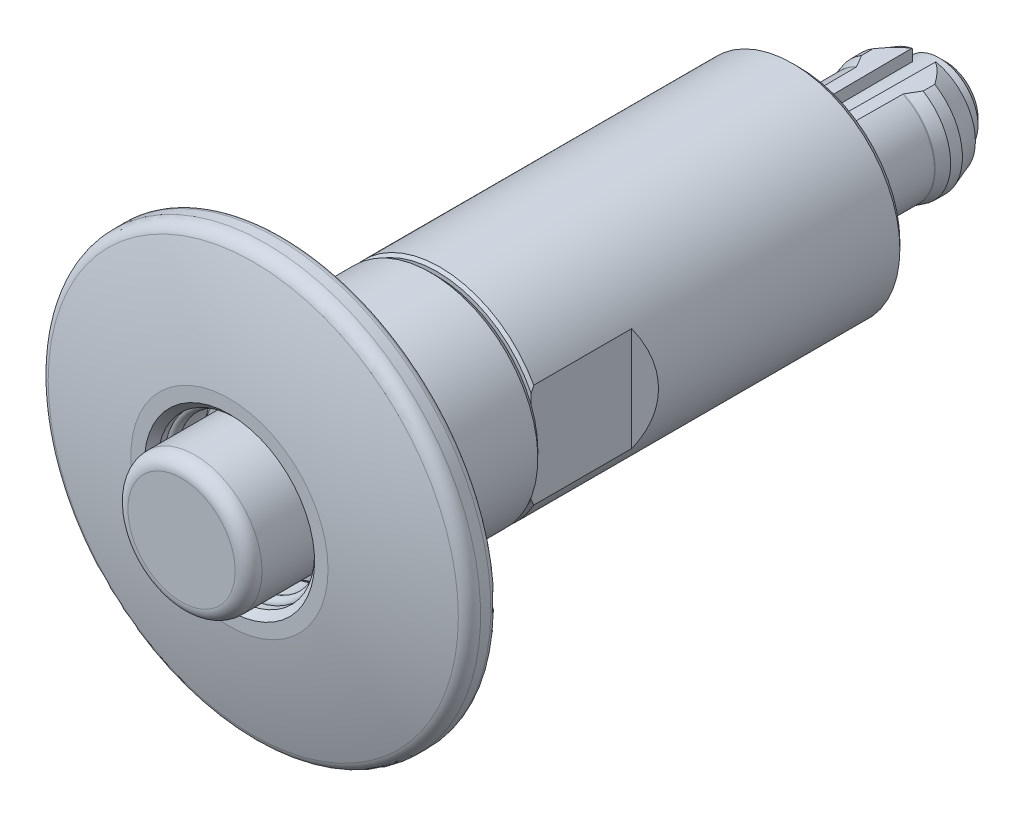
ISO-10303-21;
HEADER;
FILE_DESCRIPTION(('STEP AP214'),'2;1');
FILE_NAME('part.step','',(''),(''),'','','');
FILE_SCHEMA(('AUTOMOTIVE_DESIGN { 1 0 10303 214 1 1 1 1 }'));
ENDSEC;
DATA;
#1=APPLICATION_CONTEXT('core data for automotive mechanical design processes');
#2=APPLICATION_PROTOCOL_DEFINITION('international standard','automotive_design',2000,#1);
#3=PRODUCT_CONTEXT('',#1,'mechanical');
#4=PRODUCT('Part','Part','',(#3));
#5=PRODUCT_RELATED_PRODUCT_CATEGORY('part','',(#4));
#6=PRODUCT_DEFINITION_FORMATION('','',#4);
#7=PRODUCT_DEFINITION_CONTEXT('part definition',#1,'design');
#8=PRODUCT_DEFINITION('design','',#6,#7);
#9=PRODUCT_DEFINITION_SHAPE('','',#8);
#10=(LENGTH_UNIT() NAMED_UNIT(*) SI_UNIT(.MILLI.,.METRE.));
#11=(NAMED_UNIT(*) PLANE_ANGLE_UNIT() SI_UNIT($,.RADIAN.));
#12=(NAMED_UNIT(*) SI_UNIT($,.STERADIAN.) SOLID_ANGLE_UNIT());
#13=UNCERTAINTY_MEASURE_WITH_UNIT(LENGTH_MEASURE(1.E-05),#10,'distance_accuracy_value','');
#14=(GEOMETRIC_REPRESENTATION_CONTEXT(3) GLOBAL_UNCERTAINTY_ASSIGNED_CONTEXT((#13)) GLOBAL_UNIT_ASSIGNED_CONTEXT((#10,
#11,#12)) REPRESENTATION_CONTEXT('',''));
#15=CARTESIAN_POINT('',(0.,0.,0.));
#16=DIRECTION('',(0.,0.,1.));
#17=DIRECTION('',(1.,0.,0.));
#18=AXIS2_PLACEMENT_3D('',#15,#16,#17);
#19=CARTESIAN_POINT('',(0.,0.,46.0730839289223));
#20=DIRECTION('',(0.,0.,-1.));
#21=DIRECTION('',(0.,1.,0.));
#22=AXIS2_PLACEMENT_3D('',#19,#20,#21);
#23=PLANE('',#22);
#24=CARTESIAN_POINT('',(0.,0.,46.0730839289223));
#25=DIRECTION('',(0.,0.,-1.));
#26=DIRECTION('',(0.,1.,0.));
#27=AXIS2_PLACEMENT_3D('',#24,#25,#26);
#28=CIRCLE('',#27,4.);
#29=CARTESIAN_POINT('',(0.,4.,46.0730839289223));
#30=VERTEX_POINT('',#29);
#31=EDGE_CURVE('E376',#30,#30,#28,.F.);
#32=ORIENTED_EDGE('',*,*,#31,.T.);
#33=EDGE_LOOP('',(#32));
#34=FACE_BOUND('',#33,.T.);
#35=ADVANCED_FACE('F14',(#34),#23,.F.);
#36=CARTESIAN_POINT('',(0.,0.,45.0730839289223));
#37=DIRECTION('',(0.,0.,-1.));
#38=DIRECTION('',(0.,1.,0.));
#39=AXIS2_PLACEMENT_3D('',#36,#37,#38);
#40=TOROIDAL_SURFACE('',#39,4.,1.);
#41=CARTESIAN_POINT('',(0.,0.,45.0730839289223));
#42=DIRECTION('',(0.,0.,-1.));
#43=DIRECTION('',(0.,1.,0.));
#44=AXIS2_PLACEMENT_3D('',#41,#42,#43);
#45=CIRCLE('',#44,5.);
#46=CARTESIAN_POINT('',(0.,5.,45.0730839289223));
#47=VERTEX_POINT('',#46);
#48=EDGE_CURVE('E373',#47,#47,#45,.T.);
#49=ORIENTED_EDGE('',*,*,#48,.F.);
#50=EDGE_LOOP('',(#49));
#51=FACE_BOUND('',#50,.T.);
#52=ORIENTED_EDGE('',*,*,#31,.F.);
#53=EDGE_LOOP('',(#52));
#54=FACE_BOUND('',#53,.T.);
#55=ADVANCED_FACE('F265',(#51,#54),#40,.T.);
#56=CARTESIAN_POINT('',(0.,0.,46.0730839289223));
#57=DIRECTION('',(0.,0.,1.));
#58=DIRECTION('',(0.,-1.,0.));
#59=AXIS2_PLACEMENT_3D('',#56,#57,#58);
#60=CYLINDRICAL_SURFACE('',#59,5.);
#61=ORIENTED_EDGE('',*,*,#48,.T.);
#62=EDGE_LOOP('',(#61));
#63=FACE_BOUND('',#62,.T.);
#64=CARTESIAN_POINT('',(0.,0.,38.7730839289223));
#65=DIRECTION('',(0.,0.,-1.));
#66=DIRECTION('',(0.,1.,0.));
#67=AXIS2_PLACEMENT_3D('',#64,#65,#66);
#68=CIRCLE('',#67,5.);
#69=CARTESIAN_POINT('',(0.,5.,38.7730839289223));
#70=VERTEX_POINT('',#69);
#71=EDGE_CURVE('E370',#70,#70,#68,.T.);
#72=ORIENTED_EDGE('',*,*,#71,.F.);
#73=EDGE_LOOP('',(#72));
#74=FACE_BOUND('',#73,.T.);
#75=ADVANCED_FACE('F271',(#63,#74),#60,.T.);
#76=CARTESIAN_POINT('',(5.,0.,38.7730839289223));
#77=DIRECTION('',(0.,0.,-1.));
#78=DIRECTION('',(0.,1.,0.));
#79=AXIS2_PLACEMENT_3D('',#76,#77,#78);
#80=PLANE('',#79);
#81=CARTESIAN_POINT('',(0.,0.,38.7730839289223));
#82=DIRECTION('',(0.,0.,-1.));
#83=DIRECTION('',(0.,1.,0.));
#84=AXIS2_PLACEMENT_3D('',#81,#82,#83);
#85=CIRCLE('',#84,5.65);
#86=CARTESIAN_POINT('',(0.,5.65,38.7730839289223));
#87=VERTEX_POINT('',#86);
#88=EDGE_CURVE('E363',#87,#87,#85,.F.);
#89=ORIENTED_EDGE('',*,*,#88,.T.);
#90=EDGE_LOOP('',(#89));
#91=FACE_BOUND('',#90,.T.);
#92=ORIENTED_EDGE('',*,*,#71,.T.);
#93=EDGE_LOOP('',(#92));
#94=FACE_BOUND('',#93,.T.);
#95=ADVANCED_FACE('F400',(#91,#94),#80,.F.);
#96=CARTESIAN_POINT('',(-0.567155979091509,9.0514870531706,40.7));
#97=DIRECTION('',(-1.,0.,0.));
#98=DIRECTION('',(0.,-1.,0.));
#99=AXIS2_PLACEMENT_3D('',#96,#97,#98);
#100=PLANE('',#99);
#101=CARTESIAN_POINT('',(-0.567155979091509,6.1495096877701,40.8676653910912));
#102=CARTESIAN_POINT('',(-0.567155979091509,6.16256398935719,40.8858848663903));
#103=CARTESIAN_POINT('',(-0.567155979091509,6.17409255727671,40.9052171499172));
#104=CARTESIAN_POINT('',(-0.567155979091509,6.19375126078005,40.945558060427));
#105=CARTESIAN_POINT('',(-0.567155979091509,6.20187744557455,40.9665686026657));
#106=CARTESIAN_POINT('',(-0.567155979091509,6.21448095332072,41.0096508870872));
#107=CARTESIAN_POINT('',(-0.567155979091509,6.21895961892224,41.0317222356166));
#108=CARTESIAN_POINT('',(-0.567155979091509,6.22414019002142,41.0762979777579));
#109=CARTESIAN_POINT('',(-0.567155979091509,6.22484301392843,41.0988022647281));
#110=CARTESIAN_POINT('',(-0.567155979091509,6.22245608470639,41.1435774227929));
#111=CARTESIAN_POINT('',(-0.567155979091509,6.21937159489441,41.1658485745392));
#112=CARTESIAN_POINT('',(-0.567155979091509,6.20950822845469,41.2095578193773));
#113=CARTESIAN_POINT('',(-0.567155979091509,6.20272922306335,41.230995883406));
#114=CARTESIAN_POINT('',(-0.567155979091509,6.18567057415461,41.2724378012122));
#115=CARTESIAN_POINT('',(-0.567155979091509,6.17538991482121,41.2924412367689));
#116=CARTESIAN_POINT('',(-0.567155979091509,6.15162473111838,41.3304442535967));
#117=CARTESIAN_POINT('',(-0.567155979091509,6.13814017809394,41.3484438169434));
#118=CARTESIAN_POINT('',(-0.567155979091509,6.1083134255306,41.3819810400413));
#119=CARTESIAN_POINT('',(-0.567155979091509,6.0919637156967,41.3975120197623));
#120=CARTESIAN_POINT('',(-0.567155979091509,6.05689816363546,41.425622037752));
#121=CARTESIAN_POINT('',(-0.567155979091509,6.03818227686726,41.4382010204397));
#122=CARTESIAN_POINT('',(-0.567155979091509,5.99883428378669,41.4601048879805));
#123=CARTESIAN_POINT('',(-0.567155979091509,5.97819468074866,41.4694163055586));
#124=CARTESIAN_POINT('',(-0.567155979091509,5.93564923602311,41.4844574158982));
#125=CARTESIAN_POINT('',(-0.567155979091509,5.91374336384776,41.4901870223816));
#126=CARTESIAN_POINT('',(-0.567155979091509,5.86919437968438,41.4979236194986));
#127=CARTESIAN_POINT('',(-0.567155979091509,5.84654869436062,41.4999157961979));
#128=CARTESIAN_POINT('',(-0.567155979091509,5.80124342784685,41.5000789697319));
#129=CARTESIAN_POINT('',(-0.567155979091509,5.77858384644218,41.4982499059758));
#130=CARTESIAN_POINT('',(-0.567155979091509,5.73384277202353,41.490813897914));
#131=CARTESIAN_POINT('',(-0.567155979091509,5.71176262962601,41.4851988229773));
#132=CARTESIAN_POINT('',(-0.567155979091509,5.66885938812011,41.4703386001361));
#133=CARTESIAN_POINT('',(-0.567155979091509,5.6480362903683,41.4610934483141));
#134=CARTESIAN_POINT('',(-0.567155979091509,5.60825895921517,41.4392394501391));
#135=CARTESIAN_POINT('',(-0.567155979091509,5.5893032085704,41.4266333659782));
#136=CARTESIAN_POINT('',(-0.567155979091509,5.55378727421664,41.3984065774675));
#137=CARTESIAN_POINT('',(-0.567155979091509,5.53722704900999,41.3827859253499));
#138=CARTESIAN_POINT('',(-0.567155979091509,5.50704071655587,41.3490342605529));
#139=CARTESIAN_POINT('',(-0.567155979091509,5.4934038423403,41.330912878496));
#140=CARTESIAN_POINT('',(-0.567155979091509,5.46938444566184,41.2926282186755));
#141=CARTESIAN_POINT('',(-0.567155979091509,5.45900182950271,41.2724649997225));
#142=CARTESIAN_POINT('',(-0.567155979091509,5.4418413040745,41.2307796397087));
#143=CARTESIAN_POINT('',(-0.567155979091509,5.43504523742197,41.2092649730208));
#144=CARTESIAN_POINT('',(-0.567155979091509,5.42517775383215,41.1653979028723));
#145=CARTESIAN_POINT('',(-0.567155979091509,5.42210624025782,41.1430455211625));
#146=CARTESIAN_POINT('',(-0.567155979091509,5.41978325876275,41.0982322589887));
#147=CARTESIAN_POINT('',(-0.567155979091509,5.4205167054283,41.0757721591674));
#148=CARTESIAN_POINT('',(-0.567155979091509,5.42574709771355,41.0312947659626));
#149=CARTESIAN_POINT('',(-0.567155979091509,5.43024401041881,41.0092774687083));
#150=CARTESIAN_POINT('',(-0.567155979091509,5.44286466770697,40.9663258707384));
#151=CARTESIAN_POINT('',(-0.567155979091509,5.4509857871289,40.9453907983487));
#152=CARTESIAN_POINT('',(-0.567155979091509,5.47061762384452,40.9051756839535));
#153=CARTESIAN_POINT('',(-0.567155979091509,5.48212837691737,40.8858956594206));
#154=CARTESIAN_POINT('',(-0.567155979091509,5.50824528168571,40.8494761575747));
#155=CARTESIAN_POINT('',(-0.567155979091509,5.5228602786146,40.8323430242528));
#156=CARTESIAN_POINT('',(-0.567155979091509,5.5547464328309,40.8007584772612));
#157=CARTESIAN_POINT('',(-0.567155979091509,5.57201766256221,40.7863071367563));
#158=CARTESIAN_POINT('',(-0.567155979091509,5.60881741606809,40.7604200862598));
#159=CARTESIAN_POINT('',(-0.567155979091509,5.62835669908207,40.7489996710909));
#160=CARTESIAN_POINT('',(-0.567155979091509,5.66906877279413,40.7295840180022));
#161=CARTESIAN_POINT('',(-0.567155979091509,5.69024160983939,40.7215888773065));
#162=CARTESIAN_POINT('',(-0.567155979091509,5.73372363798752,40.7092153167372));
#163=CARTESIAN_POINT('',(-0.567155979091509,5.75603756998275,40.7048535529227));
#164=CARTESIAN_POINT('',(-0.567155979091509,5.80108008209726,40.6999295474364));
#165=CARTESIAN_POINT('',(-0.567155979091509,5.82380865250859,40.6993672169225));
#166=CARTESIAN_POINT('',(-0.567155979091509,5.86908395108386,40.702061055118));
#167=CARTESIAN_POINT('',(-0.567155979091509,5.89163022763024,40.7053248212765));
#168=CARTESIAN_POINT('',(-0.567155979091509,5.93585987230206,40.7155963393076));
#169=CARTESIAN_POINT('',(-0.567155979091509,5.95754302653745,40.7226050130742));
#170=CARTESIAN_POINT('',(-0.567155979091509,5.99940722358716,40.7401659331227));
#171=CARTESIAN_POINT('',(-0.567155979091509,6.01958909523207,40.7507162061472));
#172=CARTESIAN_POINT('',(-0.567155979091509,6.05786806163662,40.775060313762));
#173=CARTESIAN_POINT('',(-0.567155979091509,6.07596766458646,40.7888501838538));
#174=CARTESIAN_POINT('',(-0.567155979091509,6.10331891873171,40.8136115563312));
#175=CARTESIAN_POINT('',(-0.567155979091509,6.11335937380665,40.8237265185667));
#176=CARTESIAN_POINT('',(-0.567155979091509,6.13230835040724,40.844966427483));
#177=CARTESIAN_POINT('',(-0.567155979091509,6.14121687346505,40.8560913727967));
#178=CARTESIAN_POINT('',(-0.567155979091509,6.1495096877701,40.8676653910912));
#179=B_SPLINE_CURVE_WITH_KNOTS('',3,(#101,#102,#103,#104,#105,#106,#107,#108,#109,#110,#111,
#112,#113,#114,#115,#116,#117,#118,#119,#120,#121,#122,#123,#124,#125,#126,#127,#128,#129,#130,
#131,#132,#133,#134,#135,#136,#137,#138,#139,#140,#141,#142,#143,#144,#145,#146,#147,#148,#149,
#150,#151,#152,#153,#154,#155,#156,#157,#158,#159,#160,#161,#162,#163,#164,#165,#166,#167,#168,
#169,#170,#171,#172,#173,#174,#175,#176,#177,#178),.UNSPECIFIED.,.T.,.F.,(4,2,2,2,2,2,2,2,2,2,2,
2,2,2,2,2,2,2,2,2,2,2,2,2,2,2,2,2,2,2,2,2,2,2,2,2,2,2,4),(0.,0.0671886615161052,
0.134455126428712,0.201696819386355,0.268922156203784,0.336054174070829,0.403188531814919,
0.470342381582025,0.5374968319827,0.604830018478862,0.672164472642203,0.739773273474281,
0.807383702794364,0.875261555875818,0.943140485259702,1.01116565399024,1.0791908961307,
1.14716040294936,1.21512873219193,1.28284225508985,1.35055382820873,1.41791923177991,
1.48528288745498,1.55237967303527,1.61947587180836,1.68652354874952,1.75357193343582,
1.82081399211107,1.88805788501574,1.95563491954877,2.02321387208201,2.09110094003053,
2.15898642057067,2.22700692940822,2.29504419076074,2.36304360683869,2.43096023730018,
2.4736422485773,2.51632420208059),.UNSPECIFIED.);
#180=CARTESIAN_POINT('',(-0.567155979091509,5.82244227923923,41.5));
#181=VERTEX_POINT('',#180);
#182=CARTESIAN_POINT('',(-0.567155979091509,5.82244227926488,40.7));
#183=VERTEX_POINT('',#182);
#184=EDGE_CURVE('E382',#181,#183,#179,.T.);
#185=ORIENTED_EDGE('',*,*,#184,.T.);
#186=DIRECTION('',(0.,0.,1.));
#187=VECTOR('',#186,1.);
#188=CARTESIAN_POINT('',(-0.567155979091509,5.8224422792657,38.5));
#189=LINE('',#188,#187);
#190=EDGE_CURVE('E379',#183,#181,#189,.T.);
#191=ORIENTED_EDGE('',*,*,#190,.T.);
#192=EDGE_LOOP('',(#185,#191));
#193=FACE_BOUND('',#192,.T.);
#194=ADVANCED_FACE('F397',(#193),#100,.F.);
#195=CARTESIAN_POINT('',(0.,0.,41.1));
#196=DIRECTION('',(0.,0.,-1.));
#197=DIRECTION('',(0.,1.,0.));
#198=AXIS2_PLACEMENT_3D('',#195,#196,#197);
#199=TOROIDAL_SURFACE('',#198,5.85,0.4);
#200=CARTESIAN_POINT('',(0.,0.,40.7));
#201=DIRECTION('',(0.,0.,1.));
#202=DIRECTION('',(0.,-1.,0.));
#203=AXIS2_PLACEMENT_3D('',#200,#201,#202);
#204=CIRCLE('',#203,5.85);
#205=CARTESIAN_POINT('',(0.567155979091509,5.8224422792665,40.7));
#206=VERTEX_POINT('',#205);
#207=EDGE_CURVE('E649',#183,#206,#204,.T.);
#208=ORIENTED_EDGE('',*,*,#207,.F.);
#209=ORIENTED_EDGE('',*,*,#184,.F.);
#210=CARTESIAN_POINT('',(0.,0.,41.5));
#211=DIRECTION('',(0.,0.,-1.));
#212=DIRECTION('',(0.,1.,0.));
#213=AXIS2_PLACEMENT_3D('',#210,#211,#212);
#214=CIRCLE('',#213,5.85);
#215=CARTESIAN_POINT('',(0.567155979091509,5.82244227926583,41.5));
#216=VERTEX_POINT('',#215);
#217=EDGE_CURVE('E648',#216,#181,#214,.T.);
#218=ORIENTED_EDGE('',*,*,#217,.F.);
#219=CARTESIAN_POINT('',(0.567155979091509,6.1495096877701,40.8676653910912));
#220=CARTESIAN_POINT('',(0.567155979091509,6.13638075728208,40.8493452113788));
#221=CARTESIAN_POINT('',(0.567155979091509,6.1216898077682,40.8321236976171));
#222=CARTESIAN_POINT('',(0.567155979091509,6.0896095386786,40.8003807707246));
#223=CARTESIAN_POINT('',(0.567155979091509,6.07221686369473,40.7858627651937));
#224=CARTESIAN_POINT('',(0.567155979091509,6.03525294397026,40.7599583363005));
#225=CARTESIAN_POINT('',(0.567155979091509,6.01568314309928,40.7485698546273));
#226=CARTESIAN_POINT('',(0.567155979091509,5.97491945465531,40.7292318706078));
#227=CARTESIAN_POINT('',(0.567155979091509,5.95372597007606,40.7212815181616));
#228=CARTESIAN_POINT('',(0.567155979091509,5.91024029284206,40.7090132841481));
#229=CARTESIAN_POINT('',(0.567155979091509,5.88794485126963,40.7047069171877));
#230=CARTESIAN_POINT('',(0.567155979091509,5.84294671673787,40.6998863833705));
#231=CARTESIAN_POINT('',(0.567155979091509,5.82024399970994,40.6993724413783));
#232=CARTESIAN_POINT('',(0.567155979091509,5.77500786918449,40.7021541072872));
#233=CARTESIAN_POINT('',(0.567155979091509,5.75247512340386,40.7054605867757));
#234=CARTESIAN_POINT('',(0.567155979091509,5.70828406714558,40.7158086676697));
#235=CARTESIAN_POINT('',(0.567155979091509,5.68662576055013,40.7228502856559));
#236=CARTESIAN_POINT('',(0.567155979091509,5.64479681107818,40.7404744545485));
#237=CARTESIAN_POINT('',(0.567155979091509,5.62462640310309,40.7510575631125));
#238=CARTESIAN_POINT('',(0.567155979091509,5.58635556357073,40.7754693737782));
#239=CARTESIAN_POINT('',(0.567155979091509,5.56825510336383,40.789298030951));
#240=CARTESIAN_POINT('',(0.567155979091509,5.53469750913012,40.819767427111));
#241=CARTESIAN_POINT('',(0.567155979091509,5.51923273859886,40.8363997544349));
#242=CARTESIAN_POINT('',(0.567155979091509,5.4913317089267,40.8720358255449));
#243=CARTESIAN_POINT('',(0.567155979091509,5.47889537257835,40.8910395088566));
#244=CARTESIAN_POINT('',(0.567155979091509,5.45747002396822,40.9307785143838));
#245=CARTESIAN_POINT('',(0.567155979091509,5.44846428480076,40.9515048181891));
#246=CARTESIAN_POINT('',(0.567155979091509,5.43407857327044,40.9941796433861));
#247=CARTESIAN_POINT('',(0.567155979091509,5.42869849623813,41.0161281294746));
#248=CARTESIAN_POINT('',(0.567155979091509,5.42173934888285,41.0605162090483));
#249=CARTESIAN_POINT('',(0.567155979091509,5.4201429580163,41.0829530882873));
#250=CARTESIAN_POINT('',(0.567155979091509,5.42074744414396,41.1277754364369));
#251=CARTESIAN_POINT('',(0.567155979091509,5.42294826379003,41.1501609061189));
#252=CARTESIAN_POINT('',(0.567155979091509,5.43107460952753,41.1942019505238));
#253=CARTESIAN_POINT('',(0.567155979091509,5.43699323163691,41.2158587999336));
#254=CARTESIAN_POINT('',(0.567155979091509,5.4523757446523,41.2578742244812));
#255=CARTESIAN_POINT('',(0.567155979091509,5.46183965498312,41.278232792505));
#256=CARTESIAN_POINT('',(0.567155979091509,5.4840590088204,41.3171167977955));
#257=CARTESIAN_POINT('',(0.567155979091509,5.49682056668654,41.3356387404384));
#258=CARTESIAN_POINT('',(0.567155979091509,5.52525894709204,41.3702897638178));
#259=CARTESIAN_POINT('',(0.567155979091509,5.54093583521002,41.3864187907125));
#260=CARTESIAN_POINT('',(0.567155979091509,5.57483566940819,41.4159057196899));
#261=CARTESIAN_POINT('',(0.567155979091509,5.59306992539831,41.4292506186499));
#262=CARTESIAN_POINT('',(0.567155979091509,5.6315110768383,41.4527075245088));
#263=CARTESIAN_POINT('',(0.567155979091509,5.65171802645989,41.4628194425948));
#264=CARTESIAN_POINT('',(0.567155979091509,5.69363822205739,41.4795740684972));
#265=CARTESIAN_POINT('',(0.567155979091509,5.71535840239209,41.4861994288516));
#266=CARTESIAN_POINT('',(0.567155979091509,5.75960131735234,41.4957218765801));
#267=CARTESIAN_POINT('',(0.567155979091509,5.78212406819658,41.4986188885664));
#268=CARTESIAN_POINT('',(0.567155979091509,5.82740466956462,41.5006068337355));
#269=CARTESIAN_POINT('',(0.567155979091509,5.85016302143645,41.4996863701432));
#270=CARTESIAN_POINT('',(0.567155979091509,5.89520233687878,41.4940375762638));
#271=CARTESIAN_POINT('',(0.567155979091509,5.91748329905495,41.4893092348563));
#272=CARTESIAN_POINT('',(0.567155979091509,5.96093162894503,41.4761750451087));
#273=CARTESIAN_POINT('',(0.567155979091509,5.98209910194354,41.4677695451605));
#274=CARTESIAN_POINT('',(0.567155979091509,6.02271676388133,41.4475142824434));
#275=CARTESIAN_POINT('',(0.567155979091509,6.04216697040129,41.4356645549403));
#276=CARTESIAN_POINT('',(0.567155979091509,6.07873734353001,41.4088912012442));
#277=CARTESIAN_POINT('',(0.567155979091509,6.0958639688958,41.3939763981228));
#278=CARTESIAN_POINT('',(0.567155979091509,6.12735712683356,41.361472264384));
#279=CARTESIAN_POINT('',(0.567155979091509,6.1417237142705,41.3438829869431));
#280=CARTESIAN_POINT('',(0.567155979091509,6.16722517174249,41.3066076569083));
#281=CARTESIAN_POINT('',(0.567155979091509,6.17837324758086,41.2869306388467));
#282=CARTESIAN_POINT('',(0.567155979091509,6.19719263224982,41.2459797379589));
#283=CARTESIAN_POINT('',(0.567155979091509,6.20486415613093,41.2247059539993));
#284=CARTESIAN_POINT('',(0.567155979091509,6.21648422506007,41.1812541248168));
#285=CARTESIAN_POINT('',(0.567155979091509,6.22044718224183,41.1590799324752));
#286=CARTESIAN_POINT('',(0.567155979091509,6.22458648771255,41.1143748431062));
#287=CARTESIAN_POINT('',(0.567155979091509,6.22476194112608,41.0918438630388));
#288=CARTESIAN_POINT('',(0.567155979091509,6.22132290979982,41.0471099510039));
#289=CARTESIAN_POINT('',(0.567155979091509,6.21771419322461,41.0249065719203));
#290=CARTESIAN_POINT('',(0.567155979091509,6.20682182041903,40.9814401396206));
#291=CARTESIAN_POINT('',(0.567155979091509,6.19954262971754,40.9601759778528));
#292=CARTESIAN_POINT('',(0.567155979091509,6.18497526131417,40.927010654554));
#293=CARTESIAN_POINT('',(0.567155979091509,6.17874939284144,40.9146316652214));
#294=CARTESIAN_POINT('',(0.567155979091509,6.16504868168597,40.8905854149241));
#295=CARTESIAN_POINT('',(0.567155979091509,6.15757384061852,40.8789181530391));
#296=CARTESIAN_POINT('',(0.567155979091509,6.1495096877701,40.8676653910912));
#297=B_SPLINE_CURVE_WITH_KNOTS('',3,(#219,#220,#221,#222,#223,#224,#225,#226,#227,#228,#229,
#230,#231,#232,#233,#234,#235,#236,#237,#238,#239,#240,#241,#242,#243,#244,#245,#246,#247,#248,
#249,#250,#251,#252,#253,#254,#255,#256,#257,#258,#259,#260,#261,#262,#263,#264,#265,#266,#267,
#268,#269,#270,#271,#272,#273,#274,#275,#276,#277,#278,#279,#280,#281,#282,#283,#284,#285,#286,
#287,#288,#289,#290,#291,#292,#293,#294,#295,#296),.UNSPECIFIED.,.T.,.F.,(4,2,2,2,2,2,2,2,2,2,2,
2,2,2,2,2,2,2,2,2,2,2,2,2,2,2,2,2,2,2,2,2,2,2,2,2,2,2,4),(0.,0.0675656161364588,
0.13521582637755,0.202821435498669,0.270410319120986,0.338211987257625,0.406017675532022,
0.474016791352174,0.542016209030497,0.61002633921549,0.678035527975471,0.745844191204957,
0.81365112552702,0.881123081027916,0.948593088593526,1.01575363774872,1.08291317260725,
1.14994835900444,1.21698391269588,1.28414466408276,1.3513069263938,1.41877617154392,
1.48624726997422,1.55405097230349,1.621856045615,1.68986369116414,1.75787153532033,
1.82587293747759,1.89387364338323,1.96168127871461,2.02948756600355,2.09701155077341,
2.16453135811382,2.23178766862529,2.29905986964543,2.36622967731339,2.43331796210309,
2.47481868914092,2.51631936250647),.UNSPECIFIED.);
#298=EDGE_CURVE('E366',#206,#216,#297,.T.);
#299=ORIENTED_EDGE('',*,*,#298,.F.);
#300=EDGE_LOOP('',(#208,#209,#218,#299));
#301=FACE_BOUND('',#300,.T.);
#302=ADVANCED_FACE('F395',(#301),#199,.T.);
#303=CARTESIAN_POINT('',(0.567155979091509,9.0514870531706,40.7));
#304=DIRECTION('',(1.,0.,0.));
#305=DIRECTION('',(0.,1.,0.));
#306=AXIS2_PLACEMENT_3D('',#303,#304,#305);
#307=PLANE('',#306);
#308=ORIENTED_EDGE('',*,*,#298,.T.);
#309=DIRECTION('',(0.,0.,1.));
#310=VECTOR('',#309,1.);
#311=CARTESIAN_POINT('',(0.567155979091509,5.8224422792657,38.5));
#312=LINE('',#311,#310);
#313=EDGE_CURVE('E381',#216,#206,#312,.F.);
#314=ORIENTED_EDGE('',*,*,#313,.T.);
#315=EDGE_LOOP('',(#308,#314));
#316=FACE_BOUND('',#315,.T.);
#317=ADVANCED_FACE('F280',(#316),#307,.F.);
#318=CARTESIAN_POINT('',(0.,0.,38.7730839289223));
#319=DIRECTION('',(0.,0.,-1.));
#320=DIRECTION('',(0.,1.,0.));
#321=AXIS2_PLACEMENT_3D('',#318,#319,#320);
#322=CONICAL_SURFACE('',#321,5.65,0.785398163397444);
#323=CARTESIAN_POINT('',(0.,0.,38.5730839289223));
#324=DIRECTION('',(0.,0.,-1.));
#325=DIRECTION('',(0.,1.,0.));
#326=AXIS2_PLACEMENT_3D('',#323,#324,#325);
#327=CIRCLE('',#326,5.85);
#328=CARTESIAN_POINT('',(0.,5.85,38.5730839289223));
#329=VERTEX_POINT('',#328);
#330=EDGE_CURVE('E367',#329,#329,#327,.T.);
#331=ORIENTED_EDGE('',*,*,#330,.F.);
#332=EDGE_LOOP('',(#331));
#333=FACE_BOUND('',#332,.T.);
#334=ORIENTED_EDGE('',*,*,#88,.F.);
#335=EDGE_LOOP('',(#334));
#336=FACE_BOUND('',#335,.T.);
#337=ADVANCED_FACE('F220',(#333,#336),#322,.T.);
#338=CARTESIAN_POINT('',(0.,0.,38.5));
#339=DIRECTION('',(0.,0.,1.));
#340=DIRECTION('',(0.,-1.,0.));
#341=AXIS2_PLACEMENT_3D('',#338,#339,#340);
#342=CYLINDRICAL_SURFACE('',#341,5.85);
#343=CARTESIAN_POINT('',(0.,0.,42.));
#344=DIRECTION('',(0.,0.,-1.));
#345=DIRECTION('',(0.,1.,0.));
#346=AXIS2_PLACEMENT_3D('',#343,#344,#345);
#347=CIRCLE('',#346,5.85);
#348=CARTESIAN_POINT('',(0.,5.85,42.));
#349=VERTEX_POINT('',#348);
#350=EDGE_CURVE('E705',#349,#349,#347,.F.);
#351=ORIENTED_EDGE('',*,*,#350,.T.);
#352=EDGE_LOOP('',(#351));
#353=FACE_BOUND('',#352,.T.);
#354=ORIENTED_EDGE('',*,*,#330,.T.);
#355=EDGE_LOOP('',(#354));
#356=FACE_BOUND('',#355,.T.);
#357=ORIENTED_EDGE('',*,*,#313,.F.);
#358=ORIENTED_EDGE('',*,*,#217,.T.);
#359=ORIENTED_EDGE('',*,*,#190,.F.);
#360=ORIENTED_EDGE('',*,*,#207,.T.);
#361=EDGE_LOOP('',(#357,#358,#359,#360));
#362=FACE_BOUND('',#361,.T.);
#363=ADVANCED_FACE('F215',(#353,#356,#362),#342,.F.);
#364=CARTESIAN_POINT('',(0.,0.,42.));
#365=DIRECTION('',(0.,0.,1.));
#366=DIRECTION('',(0.,-1.,0.));
#367=AXIS2_PLACEMENT_3D('',#364,#365,#366);
#368=CONICAL_SURFACE('',#367,5.85,0.78539816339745);
#369=CARTESIAN_POINT('',(0.,0.,42.5));
#370=DIRECTION('',(0.,0.,-1.));
#371=DIRECTION('',(0.,1.,0.));
#372=AXIS2_PLACEMENT_3D('',#369,#370,#371);
#373=CIRCLE('',#372,6.35);
#374=CARTESIAN_POINT('',(0.,6.35,42.5));
#375=VERTEX_POINT('',#374);
#376=EDGE_CURVE('E190',#375,#375,#373,.T.);
#377=ORIENTED_EDGE('',*,*,#376,.F.);
#378=EDGE_LOOP('',(#377));
#379=FACE_BOUND('',#378,.T.);
#380=ORIENTED_EDGE('',*,*,#350,.F.);
#381=EDGE_LOOP('',(#380));
#382=FACE_BOUND('',#381,.T.);
#383=ADVANCED_FACE('F219',(#379,#382),#368,.F.);
#384=CARTESIAN_POINT('',(0.,0.,42.5));
#385=DIRECTION('',(0.,0.,-1.));
#386=DIRECTION('',(0.,1.,0.));
#387=AXIS2_PLACEMENT_3D('',#384,#385,#386);
#388=PLANE('',#387);
#389=ORIENTED_EDGE('',*,*,#376,.T.);
#390=EDGE_LOOP('',(#389));
#391=FACE_BOUND('',#390,.T.);
#392=CARTESIAN_POINT('',(0.,0.,42.5));
#393=DIRECTION('',(0.,0.,1.));
#394=DIRECTION('',(0.,-1.,0.));
#395=AXIS2_PLACEMENT_3D('',#392,#393,#394);
#396=CIRCLE('',#395,7.35465362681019);
#397=CARTESIAN_POINT('',(7.35465362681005,0.,42.5));
#398=VERTEX_POINT('',#397);
#399=EDGE_CURVE('E683',#398,#398,#396,.T.);
#400=ORIENTED_EDGE('',*,*,#399,.T.);
#401=EDGE_LOOP('',(#400));
#402=FACE_BOUND('',#401,.T.);
#403=ADVANCED_FACE('F222',(#391,#402),#388,.F.);
#404=CARTESIAN_POINT('',(0.,0.,-8.97726750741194));
#405=DIRECTION('',(0.,0.,1.));
#406=DIRECTION('',(1.,0.,0.));
#407=AXIS2_PLACEMENT_3D('',#404,#405,#406);
#408=SPHERICAL_SURFACE('',#407,52.);
#409=CARTESIAN_POINT('',(0.,0.,40.7227321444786));
#410=DIRECTION('',(0.,0.,-1.));
#411=DIRECTION('',(0.,1.,0.));
#412=AXIS2_PLACEMENT_3D('',#409,#410,#411);
#413=CIRCLE('',#412,15.2941176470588);
#414=CARTESIAN_POINT('',(15.2941176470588,0.,40.7227321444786));
#415=VERTEX_POINT('',#414);
#416=EDGE_CURVE('E699',#415,#415,#413,.F.);
#417=CARTESIAN_POINT('',(15.2941176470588,0.,40.7227321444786));
#418=CARTESIAN_POINT('',(15.213033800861,0.,40.7476839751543));
#419=CARTESIAN_POINT('',(15.1318888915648,0.,40.7724373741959));
#420=CARTESIAN_POINT('',(14.9694788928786,0.,40.82154672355));
#421=CARTESIAN_POINT('',(14.8882138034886,0.,40.8459026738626));
#422=CARTESIAN_POINT('',(14.7255653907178,0.,40.8942165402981));
#423=CARTESIAN_POINT('',(14.644182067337,0.,40.918174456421));
#424=CARTESIAN_POINT('',(14.4812991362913,0.,40.9656916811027));
#425=CARTESIAN_POINT('',(14.3997995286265,0.,40.9892509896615));
#426=CARTESIAN_POINT('',(14.2366859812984,0.,41.0359704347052));
#427=CARTESIAN_POINT('',(14.1550720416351,0.,41.0591305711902));
#428=CARTESIAN_POINT('',(13.9917317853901,0.,41.1050511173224));
#429=CARTESIAN_POINT('',(13.9100054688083,0.,41.1278115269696));
#430=CARTESIAN_POINT('',(13.7464424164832,0.,41.1729320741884));
#431=CARTESIAN_POINT('',(13.6646056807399,0.,41.19529221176));
#432=CARTESIAN_POINT('',(13.5008237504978,0.,41.2396116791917));
#433=CARTESIAN_POINT('',(13.4188785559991,0.,41.2615710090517));
#434=CARTESIAN_POINT('',(13.2548816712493,0.,41.305088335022));
#435=CARTESIAN_POINT('',(13.1728299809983,0.,41.3266463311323));
#436=CARTESIAN_POINT('',(13.0086220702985,0.,41.3693604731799));
#437=CARTESIAN_POINT('',(12.9264658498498,0.,41.3905166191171));
#438=CARTESIAN_POINT('',(12.7620508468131,0.,41.4324265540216));
#439=CARTESIAN_POINT('',(12.6797920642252,0.,41.4531803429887));
#440=CARTESIAN_POINT('',(12.5151739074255,0.,41.4942850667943));
#441=CARTESIAN_POINT('',(12.4328145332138,0.,41.5146360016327));
#442=CARTESIAN_POINT('',(12.2679971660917,0.,41.5549345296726));
#443=CARTESIAN_POINT('',(12.1855391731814,0.,41.5748821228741));
#444=CARTESIAN_POINT('',(12.0205265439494,0.,41.6143734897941));
#445=CARTESIAN_POINT('',(11.9379719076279,0.,41.6339172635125));
#446=CARTESIAN_POINT('',(11.7727679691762,0.,41.6726005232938));
#447=CARTESIAN_POINT('',(11.6901186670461,0.,41.6917400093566));
#448=CARTESIAN_POINT('',(11.5247273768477,0.,41.7296142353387));
#449=CARTESIAN_POINT('',(11.4419853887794,0.,41.7483489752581));
#450=CARTESIAN_POINT('',(11.2764107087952,0.,41.7854132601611));
#451=CARTESIAN_POINT('',(11.1935780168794,0.,41.8037428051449));
#452=CARTESIAN_POINT('',(11.0278239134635,0.,41.8399962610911));
#453=CARTESIAN_POINT('',(10.9449025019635,0.,41.8579201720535));
#454=CARTESIAN_POINT('',(10.7789729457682,0.,41.8933619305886));
#455=CARTESIAN_POINT('',(10.6959648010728,0.,41.9108797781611));
#456=CARTESIAN_POINT('',(10.5298637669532,0.,41.945508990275));
#457=CARTESIAN_POINT('',(10.4467708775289,0.,41.9626203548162));
#458=CARTESIAN_POINT('',(10.2805023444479,0.,41.9964361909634));
#459=CARTESIAN_POINT('',(10.1973267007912,0.,42.0131406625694));
#460=CARTESIAN_POINT('',(10.0308946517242,0.,42.046142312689));
#461=CARTESIAN_POINT('',(9.94763824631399,0.,42.0624394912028));
#462=CARTESIAN_POINT('',(9.78104666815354,0.,42.0946261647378));
#463=CARTESIAN_POINT('',(9.69771149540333,0.,42.1105156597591));
#464=CARTESIAN_POINT('',(9.53096437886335,0.,42.1418865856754));
#465=CARTESIAN_POINT('',(9.44755243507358,0.,42.1573680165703));
#466=CARTESIAN_POINT('',(9.28065377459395,0.,42.1879224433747));
#467=CARTESIAN_POINT('',(9.19716705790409,0.,42.2029954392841));
#468=CARTESIAN_POINT('',(9.03012085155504,0.,42.2327326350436));
#469=CARTESIAN_POINT('',(8.94656136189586,0.,42.2473968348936));
#470=CARTESIAN_POINT('',(8.77937161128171,0.,42.2763160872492));
#471=CARTESIAN_POINT('',(8.69574135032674,0.,42.2905711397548));
#472=CARTESIAN_POINT('',(8.52841206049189,0.,42.3186717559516));
#473=CARTESIAN_POINT('',(8.444713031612,0.,42.3325173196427));
#474=CARTESIAN_POINT('',(8.27724821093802,0.,42.3597986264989));
#475=CARTESIAN_POINT('',(8.19348241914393,0.,42.3732343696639));
#476=CARTESIAN_POINT('',(8.02588607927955,0.,42.399695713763));
#477=CARTESIAN_POINT('',(7.94205553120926,0.,42.4127213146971));
#478=CARTESIAN_POINT('',(7.77433168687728,0.,42.4383620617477));
#479=CARTESIAN_POINT('',(7.69043839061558,0.,42.4509772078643));
#480=CARTESIAN_POINT('',(7.52259105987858,0.,42.4757967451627));
#481=CARTESIAN_POINT('',(7.43863702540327,0.,42.4880011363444));
#482=CARTESIAN_POINT('',(7.35465362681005,0.,42.5));
#483=B_SPLINE_CURVE_WITH_KNOTS('',3,(#417,#418,#419,#420,#421,#422,#423,#424,#425,#426,#427,
#428,#429,#430,#431,#432,#433,#434,#435,#436,#437,#438,#439,#440,#441,#442,#443,#444,#445,#446,
#447,#448,#449,#450,#451,#452,#453,#454,#455,#456,#457,#458,#459,#460,#461,#462,#463,#464,#465,
#466,#467,#468,#469,#470,#471,#472,#473,#474,#475,#476,#477,#478,#479,#480,#481,#482),
.UNSPECIFIED.,.F.,.F.,(4,2,2,2,2,2,2,2,2,2,2,2,2,2,2,2,2,2,2,2,2,2,2,2,2,2,2,2,2,2,2,2,4),(0.,
0.254508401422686,0.509016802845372,0.763525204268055,1.01803360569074,1.27254200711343,
1.52705040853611,1.7815588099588,2.03606721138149,2.29057561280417,2.54508401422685,
2.79959241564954,3.05410081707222,3.30860921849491,3.56311761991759,3.81762602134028,
4.07213442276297,4.32664282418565,4.58115122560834,4.83565962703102,5.09016802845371,
5.34467642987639,5.59918483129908,5.85369323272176,6.10820163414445,6.36271003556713,
6.61721843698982,6.8717268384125,7.12623523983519,7.38074364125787,7.63525204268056,
7.88976044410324,8.14426884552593),.UNSPECIFIED.);
#484=EDGE_CURVE('BSEAM225',#415,#398,#483,.T.);
#485=ORIENTED_EDGE('',*,*,#416,.T.);
#486=ORIENTED_EDGE('',*,*,#399,.F.);
#487=ORIENTED_EDGE('',*,*,#484,.T.);
#488=ORIENTED_EDGE('',*,*,#484,.F.);
#489=EDGE_LOOP('',(#485,#487,#486,#488));
#490=FACE_BOUND('',#489,.T.);
#491=ADVANCED_FACE('F225',(#490),#408,.T.);
#492=CARTESIAN_POINT('',(0.,0.,39.7669629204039));
#493=DIRECTION('',(0.,0.,-1.));
#494=DIRECTION('',(0.,1.,0.));
#495=AXIS2_PLACEMENT_3D('',#492,#493,#494);
#496=TOROIDAL_SURFACE('',#495,15.,1.);
#497=CARTESIAN_POINT('',(0.,0.,39.7669629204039));
#498=DIRECTION('',(0.,0.,-1.));
#499=DIRECTION('',(0.,1.,0.));
#500=AXIS2_PLACEMENT_3D('',#497,#498,#499);
#501=CIRCLE('',#500,16.);
#502=CARTESIAN_POINT('',(0.,16.,39.7669629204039));
#503=VERTEX_POINT('',#502);
#504=EDGE_CURVE('E702',#503,#503,#501,.T.);
#505=ORIENTED_EDGE('',*,*,#504,.F.);
#506=EDGE_LOOP('',(#505));
#507=FACE_BOUND('',#506,.T.);
#508=ORIENTED_EDGE('',*,*,#416,.F.);
#509=EDGE_LOOP('',(#508));
#510=FACE_BOUND('',#509,.T.);
#511=ADVANCED_FACE('F229',(#507,#510),#496,.T.);
#512=CARTESIAN_POINT('',(0.,0.,41.2941358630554));
#513=DIRECTION('',(0.,0.,1.));
#514=DIRECTION('',(0.,-1.,0.));
#515=AXIS2_PLACEMENT_3D('',#512,#513,#514);
#516=CYLINDRICAL_SURFACE('',#515,16.);
#517=ORIENTED_EDGE('',*,*,#504,.T.);
#518=EDGE_LOOP('',(#517));
#519=FACE_BOUND('',#518,.T.);
#520=CARTESIAN_POINT('',(0.,0.,39.));
#521=DIRECTION('',(0.,0.,1.));
#522=DIRECTION('',(0.,-1.,0.));
#523=AXIS2_PLACEMENT_3D('',#520,#521,#522);
#524=CIRCLE('',#523,16.);
#525=CARTESIAN_POINT('',(0.,-16.,39.));
#526=VERTEX_POINT('',#525);
#527=EDGE_CURVE('E693',#526,#526,#524,.T.);
#528=ORIENTED_EDGE('',*,*,#527,.T.);
#529=EDGE_LOOP('',(#528));
#530=FACE_BOUND('',#529,.T.);
#531=ADVANCED_FACE('F231',(#519,#530),#516,.T.);
#532=CARTESIAN_POINT('',(0.,0.,39.));
#533=DIRECTION('',(0.,0.,1.));
#534=DIRECTION('',(0.,-1.,0.));
#535=AXIS2_PLACEMENT_3D('',#532,#533,#534);
#536=TOROIDAL_SURFACE('',#535,15.5,0.5);
#537=CARTESIAN_POINT('',(0.,0.,38.5));
#538=DIRECTION('',(0.,0.,1.));
#539=DIRECTION('',(0.,-1.,0.));
#540=AXIS2_PLACEMENT_3D('',#537,#538,#539);
#541=CIRCLE('',#540,15.5);
#542=CARTESIAN_POINT('',(0.,-15.5,38.5));
#543=VERTEX_POINT('',#542);
#544=EDGE_CURVE('E696',#543,#543,#541,.F.);
#545=ORIENTED_EDGE('',*,*,#544,.F.);
#546=EDGE_LOOP('',(#545));
#547=FACE_BOUND('',#546,.T.);
#548=ORIENTED_EDGE('',*,*,#527,.F.);
#549=EDGE_LOOP('',(#548));
#550=FACE_BOUND('',#549,.T.);
#551=ADVANCED_FACE('F234',(#547,#550),#536,.T.);
#552=CARTESIAN_POINT('',(8.,0.,38.5));
#553=DIRECTION('',(0.,0.,1.));
#554=DIRECTION('',(0.,-1.,0.));
#555=AXIS2_PLACEMENT_3D('',#552,#553,#554);
#556=PLANE('',#555);
#557=ORIENTED_EDGE('',*,*,#544,.T.);
#558=EDGE_LOOP('',(#557));
#559=FACE_BOUND('',#558,.T.);
#560=CARTESIAN_POINT('',(0.,0.,38.5));
#561=DIRECTION('',(0.,0.,1.));
#562=DIRECTION('',(0.,-1.,0.));
#563=AXIS2_PLACEMENT_3D('',#560,#561,#562);
#564=CIRCLE('',#563,11.);
#565=CARTESIAN_POINT('',(0.,-11.,38.5));
#566=VERTEX_POINT('',#565);
#567=EDGE_CURVE('E687',#566,#566,#564,.T.);
#568=ORIENTED_EDGE('',*,*,#567,.T.);
#569=EDGE_LOOP('',(#568));
#570=FACE_BOUND('',#569,.T.);
#571=ADVANCED_FACE('F236',(#559,#570),#556,.F.);
#572=CARTESIAN_POINT('',(0.,0.,35.5));
#573=DIRECTION('',(0.,0.,1.));
#574=DIRECTION('',(0.,-1.,0.));
#575=AXIS2_PLACEMENT_3D('',#572,#573,#574);
#576=TOROIDAL_SURFACE('',#575,11.,3.);
#577=CARTESIAN_POINT('',(0.,0.,35.5));
#578=DIRECTION('',(0.,0.,1.));
#579=DIRECTION('',(0.,-1.,0.));
#580=AXIS2_PLACEMENT_3D('',#577,#578,#579);
#581=CIRCLE('',#580,8.);
#582=CARTESIAN_POINT('',(0.,-8.,35.5));
#583=VERTEX_POINT('',#582);
#584=EDGE_CURVE('E690',#583,#583,#581,.F.);
#585=ORIENTED_EDGE('',*,*,#584,.F.);
#586=EDGE_LOOP('',(#585));
#587=FACE_BOUND('',#586,.T.);
#588=ORIENTED_EDGE('',*,*,#567,.F.);
#589=EDGE_LOOP('',(#588));
#590=FACE_BOUND('',#589,.T.);
#591=ADVANCED_FACE('F239',(#587,#590),#576,.F.);
#592=CARTESIAN_POINT('',(-16.,-8.,31.5));
#593=DIRECTION('',(0.,0.70710678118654,0.707106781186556));
#594=DIRECTION('',(0.,-0.707106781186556,0.70710678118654));
#595=AXIS2_PLACEMENT_3D('',#592,#593,#594);
#596=PLANE('',#595);
#597=CARTESIAN_POINT('',(0.,0.,23.5));
#598=DIRECTION('',(0.,0.70710678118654,0.707106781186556));
#599=DIRECTION('',(0.,-0.707106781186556,0.70710678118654));
#600=AXIS2_PLACEMENT_3D('',#597,#598,#599);
#601=ELLIPSE('',#600,11.3137084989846,8.);
#602=CARTESIAN_POINT('',(-3.87298334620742,-7.,30.5));
#603=VERTEX_POINT('',#602);
#604=CARTESIAN_POINT('',(3.87298334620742,-7.,30.5));
#605=VERTEX_POINT('',#604);
#606=EDGE_CURVE('E189',#603,#605,#601,.T.);
#607=ORIENTED_EDGE('',*,*,#606,.F.);
#608=DIRECTION('',(1.,0.,0.));
#609=VECTOR('',#608,1.);
#610=CARTESIAN_POINT('',(-16.,-7.,30.5));
#611=LINE('',#610,#609);
#612=EDGE_CURVE('E682',#603,#605,#611,.T.);
#613=ORIENTED_EDGE('',*,*,#612,.T.);
#614=EDGE_LOOP('',(#607,#613));
#615=FACE_BOUND('',#614,.T.);
#616=ADVANCED_FACE('F213',(#615),#596,.F.);
#617=CARTESIAN_POINT('',(0.,0.,41.2941358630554));
#618=DIRECTION('',(0.,0.,1.));
#619=DIRECTION('',(0.,-1.,0.));
#620=AXIS2_PLACEMENT_3D('',#617,#618,#619);
#621=CYLINDRICAL_SURFACE('',#620,8.);
#622=ORIENTED_EDGE('',*,*,#584,.T.);
#623=EDGE_LOOP('',(#622));
#624=FACE_BOUND('',#623,.T.);
#625=DIRECTION('',(0.,0.,1.));
#626=VECTOR('',#625,1.);
#627=CARTESIAN_POINT('',(3.87298334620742,-7.,41.2941358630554));
#628=LINE('',#627,#626);
#629=CARTESIAN_POINT('',(3.87298334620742,-7.,27.5));
#630=VERTEX_POINT('',#629);
#631=EDGE_CURVE('E174',#605,#630,#628,.F.);
#632=ORIENTED_EDGE('',*,*,#631,.T.);
#633=CARTESIAN_POINT('',(0.,0.,27.5));
#634=DIRECTION('',(0.,0.,1.));
#635=DIRECTION('',(0.,-1.,0.));
#636=AXIS2_PLACEMENT_3D('',#633,#634,#635);
#637=CIRCLE('',#636,8.);
#638=CARTESIAN_POINT('',(-3.87298334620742,-7.,27.5));
#639=VERTEX_POINT('',#638);
#640=EDGE_CURVE('E182',#630,#639,#637,.T.);
#641=ORIENTED_EDGE('',*,*,#640,.T.);
#642=DIRECTION('',(0.,0.,1.));
#643=VECTOR('',#642,1.);
#644=CARTESIAN_POINT('',(-3.87298334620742,-7.,41.2941358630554));
#645=LINE('',#644,#643);
#646=EDGE_CURVE('E193',#639,#603,#645,.T.);
#647=ORIENTED_EDGE('',*,*,#646,.T.);
#648=ORIENTED_EDGE('',*,*,#606,.T.);
#649=EDGE_LOOP('',(#632,#641,#647,#648));
#650=FACE_BOUND('',#649,.T.);
#651=ADVANCED_FACE('F187',(#624,#650),#621,.T.);
#652=CARTESIAN_POINT('',(0.,0.,27.5));
#653=DIRECTION('',(0.,0.,1.));
#654=DIRECTION('',(0.,-1.,0.));
#655=AXIS2_PLACEMENT_3D('',#652,#653,#654);
#656=CONICAL_SURFACE('',#655,8.,0.785398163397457);
#657=CARTESIAN_POINT('',(2.69258240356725,-7.,27.));
#658=CARTESIAN_POINT('',(2.79321704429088,-7.,27.0361304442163));
#659=CARTESIAN_POINT('',(2.89328440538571,-7.,27.0738186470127));
#660=CARTESIAN_POINT('',(3.09222676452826,-7.,27.1520259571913));
#661=CARTESIAN_POINT('',(3.19110255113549,-7.,27.1925430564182));
#662=CARTESIAN_POINT('',(3.38773807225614,-7.,27.2761719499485));
#663=CARTESIAN_POINT('',(3.48549788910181,-7.,27.3192835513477));
#664=CARTESIAN_POINT('',(3.68000814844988,-7.,27.4079055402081));
#665=CARTESIAN_POINT('',(3.77675783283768,-7.,27.4534175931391));
#666=CARTESIAN_POINT('',(3.87298334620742,-7.,27.5));
#667=B_SPLINE_CURVE_WITH_KNOTS('',3,(#657,#658,#659,#660,#661,#662,#663,#664,#665,#666),
.UNSPECIFIED.,.F.,.F.,(4,2,2,2,4),(0.,0.320748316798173,0.641271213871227,0.961770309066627,
1.28249477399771),.UNSPECIFIED.);
#668=CARTESIAN_POINT('',(2.69258240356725,-7.,27.));
#669=VERTEX_POINT('',#668);
#670=EDGE_CURVE('E169',#669,#630,#667,.T.);
#671=ORIENTED_EDGE('',*,*,#670,.F.);
#672=CARTESIAN_POINT('',(0.,0.,27.));
#673=DIRECTION('',(0.,0.,1.));
#674=DIRECTION('',(0.,-1.,0.));
#675=AXIS2_PLACEMENT_3D('',#672,#673,#674);
#676=CIRCLE('',#675,7.5);
#677=CARTESIAN_POINT('',(7.,-2.69258240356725,27.));
#678=VERTEX_POINT('',#677);
#679=EDGE_CURVE('E659',#678,#669,#676,.F.);
#680=ORIENTED_EDGE('',*,*,#679,.F.);
#681=CARTESIAN_POINT('',(7.,2.69258240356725,27.));
#682=VERTEX_POINT('',#681);
#683=EDGE_CURVE('E662',#682,#678,#676,.F.);
#684=ORIENTED_EDGE('',*,*,#683,.F.);
#685=CARTESIAN_POINT('',(-7.,2.69258240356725,27.));
#686=VERTEX_POINT('',#685);
#687=EDGE_CURVE('E654',#686,#682,#676,.F.);
#688=ORIENTED_EDGE('',*,*,#687,.F.);
#689=CARTESIAN_POINT('',(-7.,-2.69258240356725,27.));
#690=VERTEX_POINT('',#689);
#691=EDGE_CURVE('E655',#690,#686,#676,.F.);
#692=ORIENTED_EDGE('',*,*,#691,.F.);
#693=CARTESIAN_POINT('',(-2.69258240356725,-7.,27.));
#694=VERTEX_POINT('',#693);
#695=EDGE_CURVE('E378',#694,#690,#676,.F.);
#696=ORIENTED_EDGE('',*,*,#695,.F.);
#697=CARTESIAN_POINT('',(-3.87298334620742,-7.,27.5));
#698=CARTESIAN_POINT('',(-3.77675783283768,-7.,27.4534175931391));
#699=CARTESIAN_POINT('',(-3.68000814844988,-7.,27.4079055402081));
#700=CARTESIAN_POINT('',(-3.48549788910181,-7.,27.3192835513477));
#701=CARTESIAN_POINT('',(-3.38773807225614,-7.,27.2761719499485));
#702=CARTESIAN_POINT('',(-3.19110255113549,-7.,27.1925430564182));
#703=CARTESIAN_POINT('',(-3.09222676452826,-7.,27.1520259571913));
#704=CARTESIAN_POINT('',(-2.89328440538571,-7.,27.0738186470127));
#705=CARTESIAN_POINT('',(-2.79321704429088,-7.,27.0361304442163));
#706=CARTESIAN_POINT('',(-2.69258240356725,-7.,27.));
#707=B_SPLINE_CURVE_WITH_KNOTS('',3,(#697,#698,#699,#700,#701,#702,#703,#704,#705,#706),
.UNSPECIFIED.,.F.,.F.,(4,2,2,2,4),(0.,0.320724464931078,0.641223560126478,0.961746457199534,
1.28249477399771),.UNSPECIFIED.);
#708=EDGE_CURVE('E181',#639,#694,#707,.T.);
#709=ORIENTED_EDGE('',*,*,#708,.F.);
#710=ORIENTED_EDGE('',*,*,#640,.F.);
#711=EDGE_LOOP('',(#671,#680,#684,#688,#692,#696,#709,#710));
#712=FACE_BOUND('',#711,.T.);
#713=ADVANCED_FACE('F16',(#712),#656,.T.);
#714=CARTESIAN_POINT('',(-16.,-7.,30.5));
#715=DIRECTION('',(0.,1.,0.));
#716=DIRECTION('',(-1.,0.,0.));
#717=AXIS2_PLACEMENT_3D('',#714,#715,#716);
#718=PLANE('',#717);
#719=ORIENTED_EDGE('',*,*,#646,.F.);
#720=ORIENTED_EDGE('',*,*,#708,.T.);
#721=DIRECTION('',(1.,0.,0.));
#722=VECTOR('',#721,1.);
#723=CARTESIAN_POINT('',(-16.,-7.,27.));
#724=LINE('',#723,#722);
#725=EDGE_CURVE('E177',#694,#669,#724,.T.);
#726=ORIENTED_EDGE('',*,*,#725,.T.);
#727=ORIENTED_EDGE('',*,*,#670,.T.);
#728=ORIENTED_EDGE('',*,*,#631,.F.);
#729=ORIENTED_EDGE('',*,*,#612,.F.);
#730=EDGE_LOOP('',(#719,#720,#726,#727,#728,#729));
#731=FACE_BOUND('',#730,.T.);
#732=ADVANCED_FACE('F172',(#731),#718,.F.);
#733=CARTESIAN_POINT('',(6.,0.,27.));
#734=DIRECTION('',(0.,0.,1.));
#735=DIRECTION('',(0.,-1.,0.));
#736=AXIS2_PLACEMENT_3D('',#733,#734,#735);
#737=PLANE('',#736);
#738=ORIENTED_EDGE('',*,*,#683,.T.);
#739=DIRECTION('',(0.,1.,0.));
#740=VECTOR('',#739,1.);
#741=CARTESIAN_POINT('',(7.,-8.,27.));
#742=LINE('',#741,#740);
#743=EDGE_CURVE('E349',#678,#682,#742,.T.);
#744=ORIENTED_EDGE('',*,*,#743,.T.);
#745=EDGE_LOOP('',(#738,#744));
#746=FACE_BOUND('',#745,.T.);
#747=ADVANCED_FACE('F212',(#746),#737,.F.);
#748=CARTESIAN_POINT('',(0.,0.,27.));
#749=DIRECTION('',(0.,0.,1.));
#750=DIRECTION('',(1.,0.,0.));
#751=AXIS2_PLACEMENT_3D('',#748,#749,#750);
#752=PLANE('',#751);
#753=DIRECTION('',(0.,1.,0.));
#754=VECTOR('',#753,1.);
#755=CARTESIAN_POINT('',(-7.,-8.,27.));
#756=LINE('',#755,#754);
#757=CARTESIAN_POINT('',(-7.,3.44093010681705,27.));
#758=VERTEX_POINT('',#757);
#759=EDGE_CURVE('E360',#686,#758,#756,.T.);
#760=ORIENTED_EDGE('',*,*,#759,.F.);
#761=ORIENTED_EDGE('',*,*,#687,.T.);
#762=CARTESIAN_POINT('',(7.,3.44093010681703,27.));
#763=VERTEX_POINT('',#762);
#764=EDGE_CURVE('E345',#682,#763,#742,.T.);
#765=ORIENTED_EDGE('',*,*,#764,.T.);
#766=CARTESIAN_POINT('',(0.,0.,27.));
#767=DIRECTION('',(0.,0.,1.));
#768=DIRECTION('',(1.,0.,0.));
#769=AXIS2_PLACEMENT_3D('',#766,#767,#768);
#770=CIRCLE('',#769,7.8);
#771=EDGE_CURVE('E331',#763,#758,#770,.T.);
#772=ORIENTED_EDGE('',*,*,#771,.T.);
#773=EDGE_LOOP('',(#760,#761,#765,#772));
#774=FACE_BOUND('',#773,.T.);
#775=ADVANCED_FACE('F246',(#774),#752,.T.);
#776=ORIENTED_EDGE('',*,*,#691,.T.);
#777=EDGE_CURVE('E359',#690,#686,#756,.T.);
#778=ORIENTED_EDGE('',*,*,#777,.F.);
#779=EDGE_LOOP('',(#776,#778));
#780=FACE_BOUND('',#779,.T.);
#781=ADVANCED_FACE('F248',(#780),#737,.F.);
#782=ORIENTED_EDGE('',*,*,#725,.F.);
#783=ORIENTED_EDGE('',*,*,#695,.T.);
#784=CARTESIAN_POINT('',(-7.,-3.44093010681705,27.));
#785=VERTEX_POINT('',#784);
#786=EDGE_CURVE('E356',#785,#690,#756,.T.);
#787=ORIENTED_EDGE('',*,*,#786,.F.);
#788=CARTESIAN_POINT('',(7.,-3.44093010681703,27.));
#789=VERTEX_POINT('',#788);
#790=EDGE_CURVE('E334',#785,#789,#770,.T.);
#791=ORIENTED_EDGE('',*,*,#790,.T.);
#792=EDGE_CURVE('E341',#789,#678,#742,.T.);
#793=ORIENTED_EDGE('',*,*,#792,.T.);
#794=ORIENTED_EDGE('',*,*,#679,.T.);
#795=EDGE_LOOP('',(#782,#783,#787,#791,#793,#794));
#796=FACE_BOUND('',#795,.T.);
#797=ADVANCED_FACE('F835',(#796),#752,.T.);
#798=CARTESIAN_POINT('',(0.,0.,27.));
#799=DIRECTION('',(0.,0.,-1.));
#800=DIRECTION('',(-1.,0.,0.));
#801=AXIS2_PLACEMENT_3D('',#798,#799,#800);
#802=CONICAL_SURFACE('',#801,7.8,0.785398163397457);
#803=CARTESIAN_POINT('',(-7.,-16.1491002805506,17.1990500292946));
#804=CARTESIAN_POINT('',(-7.,-15.910664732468,17.4178136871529));
#805=CARTESIAN_POINT('',(-7.,-15.6718519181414,17.6361660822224));
#806=CARTESIAN_POINT('',(-7.,-15.1933621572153,18.0719257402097));
#807=CARTESIAN_POINT('',(-7.,-14.9536852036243,18.2893329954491));
#808=CARTESIAN_POINT('',(-7.,-14.2330890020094,18.9400476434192));
#809=CARTESIAN_POINT('',(-7.,-13.7507140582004,19.3717471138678));
#810=CARTESIAN_POINT('',(-7.,-12.7777912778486,20.2322266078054));
#811=CARTESIAN_POINT('',(-7.,-12.2872107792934,20.6609697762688));
#812=CARTESIAN_POINT('',(-7.,-11.299301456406,21.5105129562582));
#813=CARTESIAN_POINT('',(-7.,-10.8019734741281,21.9313139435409));
#814=CARTESIAN_POINT('',(-7.,-9.88466573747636,22.6900013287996));
#815=CARTESIAN_POINT('',(-7.,-9.4661579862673,23.0296584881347));
#816=CARTESIAN_POINT('',(-7.,-8.83196826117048,23.5311476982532));
#817=CARTESIAN_POINT('',(-7.,-8.61946769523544,23.6970025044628));
#818=CARTESIAN_POINT('',(-7.,-8.19199476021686,24.0254914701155));
#819=CARTESIAN_POINT('',(-7.,-7.97702245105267,24.1881257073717));
#820=CARTESIAN_POINT('',(-7.,-7.54444306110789,24.5093411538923));
#821=CARTESIAN_POINT('',(-7.,-7.32683924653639,24.6679267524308));
#822=CARTESIAN_POINT('',(-7.,-6.88828405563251,24.9803883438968));
#823=CARTESIAN_POINT('',(-7.,-6.66733285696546,25.1342645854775));
#824=CARTESIAN_POINT('',(-7.,-6.22159117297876,25.436169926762));
#825=CARTESIAN_POINT('',(-7.,-5.99680232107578,25.5842014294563));
#826=CARTESIAN_POINT('',(-7.,-5.54265672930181,25.873055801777));
#827=CARTESIAN_POINT('',(-7.,-5.31330055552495,26.0138795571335));
#828=CARTESIAN_POINT('',(-7.,-4.85210415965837,26.2848069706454));
#829=CARTESIAN_POINT('',(-7.,-4.62032934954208,26.4150213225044));
#830=CARTESIAN_POINT('',(-7.,-4.15078506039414,26.6643113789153));
#831=CARTESIAN_POINT('',(-7.,-3.91301496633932,26.7833859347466));
#832=CARTESIAN_POINT('',(-7.,-3.43111528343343,27.0072418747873));
#833=CARTESIAN_POINT('',(-7.,-3.18699350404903,27.1120399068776));
#834=CARTESIAN_POINT('',(-7.,-2.69178793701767,27.3037554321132));
#835=CARTESIAN_POINT('',(-7.,-2.44070617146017,27.390678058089));
#836=CARTESIAN_POINT('',(-7.,-1.98425724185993,27.5267542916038));
#837=CARTESIAN_POINT('',(-7.,-1.78011684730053,27.5799992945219));
#838=CARTESIAN_POINT('',(-7.,-1.36827090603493,27.6703545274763));
#839=CARTESIAN_POINT('',(-7.,-1.16056585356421,27.707466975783));
#840=CARTESIAN_POINT('',(-7.,-0.743261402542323,27.7636775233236));
#841=CARTESIAN_POINT('',(-7.,-0.533668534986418,27.7828234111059));
#842=CARTESIAN_POINT('',(-7.,-0.113600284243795,27.8022218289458));
#843=CARTESIAN_POINT('',(-7.,0.0968750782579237,27.8024747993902));
#844=CARTESIAN_POINT('',(-7.,0.516997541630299,27.7840731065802));
#845=CARTESIAN_POINT('',(-7.,0.726644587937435,27.765417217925));
#846=CARTESIAN_POINT('',(-7.,1.14355176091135,27.7102196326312));
#847=CARTESIAN_POINT('',(-7.,1.3508116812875,27.6736764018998));
#848=CARTESIAN_POINT('',(-7.,1.76239710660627,27.584354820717));
#849=CARTESIAN_POINT('',(-7.,1.96671214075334,27.5315288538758));
#850=CARTESIAN_POINT('',(-7.,2.37113295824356,27.4118378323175));
#851=CARTESIAN_POINT('',(-7.,2.57123876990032,27.3449728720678));
#852=CARTESIAN_POINT('',(-7.,3.01233559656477,27.1827175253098));
#853=CARTESIAN_POINT('',(-7.,3.25220684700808,27.0843008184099));
#854=CARTESIAN_POINT('',(-7.,3.7256075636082,26.8731324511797));
#855=CARTESIAN_POINT('',(-7.,3.95913387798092,26.760373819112));
#856=CARTESIAN_POINT('',(-7.,4.42075343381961,26.5232996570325));
#857=CARTESIAN_POINT('',(-7.,4.64883566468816,26.3989628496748));
#858=CARTESIAN_POINT('',(-7.,5.09977176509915,26.1412790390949));
#859=CARTESIAN_POINT('',(-7.,5.32262642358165,26.0079334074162));
#860=CARTESIAN_POINT('',(-7.,5.76638893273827,25.7324401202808));
#861=CARTESIAN_POINT('',(-7.,5.9872443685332,25.5902084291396));
#862=CARTESIAN_POINT('',(-7.,6.42500287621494,25.2997974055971));
#863=CARTESIAN_POINT('',(-7.,6.64190583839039,25.1516179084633));
#864=CARTESIAN_POINT('',(-7.,7.07208180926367,24.8505899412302));
#865=CARTESIAN_POINT('',(-7.,7.28535855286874,24.6977467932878));
#866=CARTESIAN_POINT('',(-7.,7.7090102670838,24.3880850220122));
#867=CARTESIAN_POINT('',(-7.,7.91938513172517,24.2312662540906));
#868=CARTESIAN_POINT('',(-7.,8.48693321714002,23.8012199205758));
#869=CARTESIAN_POINT('',(-7.,8.84169261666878,23.5248077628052));
#870=CARTESIAN_POINT('',(-7.,9.5455128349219,22.9648195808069));
#871=CARTESIAN_POINT('',(-7.,9.89457333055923,22.6812431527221));
#872=CARTESIAN_POINT('',(-7.,10.5883827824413,22.1084466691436));
#873=CARTESIAN_POINT('',(-7.,10.9331289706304,21.819223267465));
#874=CARTESIAN_POINT('',(-7.,11.6189940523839,21.2365070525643));
#875=CARTESIAN_POINT('',(-7.,11.9601128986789,20.9430141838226));
#876=CARTESIAN_POINT('',(-7.,12.6250404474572,20.3651192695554));
#877=CARTESIAN_POINT('',(-7.,12.9489712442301,20.080857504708));
#878=CARTESIAN_POINT('',(-7.,13.5945927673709,19.5097974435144));
#879=CARTESIAN_POINT('',(-7.,13.9162834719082,19.2229991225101));
#880=CARTESIAN_POINT('',(-7.,14.5574026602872,18.6476642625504));
#881=CARTESIAN_POINT('',(-7.,14.8768334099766,18.3591302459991));
#882=CARTESIAN_POINT('',(-7.,15.5140949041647,17.7803179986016));
#883=CARTESIAN_POINT('',(-7.,15.8319256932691,17.4900398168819));
#884=CARTESIAN_POINT('',(-7.,16.1491002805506,17.1990500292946));
#885=B_SPLINE_CURVE_WITH_KNOTS('',3,(#803,#804,#805,#806,#807,#808,#809,#810,#811,#812,#813,
#814,#815,#816,#817,#818,#819,#820,#821,#822,#823,#824,#825,#826,#827,#828,#829,#830,#831,#832,
#833,#834,#835,#836,#837,#838,#839,#840,#841,#842,#843,#844,#845,#846,#847,#848,#849,#850,#851,
#852,#853,#854,#855,#856,#857,#858,#859,#860,#861,#862,#863,#864,#865,#866,#867,#868,#869,#870,
#871,#872,#873,#874,#875,#876,#877,#878,#879,#880,#881,#882,#883,#884),.UNSPECIFIED.,.F.,.F.,(4,
2,2,2,2,2,2,2,2,2,2,2,2,2,2,2,2,2,2,2,2,2,2,2,2,2,2,2,2,2,2,2,2,2,2,2,2,2,2,2,4),(0.,
0.970762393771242,1.94153265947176,3.88352000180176,5.83804798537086,7.79233425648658,
9.40917550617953,10.2178408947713,11.0264867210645,11.8342150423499,12.6419006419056,
13.4492506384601,14.2565011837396,15.0538067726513,15.8511944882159,16.647644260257,
17.4438650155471,18.076215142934,18.7084782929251,19.3390549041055,19.9696168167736,
20.6002195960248,21.2308764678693,21.8633953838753,22.4959100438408,23.2731299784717,
24.0507291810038,24.8297867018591,25.6087258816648,26.3966837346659,27.184663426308,
27.9717752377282,28.7589157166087,30.1079698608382,31.4571002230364,32.8070558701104,
34.1570290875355,35.4499260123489,36.7428355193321,38.034180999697,39.3254902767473),.UNSPECIFIED.);
#886=CARTESIAN_POINT('',(-7.,-3.87298334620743,26.8));
#887=VERTEX_POINT('',#886);
#888=EDGE_CURVE('E305',#887,#785,#885,.T.);
#889=ORIENTED_EDGE('',*,*,#888,.F.);
#890=CARTESIAN_POINT('',(0.,0.,26.8));
#891=DIRECTION('',(0.,0.,1.));
#892=DIRECTION('',(1.,0.,0.));
#893=AXIS2_PLACEMENT_3D('',#890,#891,#892);
#894=CIRCLE('',#893,8.);
#895=CARTESIAN_POINT('',(7.,-3.87298334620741,26.8));
#896=VERTEX_POINT('',#895);
#897=EDGE_CURVE('E327',#896,#887,#894,.F.);
#898=ORIENTED_EDGE('',*,*,#897,.F.);
#899=CARTESIAN_POINT('',(7.,16.1491002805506,17.1990500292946));
#900=CARTESIAN_POINT('',(7.,15.910664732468,17.4178136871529));
#901=CARTESIAN_POINT('',(7.,15.6718519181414,17.6361660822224));
#902=CARTESIAN_POINT('',(7.,15.1933621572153,18.0719257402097));
#903=CARTESIAN_POINT('',(7.,14.9536852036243,18.2893329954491));
#904=CARTESIAN_POINT('',(7.,14.2330890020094,18.9400476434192));
#905=CARTESIAN_POINT('',(7.,13.7507140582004,19.3717471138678));
#906=CARTESIAN_POINT('',(7.,12.7777912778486,20.2322266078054));
#907=CARTESIAN_POINT('',(7.,12.2872107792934,20.6609697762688));
#908=CARTESIAN_POINT('',(7.,11.299301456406,21.5105129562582));
#909=CARTESIAN_POINT('',(7.,10.8019734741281,21.9313139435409));
#910=CARTESIAN_POINT('',(7.,9.88466573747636,22.6900013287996));
#911=CARTESIAN_POINT('',(7.,9.46615798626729,23.0296584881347));
#912=CARTESIAN_POINT('',(7.,8.83196826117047,23.5311476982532));
#913=CARTESIAN_POINT('',(7.,8.61946769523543,23.6970025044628));
#914=CARTESIAN_POINT('',(7.,8.19199476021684,24.0254914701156));
#915=CARTESIAN_POINT('',(7.,7.97702245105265,24.1881257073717));
#916=CARTESIAN_POINT('',(7.,7.54444306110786,24.5093411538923));
#917=CARTESIAN_POINT('',(7.,7.32683924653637,24.6679267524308));
#918=CARTESIAN_POINT('',(7.,6.88828405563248,24.9803883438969));
#919=CARTESIAN_POINT('',(7.,6.66733285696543,25.1342645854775));
#920=CARTESIAN_POINT('',(7.,6.22159117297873,25.436169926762));
#921=CARTESIAN_POINT('',(7.,5.99680232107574,25.5842014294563));
#922=CARTESIAN_POINT('',(7.,5.54265672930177,25.873055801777));
#923=CARTESIAN_POINT('',(7.,5.31330055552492,26.0138795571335));
#924=CARTESIAN_POINT('',(7.,4.85210415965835,26.2848069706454));
#925=CARTESIAN_POINT('',(7.,4.62032934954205,26.4150213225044));
#926=CARTESIAN_POINT('',(7.,4.1507850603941,26.6643113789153));
#927=CARTESIAN_POINT('',(7.,3.91301496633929,26.7833859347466));
#928=CARTESIAN_POINT('',(7.,3.43111528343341,27.0072418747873));
#929=CARTESIAN_POINT('',(7.,3.18699350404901,27.1120399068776));
#930=CARTESIAN_POINT('',(7.,2.69178793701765,27.3037554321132));
#931=CARTESIAN_POINT('',(7.,2.44070617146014,27.390678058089));
#932=CARTESIAN_POINT('',(7.,1.98425724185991,27.5267542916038));
#933=CARTESIAN_POINT('',(7.,1.78011684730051,27.5799992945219));
#934=CARTESIAN_POINT('',(7.,1.36827090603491,27.6703545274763));
#935=CARTESIAN_POINT('',(7.,1.16056585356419,27.707466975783));
#936=CARTESIAN_POINT('',(7.,0.743261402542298,27.7636775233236));
#937=CARTESIAN_POINT('',(7.,0.533668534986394,27.7828234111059));
#938=CARTESIAN_POINT('',(7.,0.113600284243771,27.8022218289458));
#939=CARTESIAN_POINT('',(7.,-0.0968750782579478,27.8024747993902));
#940=CARTESIAN_POINT('',(7.,-0.516997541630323,27.7840731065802));
#941=CARTESIAN_POINT('',(7.,-0.726644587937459,27.765417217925));
#942=CARTESIAN_POINT('',(7.,-1.14355176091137,27.7102196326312));
#943=CARTESIAN_POINT('',(7.,-1.35081168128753,27.6736764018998));
#944=CARTESIAN_POINT('',(7.,-1.76239710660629,27.584354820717));
#945=CARTESIAN_POINT('',(7.,-1.96671214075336,27.5315288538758));
#946=CARTESIAN_POINT('',(7.,-2.37113295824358,27.4118378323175));
#947=CARTESIAN_POINT('',(7.,-2.57123876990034,27.3449728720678));
#948=CARTESIAN_POINT('',(7.,-3.01233559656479,27.1827175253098));
#949=CARTESIAN_POINT('',(7.,-3.2522068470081,27.0843008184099));
#950=CARTESIAN_POINT('',(7.,-3.72560756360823,26.8731324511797));
#951=CARTESIAN_POINT('',(7.,-3.95913387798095,26.760373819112));
#952=CARTESIAN_POINT('',(7.,-4.42075343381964,26.5232996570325));
#953=CARTESIAN_POINT('',(7.,-4.64883566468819,26.3989628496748));
#954=CARTESIAN_POINT('',(7.,-5.09977176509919,26.1412790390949));
#955=CARTESIAN_POINT('',(7.,-5.32262642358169,26.0079334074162));
#956=CARTESIAN_POINT('',(7.,-5.76638893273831,25.7324401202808));
#957=CARTESIAN_POINT('',(7.,-5.98724436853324,25.5902084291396));
#958=CARTESIAN_POINT('',(7.,-6.42500287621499,25.2997974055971));
#959=CARTESIAN_POINT('',(7.,-6.64190583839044,25.1516179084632));
#960=CARTESIAN_POINT('',(7.,-7.07208180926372,24.8505899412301));
#961=CARTESIAN_POINT('',(7.,-7.2853585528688,24.6977467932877));
#962=CARTESIAN_POINT('',(7.,-7.70901026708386,24.3880850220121));
#963=CARTESIAN_POINT('',(7.,-7.91938513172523,24.2312662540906));
#964=CARTESIAN_POINT('',(7.,-8.48693321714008,23.8012199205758));
#965=CARTESIAN_POINT('',(7.,-8.84169261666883,23.5248077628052));
#966=CARTESIAN_POINT('',(7.,-9.54551283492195,22.9648195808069));
#967=CARTESIAN_POINT('',(7.,-9.89457333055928,22.6812431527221));
#968=CARTESIAN_POINT('',(7.,-10.5883827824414,22.1084466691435));
#969=CARTESIAN_POINT('',(7.,-10.9331289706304,21.819223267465));
#970=CARTESIAN_POINT('',(7.,-11.618994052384,21.2365070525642));
#971=CARTESIAN_POINT('',(7.,-11.960112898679,20.9430141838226));
#972=CARTESIAN_POINT('',(7.,-12.6250404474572,20.3651192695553));
#973=CARTESIAN_POINT('',(7.,-12.9489712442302,20.080857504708));
#974=CARTESIAN_POINT('',(7.,-13.5945927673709,19.5097974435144));
#975=CARTESIAN_POINT('',(7.,-13.9162834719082,19.2229991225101));
#976=CARTESIAN_POINT('',(7.,-14.5574026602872,18.6476642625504));
#977=CARTESIAN_POINT('',(7.,-14.8768334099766,18.3591302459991));
#978=CARTESIAN_POINT('',(7.,-15.5140949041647,17.7803179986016));
#979=CARTESIAN_POINT('',(7.,-15.8319256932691,17.4900398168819));
#980=CARTESIAN_POINT('',(7.,-16.1491002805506,17.1990500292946));
#981=B_SPLINE_CURVE_WITH_KNOTS('',3,(#899,#900,#901,#902,#903,#904,#905,#906,#907,#908,#909,
#910,#911,#912,#913,#914,#915,#916,#917,#918,#919,#920,#921,#922,#923,#924,#925,#926,#927,#928,
#929,#930,#931,#932,#933,#934,#935,#936,#937,#938,#939,#940,#941,#942,#943,#944,#945,#946,#947,
#948,#949,#950,#951,#952,#953,#954,#955,#956,#957,#958,#959,#960,#961,#962,#963,#964,#965,#966,
#967,#968,#969,#970,#971,#972,#973,#974,#975,#976,#977,#978,#979,#980),.UNSPECIFIED.,.F.,.F.,(4,
2,2,2,2,2,2,2,2,2,2,2,2,2,2,2,2,2,2,2,2,2,2,2,2,2,2,2,2,2,2,2,2,2,2,2,2,2,2,2,4),(0.,
0.970762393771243,1.94153265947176,3.88352000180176,5.83804798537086,7.79233425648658,
9.40917550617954,10.2178408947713,11.0264867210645,11.83421504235,12.6419006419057,
13.4492506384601,14.2565011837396,15.0538067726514,15.8511944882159,16.647644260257,
17.4438650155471,18.076215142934,18.7084782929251,19.3390549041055,19.9696168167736,
20.6002195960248,21.2308764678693,21.8633953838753,22.4959100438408,23.2731299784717,
24.0507291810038,24.8297867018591,25.6087258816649,26.396683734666,27.184663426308,
27.9717752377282,28.7589157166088,30.1079698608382,31.4571002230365,32.8070558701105,
34.1570290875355,35.4499260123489,36.7428355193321,38.034180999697,39.3254902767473),.UNSPECIFIED.);
#982=EDGE_CURVE('E320',#789,#896,#981,.T.);
#983=ORIENTED_EDGE('',*,*,#982,.F.);
#984=ORIENTED_EDGE('',*,*,#790,.F.);
#985=EDGE_LOOP('',(#889,#898,#983,#984));
#986=FACE_BOUND('',#985,.T.);
#987=ADVANCED_FACE('F315',(#986),#802,.T.);
#988=CARTESIAN_POINT('',(7.,-8.,19.5));
#989=DIRECTION('',(-0.707106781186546,0.,-0.70710678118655));
#990=DIRECTION('',(-0.707106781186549,0.,0.707106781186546));
#991=AXIS2_PLACEMENT_3D('',#988,#989,#990);
#992=PLANE('',#991);
#993=CARTESIAN_POINT('',(0.,0.,26.5));
#994=DIRECTION('',(-0.707106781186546,0.,-0.70710678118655));
#995=DIRECTION('',(0.707106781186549,0.,-0.707106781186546));
#996=AXIS2_PLACEMENT_3D('',#993,#994,#995);
#997=ELLIPSE('',#996,11.3137084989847,8.);
#998=CARTESIAN_POINT('',(7.,3.8729833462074,19.5));
#999=VERTEX_POINT('',#998);
#1000=CARTESIAN_POINT('',(7.,-3.87298334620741,19.5));
#1001=VERTEX_POINT('',#1000);
#1002=EDGE_CURVE('E306',#999,#1001,#997,.T.);
#1003=ORIENTED_EDGE('',*,*,#1002,.F.);
#1004=DIRECTION('',(0.,1.,0.));
#1005=VECTOR('',#1004,1.);
#1006=CARTESIAN_POINT('',(7.,-8.,19.5));
#1007=LINE('',#1006,#1005);
#1008=EDGE_CURVE('E342',#1001,#999,#1007,.T.);
#1009=ORIENTED_EDGE('',*,*,#1008,.F.);
#1010=EDGE_LOOP('',(#1003,#1009));
#1011=FACE_BOUND('',#1010,.T.);
#1012=ADVANCED_FACE('F857',(#1011),#992,.F.);
#1013=CARTESIAN_POINT('',(7.,-8.,27.));
#1014=DIRECTION('',(-1.,0.,0.));
#1015=DIRECTION('',(0.,0.,1.));
#1016=AXIS2_PLACEMENT_3D('',#1013,#1014,#1015);
#1017=PLANE('',#1016);
#1018=CARTESIAN_POINT('',(7.,3.87298334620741,26.8));
#1019=VERTEX_POINT('',#1018);
#1020=EDGE_CURVE('E326',#1019,#763,#981,.T.);
#1021=ORIENTED_EDGE('',*,*,#1020,.T.);
#1022=ORIENTED_EDGE('',*,*,#764,.F.);
#1023=ORIENTED_EDGE('',*,*,#743,.F.);
#1024=ORIENTED_EDGE('',*,*,#792,.F.);
#1025=ORIENTED_EDGE('',*,*,#982,.T.);
#1026=DIRECTION('',(0.,0.,-1.));
#1027=VECTOR('',#1026,1.);
#1028=CARTESIAN_POINT('',(7.,-3.87298334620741,27.));
#1029=LINE('',#1028,#1027);
#1030=EDGE_CURVE('E338',#1001,#896,#1029,.F.);
#1031=ORIENTED_EDGE('',*,*,#1030,.F.);
#1032=ORIENTED_EDGE('',*,*,#1008,.T.);
#1033=DIRECTION('',(0.,0.,-1.));
#1034=VECTOR('',#1033,1.);
#1035=CARTESIAN_POINT('',(7.,3.87298334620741,27.));
#1036=LINE('',#1035,#1034);
#1037=EDGE_CURVE('E335',#1019,#999,#1036,.T.);
#1038=ORIENTED_EDGE('',*,*,#1037,.F.);
#1039=EDGE_LOOP('',(#1021,#1022,#1023,#1024,#1025,#1031,#1032,#1038));
#1040=FACE_BOUND('',#1039,.T.);
#1041=ADVANCED_FACE('F293',(#1040),#1017,.F.);
#1042=CARTESIAN_POINT('',(-7.,3.87298334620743,26.8));
#1043=VERTEX_POINT('',#1042);
#1044=EDGE_CURVE('E297',#758,#1043,#885,.T.);
#1045=ORIENTED_EDGE('',*,*,#1044,.F.);
#1046=ORIENTED_EDGE('',*,*,#771,.F.);
#1047=ORIENTED_EDGE('',*,*,#1020,.F.);
#1048=EDGE_CURVE('E330',#1043,#1019,#894,.F.);
#1049=ORIENTED_EDGE('',*,*,#1048,.F.);
#1050=EDGE_LOOP('',(#1045,#1046,#1047,#1049));
#1051=FACE_BOUND('',#1050,.T.);
#1052=ADVANCED_FACE('F286',(#1051),#802,.T.);
#1053=CARTESIAN_POINT('',(-7.,-8.,19.5));
#1054=DIRECTION('',(0.707106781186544,0.,-0.707106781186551));
#1055=DIRECTION('',(-0.707106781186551,0.,-0.707106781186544));
#1056=AXIS2_PLACEMENT_3D('',#1053,#1054,#1055);
#1057=PLANE('',#1056);
#1058=CARTESIAN_POINT('',(0.,0.,26.5));
#1059=DIRECTION('',(0.707106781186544,0.,-0.707106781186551));
#1060=DIRECTION('',(-0.707106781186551,0.,-0.707106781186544));
#1061=AXIS2_PLACEMENT_3D('',#1058,#1059,#1060);
#1062=ELLIPSE('',#1061,11.3137084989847,8.);
#1063=CARTESIAN_POINT('',(-7.,-3.87298334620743,19.5));
#1064=VERTEX_POINT('',#1063);
#1065=CARTESIAN_POINT('',(-7.,3.87298334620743,19.5));
#1066=VERTEX_POINT('',#1065);
#1067=EDGE_CURVE('E308',#1064,#1066,#1062,.T.);
#1068=ORIENTED_EDGE('',*,*,#1067,.F.);
#1069=DIRECTION('',(0.,1.,0.));
#1070=VECTOR('',#1069,1.);
#1071=CARTESIAN_POINT('',(-7.,-8.,19.5));
#1072=LINE('',#1071,#1070);
#1073=EDGE_CURVE('E355',#1064,#1066,#1072,.T.);
#1074=ORIENTED_EDGE('',*,*,#1073,.T.);
#1075=EDGE_LOOP('',(#1068,#1074));
#1076=FACE_BOUND('',#1075,.T.);
#1077=ADVANCED_FACE('F282',(#1076),#1057,.F.);
#1078=CARTESIAN_POINT('',(-7.,-8.,27.));
#1079=DIRECTION('',(1.,0.,0.));
#1080=DIRECTION('',(0.,0.,-1.));
#1081=AXIS2_PLACEMENT_3D('',#1078,#1079,#1080);
#1082=PLANE('',#1081);
#1083=ORIENTED_EDGE('',*,*,#888,.T.);
#1084=ORIENTED_EDGE('',*,*,#786,.T.);
#1085=ORIENTED_EDGE('',*,*,#777,.T.);
#1086=ORIENTED_EDGE('',*,*,#759,.T.);
#1087=ORIENTED_EDGE('',*,*,#1044,.T.);
#1088=DIRECTION('',(0.,0.,-1.));
#1089=VECTOR('',#1088,1.);
#1090=CARTESIAN_POINT('',(-7.,3.87298334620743,27.));
#1091=LINE('',#1090,#1089);
#1092=EDGE_CURVE('E352',#1066,#1043,#1091,.F.);
#1093=ORIENTED_EDGE('',*,*,#1092,.F.);
#1094=ORIENTED_EDGE('',*,*,#1073,.F.);
#1095=DIRECTION('',(0.,0.,-1.));
#1096=VECTOR('',#1095,1.);
#1097=CARTESIAN_POINT('',(-7.,-3.87298334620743,27.));
#1098=LINE('',#1097,#1096);
#1099=EDGE_CURVE('E346',#887,#1064,#1098,.T.);
#1100=ORIENTED_EDGE('',*,*,#1099,.F.);
#1101=EDGE_LOOP('',(#1083,#1084,#1085,#1086,#1087,#1093,#1094,#1100));
#1102=FACE_BOUND('',#1101,.T.);
#1103=ADVANCED_FACE('F285',(#1102),#1082,.F.);
#1104=CARTESIAN_POINT('',(0.,0.,27.));
#1105=DIRECTION('',(0.,0.,-1.));
#1106=DIRECTION('',(-1.,0.,0.));
#1107=AXIS2_PLACEMENT_3D('',#1104,#1105,#1106);
#1108=CYLINDRICAL_SURFACE('',#1107,8.);
#1109=CARTESIAN_POINT('',(0.,0.,0.50000000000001));
#1110=DIRECTION('',(0.,0.,1.));
#1111=DIRECTION('',(1.,0.,0.));
#1112=AXIS2_PLACEMENT_3D('',#1109,#1110,#1111);
#1113=CIRCLE('',#1112,8.);
#1114=CARTESIAN_POINT('',(8.,0.,0.50000000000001));
#1115=VERTEX_POINT('',#1114);
#1116=EDGE_CURVE('E674',#1115,#1115,#1113,.T.);
#1117=ORIENTED_EDGE('',*,*,#1116,.T.);
#1118=EDGE_LOOP('',(#1117));
#1119=FACE_BOUND('',#1118,.T.);
#1120=ORIENTED_EDGE('',*,*,#1099,.T.);
#1121=ORIENTED_EDGE('',*,*,#1067,.T.);
#1122=ORIENTED_EDGE('',*,*,#1092,.T.);
#1123=ORIENTED_EDGE('',*,*,#1048,.T.);
#1124=ORIENTED_EDGE('',*,*,#1037,.T.);
#1125=ORIENTED_EDGE('',*,*,#1002,.T.);
#1126=ORIENTED_EDGE('',*,*,#1030,.T.);
#1127=ORIENTED_EDGE('',*,*,#897,.T.);
#1128=EDGE_LOOP('',(#1120,#1121,#1122,#1123,#1124,#1125,#1126,#1127));
#1129=FACE_BOUND('',#1128,.T.);
#1130=ADVANCED_FACE('F291',(#1119,#1129),#1108,.T.);
#1131=CARTESIAN_POINT('',(0.,0.,0.50000000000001));
#1132=DIRECTION('',(0.,0.,1.));
#1133=DIRECTION('',(1.,0.,0.));
#1134=AXIS2_PLACEMENT_3D('',#1131,#1132,#1133);
#1135=CONICAL_SURFACE('',#1134,8.,0.785398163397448);
#1136=CARTESIAN_POINT('',(0.,0.,0.));
#1137=DIRECTION('',(0.,0.,1.));
#1138=DIRECTION('',(1.,0.,0.));
#1139=AXIS2_PLACEMENT_3D('',#1136,#1137,#1138);
#1140=CIRCLE('',#1139,7.5);
#1141=CARTESIAN_POINT('',(7.5,0.,0.));
#1142=VERTEX_POINT('',#1141);
#1143=EDGE_CURVE('E671',#1142,#1142,#1140,.F.);
#1144=ORIENTED_EDGE('',*,*,#1143,.F.);
#1145=EDGE_LOOP('',(#1144));
#1146=FACE_BOUND('',#1145,.T.);
#1147=ORIENTED_EDGE('',*,*,#1116,.F.);
#1148=EDGE_LOOP('',(#1147));
#1149=FACE_BOUND('',#1148,.T.);
#1150=ADVANCED_FACE('F317',(#1146,#1149),#1135,.T.);
#1151=CARTESIAN_POINT('',(0.,0.,0.));
#1152=DIRECTION('',(0.,0.,1.));
#1153=DIRECTION('',(1.,0.,0.));
#1154=AXIS2_PLACEMENT_3D('',#1151,#1152,#1153);
#1155=PLANE('',#1154);
#1156=ORIENTED_EDGE('',*,*,#1143,.T.);
#1157=EDGE_LOOP('',(#1156));
#1158=FACE_BOUND('',#1157,.T.);
#1159=CARTESIAN_POINT('',(0.,0.,0.));
#1160=DIRECTION('',(0.,0.,-1.));
#1161=DIRECTION('',(0.,1.,0.));
#1162=AXIS2_PLACEMENT_3D('',#1159,#1160,#1161);
#1163=CIRCLE('',#1162,2.9);
#1164=CARTESIAN_POINT('',(0.811271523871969,-2.78421236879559,0.));
#1165=VERTEX_POINT('',#1164);
#1166=CARTESIAN_POINT('',(-0.811271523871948,-2.78421236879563,0.));
#1167=VERTEX_POINT('',#1166);
#1168=EDGE_CURVE('E9',#1165,#1167,#1163,.T.);
#1169=ORIENTED_EDGE('',*,*,#1168,.F.);
#1170=DIRECTION('',(0.,1.,0.));
#1171=VECTOR('',#1170,1.);
#1172=CARTESIAN_POINT('',(0.811271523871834,16.,0.));
#1173=LINE('',#1172,#1171);
#1174=CARTESIAN_POINT('',(0.811271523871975,-3.65,0.));
#1175=VERTEX_POINT('',#1174);
#1176=EDGE_CURVE('E607',#1175,#1165,#1173,.T.);
#1177=ORIENTED_EDGE('',*,*,#1176,.F.);
#1178=DIRECTION('',(-1.,0.,0.));
#1179=VECTOR('',#1178,1.);
#1180=CARTESIAN_POINT('',(-16.0033848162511,-3.65000000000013,0.));
#1181=LINE('',#1180,#1179);
#1182=CARTESIAN_POINT('',(1.69760646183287,-3.65,0.));
#1183=VERTEX_POINT('',#1182);
#1184=EDGE_CURVE('E1216',#1183,#1175,#1181,.T.);
#1185=ORIENTED_EDGE('',*,*,#1184,.F.);
#1186=CARTESIAN_POINT('',(0.0612477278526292,0.,0.));
#1187=DIRECTION('',(0.,0.,-1.));
#1188=DIRECTION('',(-1.,-1.16143587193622E-13,0.));
#1189=AXIS2_PLACEMENT_3D('',#1186,#1187,#1188);
#1190=ELLIPSE('',#1189,4.00012691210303,4.);
#1191=CARTESIAN_POINT('',(1.69760646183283,3.65,0.));
#1192=VERTEX_POINT('',#1191);
#1193=EDGE_CURVE('E1218',#1192,#1183,#1190,.T.);
#1194=ORIENTED_EDGE('',*,*,#1193,.F.);
#1195=DIRECTION('',(1.,0.,0.));
#1196=VECTOR('',#1195,1.);
#1197=CARTESIAN_POINT('',(-16.0033848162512,3.64999999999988,0.));
#1198=LINE('',#1197,#1196);
#1199=CARTESIAN_POINT('',(0.811271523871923,3.65,0.));
#1200=VERTEX_POINT('',#1199);
#1201=EDGE_CURVE('E1183',#1200,#1192,#1198,.T.);
#1202=ORIENTED_EDGE('',*,*,#1201,.F.);
#1203=DIRECTION('',(0.,1.,0.));
#1204=VECTOR('',#1203,1.);
#1205=CARTESIAN_POINT('',(0.811271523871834,16.,0.));
#1206=LINE('',#1205,#1204);
#1207=CARTESIAN_POINT('',(0.811271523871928,2.78421236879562,0.));
#1208=VERTEX_POINT('',#1207);
#1209=EDGE_CURVE('E30',#1208,#1200,#1206,.T.);
#1210=ORIENTED_EDGE('',*,*,#1209,.F.);
#1211=CARTESIAN_POINT('',(-0.811271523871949,2.78421236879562,0.));
#1212=VERTEX_POINT('',#1211);
#1213=EDGE_CURVE('E19',#1212,#1208,#1163,.T.);
#1214=ORIENTED_EDGE('',*,*,#1213,.F.);
#1215=DIRECTION('',(0.,-1.,0.));
#1216=VECTOR('',#1215,1.);
#1217=CARTESIAN_POINT('',(-0.811271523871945,-16.,0.));
#1218=LINE('',#1217,#1216);
#1219=CARTESIAN_POINT('',(-0.811271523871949,3.65,0.));
#1220=VERTEX_POINT('',#1219);
#1221=EDGE_CURVE('E1228',#1220,#1212,#1218,.T.);
#1222=ORIENTED_EDGE('',*,*,#1221,.F.);
#1223=DIRECTION('',(1.,0.,0.));
#1224=VECTOR('',#1223,1.);
#1225=CARTESIAN_POINT('',(16.0033848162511,3.65,0.));
#1226=LINE('',#1225,#1224);
#1227=CARTESIAN_POINT('',(-1.69760646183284,3.65,0.));
#1228=VERTEX_POINT('',#1227);
#1229=EDGE_CURVE('E1226',#1228,#1220,#1226,.T.);
#1230=ORIENTED_EDGE('',*,*,#1229,.F.);
#1231=CARTESIAN_POINT('',(-0.0612477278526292,0.,0.));
#1232=DIRECTION('',(0.,0.,-1.));
#1233=DIRECTION('',(1.,1.09160624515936E-13,0.));
#1234=AXIS2_PLACEMENT_3D('',#1231,#1232,#1233);
#1235=ELLIPSE('',#1234,4.00012691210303,4.);
#1236=CARTESIAN_POINT('',(-1.69760646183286,-3.65,0.));
#1237=VERTEX_POINT('',#1236);
#1238=EDGE_CURVE('E1124',#1237,#1228,#1235,.T.);
#1239=ORIENTED_EDGE('',*,*,#1238,.F.);
#1240=DIRECTION('',(-1.,0.,0.));
#1241=VECTOR('',#1240,1.);
#1242=CARTESIAN_POINT('',(16.0033848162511,-3.65,0.));
#1243=LINE('',#1242,#1241);
#1244=CARTESIAN_POINT('',(-0.811271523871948,-3.65,0.));
#1245=VERTEX_POINT('',#1244);
#1246=EDGE_CURVE('E1088',#1245,#1237,#1243,.T.);
#1247=ORIENTED_EDGE('',*,*,#1246,.F.);
#1248=DIRECTION('',(0.,-1.,0.));
#1249=VECTOR('',#1248,1.);
#1250=CARTESIAN_POINT('',(-0.811271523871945,-16.,0.));
#1251=LINE('',#1250,#1249);
#1252=EDGE_CURVE('E1140',#1167,#1245,#1251,.T.);
#1253=ORIENTED_EDGE('',*,*,#1252,.F.);
#1254=EDGE_LOOP('',(#1169,#1177,#1185,#1194,#1202,#1210,#1214,#1222,#1230,#1239,#1247,#1253));
#1255=FACE_BOUND('',#1254,.T.);
#1256=ADVANCED_FACE('F908',(#1158,#1255),#1155,.F.);
#1257=CARTESIAN_POINT('',(2.9,0.,-10.9269160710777));
#1258=DIRECTION('',(0.,0.,1.));
#1259=DIRECTION('',(0.,-1.,0.));
#1260=AXIS2_PLACEMENT_3D('',#1257,#1258,#1259);
#1261=PLANE('',#1260);
#1262=CARTESIAN_POINT('',(0.,0.,-10.9269160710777));
#1263=DIRECTION('',(0.,0.,1.));
#1264=DIRECTION('',(0.,-1.,0.));
#1265=AXIS2_PLACEMENT_3D('',#1262,#1263,#1264);
#1266=CIRCLE('',#1265,2.4);
#1267=CARTESIAN_POINT('',(0.,-2.4,-10.9269160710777));
#1268=VERTEX_POINT('',#1267);
#1269=EDGE_CURVE('E666',#1268,#1268,#1266,.F.);
#1270=ORIENTED_EDGE('',*,*,#1269,.T.);
#1271=EDGE_LOOP('',(#1270));
#1272=FACE_BOUND('',#1271,.T.);
#1273=ADVANCED_FACE('F587',(#1272),#1261,.F.);
#1274=CARTESIAN_POINT('',(0.135508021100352,0.,-9.32216300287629));
#1275=DIRECTION('',(-0.00796574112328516,0.,0.999968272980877));
#1276=DIRECTION('',(0.,-1.,0.));
#1277=AXIS2_PLACEMENT_3D('',#1274,#1275,#1276);
#1278=CONICAL_SURFACE('',#1277,3.70404464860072,0.34906585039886);
#1279=CARTESIAN_POINT('',(0.924588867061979,1.76449782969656,-14.2251356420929));
#1280=CARTESIAN_POINT('',(0.92282480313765,1.85203234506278,-14.0036863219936));
#1281=CARTESIAN_POINT('',(0.921058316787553,1.93879056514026,-13.7819329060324));
#1282=CARTESIAN_POINT('',(0.917521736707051,2.11113419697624,-13.3379732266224));
#1283=CARTESIAN_POINT('',(0.915751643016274,2.1967196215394,-13.1157669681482));
#1284=CARTESIAN_POINT('',(0.912209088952,2.36709732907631,-12.671057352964));
#1285=CARTESIAN_POINT('',(0.91043662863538,2.45188963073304,-12.4485540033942));
#1286=CARTESIAN_POINT('',(0.906889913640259,2.62088266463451,-12.0033220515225));
#1287=CARTESIAN_POINT('',(0.905115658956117,2.70508339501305,-11.7805934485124));
#1288=CARTESIAN_POINT('',(0.89968615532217,2.96198554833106,-11.0990082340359));
#1289=CARTESIAN_POINT('',(0.896028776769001,3.13397727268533,-10.6398842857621));
#1290=CARTESIAN_POINT('',(0.888710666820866,3.47684885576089,-9.7212154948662));
#1291=CARTESIAN_POINT('',(0.885049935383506,3.64772870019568,-9.26167064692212));
#1292=CARTESIAN_POINT('',(0.877778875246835,3.98630585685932,-8.34890818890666));
#1293=CARTESIAN_POINT('',(0.874168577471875,4.15401363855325,-7.8956944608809));
#1294=CARTESIAN_POINT('',(0.866946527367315,4.48893499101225,-6.9890844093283));
#1295=CARTESIAN_POINT('',(0.863334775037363,4.6561485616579,-6.53568808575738));
#1296=CARTESIAN_POINT('',(0.856110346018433,4.99021444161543,-5.62877940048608));
#1297=CARTESIAN_POINT('',(0.852497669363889,5.15706676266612,-5.17526704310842));
#1298=CARTESIAN_POINT('',(0.84527152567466,5.49050036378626,-4.26814310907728));
#1299=CARTESIAN_POINT('',(0.841658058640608,5.65708164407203,-3.81453153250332));
#1300=CARTESIAN_POINT('',(0.838044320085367,5.82356987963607,-3.36088587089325));
#1301=B_SPLINE_CURVE_WITH_KNOTS('',3,(#1279,#1280,#1281,#1282,#1283,#1284,#1285,#1286,#1287,
#1288,#1289,#1290,#1291,#1292,#1293,#1294,#1295,#1296,#1297,#1298,#1299,#1300),.UNSPECIFIED.,
.F.,.F.,(4,2,2,2,2,2,2,2,2,2,4),(0.,0.714380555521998,1.42875330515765,2.14310918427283,
2.85746731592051,4.32834989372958,5.79925133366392,7.24903520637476,8.69881942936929,
10.1485558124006,11.5982910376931),.UNSPECIFIED.);
#1302=CARTESIAN_POINT('',(0.885484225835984,3.62731950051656,-9.31618869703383));
#1303=VERTEX_POINT('',#1302);
#1304=CARTESIAN_POINT('',(0.884998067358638,3.65,-9.25515946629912));
#1305=VERTEX_POINT('',#1304);
#1306=EDGE_CURVE('E579',#1303,#1305,#1301,.T.);
#1307=ORIENTED_EDGE('',*,*,#1306,.T.);
#1308=CARTESIAN_POINT('',(-1.40496844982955,3.65,-8.63225049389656));
#1309=CARTESIAN_POINT('',(-1.35715404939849,3.65,-8.6823370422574));
#1310=CARTESIAN_POINT('',(-1.3083670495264,3.64999999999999,-8.73153409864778));
#1311=CARTESIAN_POINT('',(-1.20843087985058,3.64999999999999,-8.82769936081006));
#1312=CARTESIAN_POINT('',(-1.15727646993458,3.64999999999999,-8.874662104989));
#1313=CARTESIAN_POINT('',(-1.0513326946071,3.64999999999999,-8.96660383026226));
#1314=CARTESIAN_POINT('',(-0.996490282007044,3.64999999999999,-9.01152233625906));
#1315=CARTESIAN_POINT('',(-0.883859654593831,3.65,-9.09740827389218));
#1316=CARTESIAN_POINT('',(-0.826074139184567,3.65,-9.13837922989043));
#1317=CARTESIAN_POINT('',(-0.686014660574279,3.65,-9.22901191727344));
#1318=CARTESIAN_POINT('',(-0.602345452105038,3.65,-9.27657613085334));
#1319=CARTESIAN_POINT('',(-0.429154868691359,3.65,-9.35839309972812));
#1320=CARTESIAN_POINT('',(-0.339673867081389,3.65,-9.39272816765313));
#1321=CARTESIAN_POINT('',(-0.173266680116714,3.65,-9.4391235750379));
#1322=CARTESIAN_POINT('',(-0.0971934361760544,3.65,-9.45418008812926));
#1323=CARTESIAN_POINT('',(0.0564663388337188,3.65,-9.47106886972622));
#1324=CARTESIAN_POINT('',(0.134052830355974,3.65,-9.47290148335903));
#1325=CARTESIAN_POINT('',(0.288276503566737,3.65,-9.46302473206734));
#1326=CARTESIAN_POINT('',(0.364914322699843,3.65000000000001,-9.45132502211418));
#1327=CARTESIAN_POINT('',(0.51529552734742,3.65000000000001,-9.41582074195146));
#1328=CARTESIAN_POINT('',(0.589036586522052,3.65,-9.3920066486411));
#1329=CARTESIAN_POINT('',(0.769429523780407,3.65,-9.31980054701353));
#1330=CARTESIAN_POINT('',(0.873505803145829,3.65000000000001,-9.26506705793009));
#1331=CARTESIAN_POINT('',(1.07234849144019,3.65000000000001,-9.14064676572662));
#1332=CARTESIAN_POINT('',(1.16707977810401,3.65,-9.07090646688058));
#1333=CARTESIAN_POINT('',(1.31872936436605,3.65,-8.94616804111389));
#1334=CARTESIAN_POINT('',(1.37787789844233,3.65000000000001,-8.89381299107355));
#1335=CARTESIAN_POINT('',(1.49300019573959,3.65000000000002,-8.78570626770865));
#1336=CARTESIAN_POINT('',(1.54897312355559,3.65000000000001,-8.72995370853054));
#1337=CARTESIAN_POINT('',(1.71299208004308,3.65000000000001,-8.55860588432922));
#1338=CARTESIAN_POINT('',(1.81693524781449,3.65000000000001,-8.43909574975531));
#1339=CARTESIAN_POINT('',(2.01742853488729,3.65000000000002,-8.1926303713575));
#1340=CARTESIAN_POINT('',(2.1139149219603,3.65000000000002,-8.06562448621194));
#1341=CARTESIAN_POINT('',(2.30064242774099,3.65000000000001,-7.80706455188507));
#1342=CARTESIAN_POINT('',(2.3908813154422,3.65,-7.6755089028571));
#1343=CARTESIAN_POINT('',(2.58766003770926,3.65,-7.37709189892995));
#1344=CARTESIAN_POINT('',(2.69288243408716,3.65000000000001,-7.20936771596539));
#1345=CARTESIAN_POINT('',(2.89770947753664,3.65000000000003,-6.87043936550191));
#1346=CARTESIAN_POINT('',(2.99731134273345,3.65000000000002,-6.69923353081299));
#1347=CARTESIAN_POINT('',(3.18942295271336,3.65000000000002,-6.35910207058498));
#1348=CARTESIAN_POINT('',(3.28205252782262,3.65000000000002,-6.19024375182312));
#1349=CARTESIAN_POINT('',(3.46384266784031,3.65000000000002,-5.85086683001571));
#1350=CARTESIAN_POINT('',(3.55300635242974,3.65000000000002,-5.68034990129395));
#1351=CARTESIAN_POINT('',(3.64087024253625,3.65,-5.50918728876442));
#1352=B_SPLINE_CURVE_WITH_KNOTS('',3,(#1308,#1309,#1310,#1311,#1312,#1313,#1314,#1315,#1316,
#1317,#1318,#1319,#1320,#1321,#1322,#1323,#1324,#1325,#1326,#1327,#1328,#1329,#1330,#1331,#1332,
#1333,#1334,#1335,#1336,#1337,#1338,#1339,#1340,#1341,#1342,#1343,#1344,#1345,#1346,#1347,#1348,
#1349,#1350,#1351),.UNSPECIFIED.,.F.,.F.,(4,2,2,2,2,2,2,2,2,2,2,2,2,2,2,2,2,2,2,2,2,4),(0.,
0.207764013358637,0.41601222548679,0.628533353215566,0.840862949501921,1.12877087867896,
1.41485732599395,1.64647957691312,1.87809578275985,2.10954683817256,2.34118011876,
2.69192508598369,3.04394172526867,3.28077475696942,3.51766980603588,3.99226070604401,
4.47053985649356,4.94898893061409,5.54282865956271,6.13695977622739,6.71470756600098,
7.29192267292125),.UNSPECIFIED.);
#1353=CARTESIAN_POINT('',(2.30064444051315,3.65,-7.80486794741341));
#1354=VERTEX_POINT('',#1353);
#1355=EDGE_CURVE('E572',#1305,#1354,#1352,.T.);
#1356=ORIENTED_EDGE('',*,*,#1355,.T.);
#1357=CARTESIAN_POINT('',(0.123559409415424,0.,-7.82221059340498));
#1358=DIRECTION('',(-0.00796574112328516,0.,0.999968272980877));
#1359=DIRECTION('',(0.,-1.,0.));
#1360=AXIS2_PLACEMENT_3D('',#1357,#1358,#1359);
#1361=CIRCLE('',#1360,4.25);
#1362=CARTESIAN_POINT('',(2.30064444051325,-3.65,-7.80486794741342));
#1363=VERTEX_POINT('',#1362);
#1364=EDGE_CURVE('E1197',#1363,#1354,#1361,.T.);
#1365=ORIENTED_EDGE('',*,*,#1364,.F.);
#1366=CARTESIAN_POINT('',(3.64087024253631,-3.65,-5.50918728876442));
#1367=CARTESIAN_POINT('',(3.57439114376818,-3.64999999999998,-5.63874026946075));
#1368=CARTESIAN_POINT('',(3.50714765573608,-3.64999999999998,-5.76790684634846));
#1369=CARTESIAN_POINT('',(3.37080755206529,-3.64999999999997,-6.02530162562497));
#1370=CARTESIAN_POINT('',(3.30171044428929,-3.64999999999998,-6.15352956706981));
#1371=CARTESIAN_POINT('',(3.16051961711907,-3.64999999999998,-6.41036613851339));
#1372=CARTESIAN_POINT('',(3.08839965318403,-3.64999999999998,-6.53896038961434));
#1373=CARTESIAN_POINT('',(2.94154932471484,-3.64999999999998,-6.79462752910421));
#1374=CARTESIAN_POINT('',(2.86681934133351,-3.64999999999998,-6.92170063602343));
#1375=CARTESIAN_POINT('',(2.70137724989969,-3.64999999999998,-7.19512835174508));
#1376=CARTESIAN_POINT('',(2.61008890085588,-3.64999999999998,-7.34113682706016));
#1377=CARTESIAN_POINT('',(2.42203355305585,-3.64999999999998,-7.62956193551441));
#1378=CARTESIAN_POINT('',(2.32526755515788,-3.64999999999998,-7.77197921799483));
#1379=CARTESIAN_POINT('',(2.12507652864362,-3.64999999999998,-8.05099478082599));
#1380=CARTESIAN_POINT('',(2.02168986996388,-3.64999999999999,-8.18762010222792));
#1381=CARTESIAN_POINT('',(1.85949305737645,-3.64999999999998,-8.38666043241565));
#1382=CARTESIAN_POINT('',(1.80426908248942,-3.64999999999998,-8.45199479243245));
#1383=CARTESIAN_POINT('',(1.6910133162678,-3.64999999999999,-8.58017384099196));
#1384=CARTESIAN_POINT('',(1.63298212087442,-3.65,-8.64301905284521));
#1385=CARTESIAN_POINT('',(1.50945565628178,-3.65,-8.76977603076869));
#1386=CARTESIAN_POINT('',(1.44372200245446,-3.64999999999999,-8.83345756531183));
#1387=CARTESIAN_POINT('',(1.30769003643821,-3.64999999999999,-8.95594235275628));
#1388=CARTESIAN_POINT('',(1.23738746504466,-3.64999999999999,-9.01474093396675));
#1389=CARTESIAN_POINT('',(1.09305664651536,-3.64999999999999,-9.1243278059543));
#1390=CARTESIAN_POINT('',(1.01913889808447,-3.64999999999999,-9.17525942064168));
#1391=CARTESIAN_POINT('',(0.865819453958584,-3.64999999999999,-9.26792252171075));
#1392=CARTESIAN_POINT('',(0.786429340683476,-3.65,-9.30967270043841));
#1393=CARTESIAN_POINT('',(0.628838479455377,-3.65,-9.37778745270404));
#1394=CARTESIAN_POINT('',(0.551071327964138,-3.65,-9.40513096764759));
#1395=CARTESIAN_POINT('',(0.391995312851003,-3.64999999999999,-9.44642769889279));
#1396=CARTESIAN_POINT('',(0.310688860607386,-3.65,-9.4603898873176));
#1397=CARTESIAN_POINT('',(0.146448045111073,-3.65,-9.47307851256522));
#1398=CARTESIAN_POINT('',(0.0635076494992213,-3.65,-9.4717298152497));
#1399=CARTESIAN_POINT('',(-0.100728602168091,-3.65,-9.45390248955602));
#1400=CARTESIAN_POINT('',(-0.182022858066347,-3.65,-9.43740979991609));
#1401=CARTESIAN_POINT('',(-0.360196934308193,-3.65,-9.38594512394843));
#1402=CARTESIAN_POINT('',(-0.45603080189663,-3.65,-9.34744225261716));
#1403=CARTESIAN_POINT('',(-0.640886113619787,-3.65,-9.25584127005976));
#1404=CARTESIAN_POINT('',(-0.72986107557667,-3.65,-9.20265315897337));
#1405=CARTESIAN_POINT('',(-0.869816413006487,-3.65,-9.1074806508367));
#1406=CARTESIAN_POINT('',(-0.922862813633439,-3.65,-9.06843977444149));
#1407=CARTESIAN_POINT('',(-1.02646072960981,-3.65000000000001,-8.98712021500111));
#1408=CARTESIAN_POINT('',(-1.07701078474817,-3.65000000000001,-8.94483967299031));
#1409=CARTESIAN_POINT('',(-1.17490643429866,-3.65000000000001,-8.85856193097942));
#1410=CARTESIAN_POINT('',(-1.22229468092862,-3.65000000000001,-8.814612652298));
#1411=CARTESIAN_POINT('',(-1.31505750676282,-3.65000000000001,-8.72478307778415));
#1412=CARTESIAN_POINT('',(-1.36043528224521,-3.65000000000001,-8.67890609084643));
#1413=CARTESIAN_POINT('',(-1.4049684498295,-3.65,-8.63225049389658));
#1414=B_SPLINE_CURVE_WITH_KNOTS('',3,(#1366,#1367,#1368,#1369,#1370,#1371,#1372,#1373,#1374,
#1375,#1376,#1377,#1378,#1379,#1380,#1381,#1382,#1383,#1384,#1385,#1386,#1387,#1388,#1389,#1390,
#1391,#1392,#1393,#1394,#1395,#1396,#1397,#1398,#1399,#1400,#1401,#1402,#1403,#1404,#1405,#1406,
#1407,#1408,#1409,#1410,#1411,#1412,#1413),.UNSPECIFIED.,.F.,.F.,(4,2,2,2,2,2,2,2,2,2,2,2,2,2,2,
2,2,2,2,2,2,2,2,4),(0.,0.436847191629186,0.873811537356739,1.31609695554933,1.75831805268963,
2.27481178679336,2.79121145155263,3.30485009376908,3.56142710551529,3.81794988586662,
4.09232770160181,4.36696507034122,4.63578350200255,4.90404947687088,5.15037883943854,
5.39654292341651,5.64391551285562,5.89151802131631,6.19962687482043,6.50966760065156,
6.70714177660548,6.9047301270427,7.09856182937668,7.29207342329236),.UNSPECIFIED.);
#1415=CARTESIAN_POINT('',(0.884998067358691,-3.65,-9.25515946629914));
#1416=VERTEX_POINT('',#1415);
#1417=EDGE_CURVE('E544',#1363,#1416,#1414,.T.);
#1418=ORIENTED_EDGE('',*,*,#1417,.T.);
#1419=CARTESIAN_POINT('',(0.838044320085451,-5.82356987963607,-3.36088587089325));
#1420=CARTESIAN_POINT('',(0.841658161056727,-5.65707692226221,-3.81454438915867));
#1421=CARTESIAN_POINT('',(0.845271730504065,-5.49049091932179,-4.26816882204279));
#1422=CARTESIAN_POINT('',(0.852498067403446,-5.15704838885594,-5.17531701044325));
#1423=CARTESIAN_POINT('',(0.856110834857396,-4.99019186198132,-5.62884076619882));
#1424=CARTESIAN_POINT('',(0.863335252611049,-4.65612645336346,-6.53574803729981));
#1425=CARTESIAN_POINT('',(0.866946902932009,-4.48891757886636,-6.98913155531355));
#1426=CARTESIAN_POINT('',(0.874168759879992,-4.15400517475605,-7.89571735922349));
#1427=CARTESIAN_POINT('',(0.877778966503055,-3.98630164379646,-8.34891964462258));
#1428=CARTESIAN_POINT('',(0.884997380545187,-3.65017588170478,-9.2550732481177));
#1429=CARTESIAN_POINT('',(0.888605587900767,-3.4817536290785,-9.70802455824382));
#1430=CARTESIAN_POINT('',(0.895818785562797,-3.14383379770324,-10.6135233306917));
#1431=CARTESIAN_POINT('',(0.899423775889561,-2.9743362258,-11.0660707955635));
#1432=CARTESIAN_POINT('',(0.904827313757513,-2.71875436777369,-11.7443964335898));
#1433=CARTESIAN_POINT('',(0.906627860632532,-2.63333661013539,-11.970425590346));
#1434=CARTESIAN_POINT('',(0.9102271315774,-2.46189996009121,-12.4222550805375));
#1435=CARTESIAN_POINT('',(0.91202585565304,-2.37588106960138,-12.6480554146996));
#1436=CARTESIAN_POINT('',(0.915620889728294,-2.20303514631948,-13.0993530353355));
#1437=CARTESIAN_POINT('',(0.91741719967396,-2.11620809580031,-13.324850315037));
#1438=CARTESIAN_POINT('',(0.921006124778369,-1.94135246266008,-13.7753810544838));
#1439=CARTESIAN_POINT('',(0.922798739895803,-1.8533238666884,-14.0004145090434));
#1440=CARTESIAN_POINT('',(0.924588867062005,-1.76449782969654,-14.2251356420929));
#1441=B_SPLINE_CURVE_WITH_KNOTS('',3,(#1419,#1420,#1421,#1422,#1423,#1424,#1425,#1426,#1427,
#1428,#1429,#1430,#1431,#1432,#1433,#1434,#1435,#1436,#1437,#1438,#1439,#1440),.UNSPECIFIED.,
.F.,.F.,(4,2,2,2,2,2,2,2,2,2,4),(0.,1.4497763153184,2.89954914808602,4.34929245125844,
5.7990397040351,7.24883062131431,8.69861231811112,9.42352374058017,10.1484328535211,
10.8733579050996,11.5982910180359),.UNSPECIFIED.);
#1442=CARTESIAN_POINT('',(0.885484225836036,-3.62731950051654,-9.31618869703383));
#1443=VERTEX_POINT('',#1442);
#1444=EDGE_CURVE('E593',#1416,#1443,#1441,.T.);
#1445=ORIENTED_EDGE('',*,*,#1444,.T.);
#1446=CARTESIAN_POINT('',(0.135508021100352,0.,-9.32216300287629));
#1447=DIRECTION('',(-0.00796574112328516,0.,0.999968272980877));
#1448=DIRECTION('',(0.,-1.,0.));
#1449=AXIS2_PLACEMENT_3D('',#1446,#1447,#1448);
#1450=CIRCLE('',#1449,3.70404464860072);
#1451=EDGE_CURVE('E1195',#1443,#1303,#1450,.T.);
#1452=ORIENTED_EDGE('',*,*,#1451,.T.);
#1453=EDGE_LOOP('',(#1307,#1356,#1365,#1418,#1445,#1452));
#1454=FACE_BOUND('',#1453,.T.);
#1455=ADVANCED_FACE('F582',(#1454),#1278,.T.);
#1456=CARTESIAN_POINT('',(-0.267511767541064,0.,41.270367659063));
#1457=DIRECTION('',(-0.00796574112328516,0.,0.999968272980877));
#1458=DIRECTION('',(0.,-1.,0.));
#1459=AXIS2_PLACEMENT_3D('',#1456,#1457,#1458);
#1460=CYLINDRICAL_SURFACE('',#1459,4.25);
#1461=ORIENTED_EDGE('',*,*,#1364,.T.);
#1462=DIRECTION('',(-0.00796574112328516,0.,0.999968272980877));
#1463=VECTOR('',#1462,1.);
#1464=CARTESIAN_POINT('',(1.90957326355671,3.65,41.2877103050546));
#1465=LINE('',#1464,#1463);
#1466=CARTESIAN_POINT('',(2.29373824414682,3.65,-6.93790815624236));
#1467=VERTEX_POINT('',#1466);
#1468=EDGE_CURVE('E1199',#1354,#1467,#1465,.T.);
#1469=ORIENTED_EDGE('',*,*,#1468,.T.);
#1470=CARTESIAN_POINT('',(0.116653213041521,0.,-6.95525080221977));
#1471=DIRECTION('',(-0.00796574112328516,0.,0.999968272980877));
#1472=DIRECTION('',(0.,-1.,0.));
#1473=AXIS2_PLACEMENT_3D('',#1470,#1471,#1472);
#1474=CIRCLE('',#1473,4.25);
#1475=CARTESIAN_POINT('',(2.2937382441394,-3.65,-6.93790815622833));
#1476=VERTEX_POINT('',#1475);
#1477=EDGE_CURVE('E504',#1476,#1467,#1474,.T.);
#1478=ORIENTED_EDGE('',*,*,#1477,.F.);
#1479=DIRECTION('',(-0.00796574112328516,0.,0.999968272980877));
#1480=VECTOR('',#1479,1.);
#1481=CARTESIAN_POINT('',(1.90957326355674,-3.65,41.2877103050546));
#1482=LINE('',#1481,#1480);
#1483=EDGE_CURVE('E1203',#1476,#1363,#1482,.F.);
#1484=ORIENTED_EDGE('',*,*,#1483,.T.);
#1485=EDGE_LOOP('',(#1461,#1469,#1478,#1484));
#1486=FACE_BOUND('',#1485,.T.);
#1487=ADVANCED_FACE('F586',(#1486),#1460,.T.);
#1488=CARTESIAN_POINT('',(0.116653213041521,0.,-6.95525080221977));
#1489=DIRECTION('',(0.00796574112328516,0.,-0.999968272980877));
#1490=DIRECTION('',(0.,1.,0.));
#1491=AXIS2_PLACEMENT_3D('',#1488,#1489,#1490);
#1492=CONICAL_SURFACE('',#1491,4.25,0.261799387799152);
#1493=ORIENTED_EDGE('',*,*,#1477,.T.);
#1494=CARTESIAN_POINT('',(3.29919691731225,3.65,-9.09962185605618));
#1495=CARTESIAN_POINT('',(3.25597998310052,3.65000000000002,-8.99631296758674));
#1496=CARTESIAN_POINT('',(3.2123525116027,3.65000000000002,-8.89317614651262));
#1497=CARTESIAN_POINT('',(3.1241677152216,3.65000000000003,-8.6872962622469));
#1498=CARTESIAN_POINT('',(3.07961035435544,3.65000000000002,-8.58455321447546));
#1499=CARTESIAN_POINT('',(2.94429634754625,3.65000000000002,-8.27679880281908));
#1500=CARTESIAN_POINT('',(2.85198266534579,3.65000000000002,-8.07246632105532));
#1501=CARTESIAN_POINT('',(2.66222928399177,3.65000000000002,-7.66672909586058));
#1502=CARTESIAN_POINT('',(2.56480121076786,3.65000000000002,-7.46531893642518));
#1503=CARTESIAN_POINT('',(2.36292574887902,3.65000000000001,-7.06611066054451));
#1504=CARTESIAN_POINT('',(2.25848150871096,3.65,-6.86831097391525));
#1505=CARTESIAN_POINT('',(2.06373725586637,3.65,-6.52104008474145));
#1506=CARTESIAN_POINT('',(1.97536584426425,3.65000000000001,-6.37049216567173));
#1507=CARTESIAN_POINT('',(1.79014484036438,3.65000000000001,-6.07385735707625));
#1508=CARTESIAN_POINT('',(1.69326697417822,3.65,-5.92778770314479));
#1509=CARTESIAN_POINT('',(1.5386948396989,3.65,-5.71428647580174));
#1510=CARTESIAN_POINT('',(1.48534272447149,3.65000000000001,-5.64372039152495));
#1511=CARTESIAN_POINT('',(1.37499369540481,3.65000000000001,-5.50551425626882));
#1512=CARTESIAN_POINT('',(1.31799826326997,3.65000000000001,-5.43787303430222));
#1513=CARTESIAN_POINT('',(1.19976305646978,3.65000000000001,-5.30689645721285));
#1514=CARTESIAN_POINT('',(1.13854274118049,3.65000000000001,-5.24354371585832));
#1515=CARTESIAN_POINT('',(1.01065700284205,3.65,-5.12266319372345));
#1516=CARTESIAN_POINT('',(0.944000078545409,3.65,-5.06512662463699));
#1517=CARTESIAN_POINT('',(0.818443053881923,3.65,-4.96966202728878));
#1518=CARTESIAN_POINT('',(0.760775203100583,3.65,-4.93013657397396));
#1519=CARTESIAN_POINT('',(0.640761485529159,3.65,-4.85872736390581));
#1520=CARTESIAN_POINT('',(0.57841487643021,3.65,-4.82684482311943));
#1521=CARTESIAN_POINT('',(0.448200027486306,3.65,-4.77326819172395));
#1522=CARTESIAN_POINT('',(0.380261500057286,3.65,-4.75173869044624));
#1523=CARTESIAN_POINT('',(0.241467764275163,3.65,-4.72292758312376));
#1524=CARTESIAN_POINT('',(0.170621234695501,3.65,-4.71560633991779));
#1525=CARTESIAN_POINT('',(0.039453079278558,3.65,-4.71649103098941));
#1526=CARTESIAN_POINT('',(-0.0208904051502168,3.65,-4.72258000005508));
#1527=CARTESIAN_POINT('',(-0.139543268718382,3.65,-4.74525961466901));
#1528=CARTESIAN_POINT('',(-0.197851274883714,3.65,-4.76185720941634));
#1529=CARTESIAN_POINT('',(-0.329960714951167,3.65,-4.81061682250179));
#1530=CARTESIAN_POINT('',(-0.402508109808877,3.64999999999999,-4.84611104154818));
#1531=CARTESIAN_POINT('',(-0.541695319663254,3.64999999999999,-4.92799003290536));
#1532=CARTESIAN_POINT('',(-0.608281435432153,3.65,-4.97446227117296));
#1533=CARTESIAN_POINT('',(-0.735243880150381,3.65,-5.07429204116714));
#1534=CARTESIAN_POINT('',(-0.795657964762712,3.64999999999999,-5.12760256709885));
#1535=CARTESIAN_POINT('',(-0.911820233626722,3.64999999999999,-5.23923532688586));
#1536=CARTESIAN_POINT('',(-0.967558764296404,3.64999999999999,-5.29756744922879));
#1537=CARTESIAN_POINT('',(-1.07330228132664,3.64999999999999,-5.41569804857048));
#1538=CARTESIAN_POINT('',(-1.1234366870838,3.64999999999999,-5.47538221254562));
#1539=CARTESIAN_POINT('',(-1.22040437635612,3.64999999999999,-5.59692704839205));
#1540=CARTESIAN_POINT('',(-1.26725203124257,3.64999999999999,-5.65877620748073));
#1541=CARTESIAN_POINT('',(-1.31287455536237,3.65,-5.7214578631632));
#1542=B_SPLINE_CURVE_WITH_KNOTS('',3,(#1494,#1495,#1496,#1497,#1498,#1499,#1500,#1501,#1502,
#1503,#1504,#1505,#1506,#1507,#1508,#1509,#1510,#1511,#1512,#1513,#1514,#1515,#1516,#1517,#1518,
#1519,#1520,#1521,#1522,#1523,#1524,#1525,#1526,#1527,#1528,#1529,#1530,#1531,#1532,#1533,#1534,
#1535,#1536,#1537,#1538,#1539,#1540,#1541),.UNSPECIFIED.,.F.,.F.,(4,2,2,2,2,2,2,2,2,2,2,2,2,2,2,
2,2,2,2,2,2,2,2,4),(0.,0.335950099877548,0.67191322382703,1.34450265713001,2.01562432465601,
2.68644681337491,3.21000029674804,3.73536509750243,4.00066936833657,4.26586642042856,
4.5299144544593,4.79355734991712,5.00286971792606,5.21221536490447,5.42478729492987,
5.63676534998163,5.81769869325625,5.9987518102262,6.23968709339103,6.48261090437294,
6.72394637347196,6.96576845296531,7.19950178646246,7.43213958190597),.UNSPECIFIED.);
#1543=CARTESIAN_POINT('',(1.76226720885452,3.65,-6.03453366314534));
#1544=VERTEX_POINT('',#1543);
#1545=EDGE_CURVE('E566',#1467,#1544,#1542,.T.);
#1546=ORIENTED_EDGE('',*,*,#1545,.T.);
#1547=CARTESIAN_POINT('',(0.109423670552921,0.,-6.04770020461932));
#1548=DIRECTION('',(0.00796574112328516,0.,-0.999968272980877));
#1549=DIRECTION('',(0.,1.,0.));
#1550=AXIS2_PLACEMENT_3D('',#1547,#1548,#1549);
#1551=CIRCLE('',#1550,4.00681483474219);
#1552=CARTESIAN_POINT('',(1.76226720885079,-3.65,-6.03453366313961));
#1553=VERTEX_POINT('',#1552);
#1554=EDGE_CURVE('E1189',#1544,#1553,#1551,.T.);
#1555=ORIENTED_EDGE('',*,*,#1554,.T.);
#1556=CARTESIAN_POINT('',(-1.3128745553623,-3.65,-5.72145786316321));
#1557=CARTESIAN_POINT('',(-1.27783602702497,-3.65000000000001,-5.67328226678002));
#1558=CARTESIAN_POINT('',(-1.24206354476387,-3.65000000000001,-5.62562369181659));
#1559=CARTESIAN_POINT('',(-1.16875078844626,-3.65000000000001,-5.53158840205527));
#1560=CARTESIAN_POINT('',(-1.13120825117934,-3.65000000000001,-5.48521345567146));
#1561=CARTESIAN_POINT('',(-1.05334654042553,-3.65000000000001,-5.39317618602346));
#1562=CARTESIAN_POINT('',(-1.0129859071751,-3.65000000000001,-5.34754863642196));
#1563=CARTESIAN_POINT('',(-0.929895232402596,-3.65000000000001,-5.25854130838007));
#1564=CARTESIAN_POINT('',(-0.887166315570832,-3.65,-5.21516048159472));
#1565=CARTESIAN_POINT('',(-0.772818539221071,-3.65,-5.10640191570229));
#1566=CARTESIAN_POINT('',(-0.699072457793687,-3.65000000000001,-5.04320633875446));
#1567=CARTESIAN_POINT('',(-0.543327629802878,-3.65000000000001,-4.92855852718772));
#1568=CARTESIAN_POINT('',(-0.461388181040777,-3.65,-4.87702963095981));
#1569=CARTESIAN_POINT('',(-0.320595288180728,-3.65,-4.80789684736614));
#1570=CARTESIAN_POINT('',(-0.264478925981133,-3.65,-4.78480200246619));
#1571=CARTESIAN_POINT('',(-0.149256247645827,-3.65,-4.7478734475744));
#1572=CARTESIAN_POINT('',(-0.0901536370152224,-3.65,-4.73402854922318));
#1573=CARTESIAN_POINT('',(0.0300630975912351,-3.65,-4.71719987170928));
#1574=CARTESIAN_POINT('',(0.0911885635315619,-3.65,-4.71429427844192));
#1575=CARTESIAN_POINT('',(0.212924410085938,-3.65,-4.71993734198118));
#1576=CARTESIAN_POINT('',(0.273534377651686,-3.65,-4.72849444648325));
#1577=CARTESIAN_POINT('',(0.401078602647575,-3.65,-4.75785632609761));
#1578=CARTESIAN_POINT('',(0.467630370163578,-3.65,-4.78027866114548));
#1579=CARTESIAN_POINT('',(0.596248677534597,-3.65,-4.83549736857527));
#1580=CARTESIAN_POINT('',(0.658306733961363,-3.65,-4.86831276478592));
#1581=CARTESIAN_POINT('',(0.76940833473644,-3.65,-4.93627696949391));
#1582=CARTESIAN_POINT('',(0.819058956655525,-3.65,-4.97045958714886));
#1583=CARTESIAN_POINT('',(0.915253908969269,-3.64999999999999,-5.0429840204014));
#1584=CARTESIAN_POINT('',(0.96179562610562,-3.65,-5.08132926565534));
#1585=CARTESIAN_POINT('',(1.0522429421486,-3.64999999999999,-5.16126102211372));
#1586=CARTESIAN_POINT('',(1.0961396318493,-3.64999999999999,-5.2028575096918));
#1587=CARTESIAN_POINT('',(1.18148205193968,-3.65,-5.28843576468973));
#1588=CARTESIAN_POINT('',(1.22292888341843,-3.65,-5.33241644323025));
#1589=CARTESIAN_POINT('',(1.34656856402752,-3.65,-5.46984269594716));
#1590=CARTESIAN_POINT('',(1.42539336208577,-3.64999999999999,-5.56631442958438));
#1591=CARTESIAN_POINT('',(1.57649532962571,-3.64999999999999,-5.76429489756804));
#1592=CARTESIAN_POINT('',(1.64876572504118,-3.64999999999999,-5.86580867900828));
#1593=CARTESIAN_POINT('',(1.78843575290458,-3.64999999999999,-6.07254912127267));
#1594=CARTESIAN_POINT('',(1.85582036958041,-3.64999999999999,-6.17778586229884));
#1595=CARTESIAN_POINT('',(1.986584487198,-3.64999999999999,-6.39073099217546));
#1596=CARTESIAN_POINT('',(2.04996308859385,-3.64999999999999,-6.49843992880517));
#1597=CARTESIAN_POINT('',(2.1738982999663,-3.64999999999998,-6.71641538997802));
#1598=CARTESIAN_POINT('',(2.23443320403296,-3.64999999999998,-6.82669420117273));
#1599=CARTESIAN_POINT('',(2.35281285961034,-3.64999999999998,-7.04869000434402));
#1600=CARTESIAN_POINT('',(2.41065741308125,-3.64999999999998,-7.16040710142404));
#1601=CARTESIAN_POINT('',(2.58064775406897,-3.64999999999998,-7.49684968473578));
#1602=CARTESIAN_POINT('',(2.6894666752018,-3.65,-7.72325572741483));
#1603=CARTESIAN_POINT('',(2.88342615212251,-3.65,-8.14181822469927));
#1604=CARTESIAN_POINT('',(2.96953240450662,-3.64999999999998,-8.33353304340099));
#1605=CARTESIAN_POINT('',(3.09556368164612,-3.64999999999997,-8.62129128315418));
#1606=CARTESIAN_POINT('',(3.13684502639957,-3.64999999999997,-8.71674239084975));
#1607=CARTESIAN_POINT('',(3.21860096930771,-3.64999999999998,-8.90795389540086));
#1608=CARTESIAN_POINT('',(3.25907581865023,-3.64999999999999,-9.00371418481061));
#1609=CARTESIAN_POINT('',(3.29919691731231,-3.65,-9.0996218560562));
#1610=B_SPLINE_CURVE_WITH_KNOTS('',3,(#1556,#1557,#1558,#1559,#1560,#1561,#1562,#1563,#1564,
#1565,#1566,#1567,#1568,#1569,#1570,#1571,#1572,#1573,#1574,#1575,#1576,#1577,#1578,#1579,#1580,
#1581,#1582,#1583,#1584,#1585,#1586,#1587,#1588,#1589,#1590,#1591,#1592,#1593,#1594,#1595,#1596,
#1597,#1598,#1599,#1600,#1601,#1602,#1603,#1604,#1605,#1606,#1607,#1608,#1609),.UNSPECIFIED.,
.F.,.F.,(4,2,2,2,2,2,2,2,2,2,2,2,2,2,2,2,2,2,2,2,2,2,2,2,2,2,4),(0.,0.178722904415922,
0.357680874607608,0.540353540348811,0.722940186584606,1.01362382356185,1.30233804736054,
1.48375763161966,1.66495737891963,1.84744977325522,2.03007673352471,2.23958857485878,
2.44948615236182,2.63006496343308,2.81079370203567,2.99210059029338,3.17332536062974,
3.54660672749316,3.92026959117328,4.29503603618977,4.66988633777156,5.04724338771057,
5.42462817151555,6.17806263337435,6.80851729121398,7.12050035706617,7.4323846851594),.UNSPECIFIED.);
#1611=EDGE_CURVE('E528',#1553,#1476,#1610,.T.);
#1612=ORIENTED_EDGE('',*,*,#1611,.T.);
#1613=EDGE_LOOP('',(#1493,#1546,#1555,#1612));
#1614=FACE_BOUND('',#1613,.T.);
#1615=ADVANCED_FACE('F554',(#1614),#1492,.T.);
#1616=CARTESIAN_POINT('',(0.109011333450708,0.,-5.99593803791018));
#1617=DIRECTION('',(-0.00796574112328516,0.,0.999968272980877));
#1618=DIRECTION('',(0.,-1.,0.));
#1619=AXIS2_PLACEMENT_3D('',#1616,#1617,#1618);
#1620=TOROIDAL_SURFACE('',#1619,4.2,0.2);
#1621=ORIENTED_EDGE('',*,*,#1554,.F.);
#1622=CARTESIAN_POINT('',(1.74533820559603,3.65,-5.97875830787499));
#1623=CARTESIAN_POINT('',(1.74556402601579,3.65,-5.97348529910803));
#1624=CARTESIAN_POINT('',(1.74630341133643,3.65000000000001,-5.96823082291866));
#1625=CARTESIAN_POINT('',(1.74871419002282,3.65000000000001,-5.9579390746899));
#1626=CARTESIAN_POINT('',(1.75038747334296,3.65,-5.95290226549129));
#1627=CARTESIAN_POINT('',(1.75509769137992,3.65,-5.94171655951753));
#1628=CARTESIAN_POINT('',(1.75839114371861,3.65000000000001,-5.93567722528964));
#1629=CARTESIAN_POINT('',(1.7658808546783,3.65000000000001,-5.92419209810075));
#1630=CARTESIAN_POINT('',(1.77007911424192,3.65,-5.91874766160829));
#1631=CARTESIAN_POINT('',(1.78244450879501,3.64999999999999,-5.90456672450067));
#1632=CARTESIAN_POINT('',(1.79124376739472,3.65000000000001,-5.89638792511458));
#1633=CARTESIAN_POINT('',(1.80988511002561,3.65000000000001,-5.88134120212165));
#1634=CARTESIAN_POINT('',(1.81973003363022,3.65,-5.874476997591));
#1635=CARTESIAN_POINT('',(1.85148803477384,3.64999999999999,-5.85460276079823));
#1636=CARTESIAN_POINT('',(1.87450638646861,3.65000000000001,-5.84337670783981));
#1637=CARTESIAN_POINT('',(1.92180267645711,3.65000000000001,-5.82402124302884));
#1638=CARTESIAN_POINT('',(1.94608481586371,3.65,-5.81590302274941));
#1639=CARTESIAN_POINT('',(1.99302440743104,3.65,-5.80285355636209));
#1640=CARTESIAN_POINT('',(2.01561864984,3.65000000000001,-5.79769369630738));
#1641=CARTESIAN_POINT('',(2.06117206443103,3.65000000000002,-5.78926751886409));
#1642=CARTESIAN_POINT('',(2.08413153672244,3.65000000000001,-5.78600285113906));
#1643=CARTESIAN_POINT('',(2.13019796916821,3.65000000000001,-5.78134145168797));
#1644=CARTESIAN_POINT('',(2.15330458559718,3.65000000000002,-5.77994133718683));
#1645=CARTESIAN_POINT('',(2.19955320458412,3.65000000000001,-5.7790781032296));
#1646=CARTESIAN_POINT('',(2.22269519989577,3.65,-5.7796146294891));
#1647=CARTESIAN_POINT('',(2.27076559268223,3.65,-5.78295001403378));
#1648=CARTESIAN_POINT('',(2.29568187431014,3.65000000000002,-5.78593396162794));
#1649=CARTESIAN_POINT('',(2.34499584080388,3.65000000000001,-5.79483340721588));
#1650=CARTESIAN_POINT('',(2.36939406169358,3.65,-5.80074570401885));
#1651=CARTESIAN_POINT('',(2.4098510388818,3.65,-5.81391069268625));
#1652=CARTESIAN_POINT('',(2.42621215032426,3.65000000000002,-5.82022633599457));
#1653=CARTESIAN_POINT('',(2.45792179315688,3.65000000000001,-5.83505039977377));
#1654=CARTESIAN_POINT('',(2.47327238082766,3.64999999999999,-5.84355418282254));
#1655=CARTESIAN_POINT('',(2.49620072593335,3.65,-5.85922465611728));
#1656=CARTESIAN_POINT('',(2.50438107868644,3.65000000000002,-5.86550558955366));
#1657=CARTESIAN_POINT('',(2.51980715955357,3.65000000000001,-5.87913777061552));
#1658=CARTESIAN_POINT('',(2.5270539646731,3.65,-5.88648776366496));
#1659=CARTESIAN_POINT('',(2.53867292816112,3.65,-5.90051966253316));
#1660=CARTESIAN_POINT('',(2.54332334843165,3.65000000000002,-5.90696910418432));
#1661=CARTESIAN_POINT('',(2.55153526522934,3.65000000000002,-5.92053082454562));
#1662=CARTESIAN_POINT('',(2.55509840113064,3.65,-5.92764208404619));
#1663=CARTESIAN_POINT('',(2.5603361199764,3.65,-5.9411103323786));
#1664=CARTESIAN_POINT('',(2.5622324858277,3.65000000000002,-5.94738042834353));
#1665=CARTESIAN_POINT('',(2.56494222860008,3.65000000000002,-5.9601510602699));
#1666=CARTESIAN_POINT('',(2.5657563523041,3.65,-5.96665143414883));
#1667=CARTESIAN_POINT('',(2.56623368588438,3.65,-5.97970727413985));
#1668=CARTESIAN_POINT('',(2.565894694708,3.65000000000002,-5.98626282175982));
#1669=CARTESIAN_POINT('',(2.56409518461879,3.65000000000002,-5.99921784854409));
#1670=CARTESIAN_POINT('',(2.56263414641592,3.65,-6.00561725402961));
#1671=CARTESIAN_POINT('',(2.55874524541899,3.65,-6.01799524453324));
#1672=CARTESIAN_POINT('',(2.55633344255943,3.65000000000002,-6.02397897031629));
#1673=CARTESIAN_POINT('',(2.55070014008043,3.65000000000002,-6.03554741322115));
#1674=CARTESIAN_POINT('',(2.54747834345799,3.65,-6.0411319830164));
#1675=CARTESIAN_POINT('',(2.53814656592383,3.64999999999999,-6.05524217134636));
#1676=CARTESIAN_POINT('',(2.53149432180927,3.65000000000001,-6.06340917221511));
#1677=CARTESIAN_POINT('',(2.51699908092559,3.65000000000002,-6.07861002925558));
#1678=CARTESIAN_POINT('',(2.50915249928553,3.65,-6.08564033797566));
#1679=CARTESIAN_POINT('',(2.48733293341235,3.64999999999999,-6.1028776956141));
#1680=CARTESIAN_POINT('',(2.4726726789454,3.65000000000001,-6.11220912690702));
#1681=CARTESIAN_POINT('',(2.44216548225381,3.65000000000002,-6.12861383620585));
#1682=CARTESIAN_POINT('',(2.426316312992,3.65000000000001,-6.13568273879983));
#1683=CARTESIAN_POINT('',(2.38105527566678,3.64999999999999,-6.15287587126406));
#1684=CARTESIAN_POINT('',(2.3508749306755,3.65000000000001,-6.1609636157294));
#1685=CARTESIAN_POINT('',(2.28963440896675,3.65000000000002,-6.172708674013));
#1686=CARTESIAN_POINT('',(2.25857122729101,3.65,-6.17634835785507));
#1687=CARTESIAN_POINT('',(2.20398152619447,3.65,-6.17945565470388));
#1688=CARTESIAN_POINT('',(2.18049631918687,3.65000000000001,-6.17973405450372));
#1689=CARTESIAN_POINT('',(2.13358432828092,3.65000000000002,-6.17833438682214));
#1690=CARTESIAN_POINT('',(2.11015754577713,3.65000000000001,-6.1766562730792));
#1691=CARTESIAN_POINT('',(2.06360582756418,3.65000000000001,-6.17139637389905));
#1692=CARTESIAN_POINT('',(2.04048010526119,3.65000000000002,-6.16782151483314));
#1693=CARTESIAN_POINT('',(1.99463817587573,3.65000000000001,-6.15869108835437));
#1694=CARTESIAN_POINT('',(1.97192154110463,3.64999999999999,-6.15313773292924));
#1695=CARTESIAN_POINT('',(1.93623105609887,3.65,-6.14248048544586));
#1696=CARTESIAN_POINT('',(1.92303822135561,3.65000000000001,-6.13810579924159));
#1697=CARTESIAN_POINT('',(1.89696122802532,3.65000000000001,-6.12843124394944));
#1698=CARTESIAN_POINT('',(1.88407771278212,3.65,-6.12312960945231));
#1699=CARTESIAN_POINT('',(1.85672543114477,3.65,-6.11047098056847));
#1700=CARTESIAN_POINT('',(1.84234584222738,3.65000000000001,-6.10291918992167));
#1701=CARTESIAN_POINT('',(1.81477748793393,3.65000000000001,-6.0858906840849));
#1702=CARTESIAN_POINT('',(1.80158350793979,3.64999999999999,-6.07642306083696));
#1703=CARTESIAN_POINT('',(1.78471909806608,3.65,-6.06121130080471));
#1704=CARTESIAN_POINT('',(1.78004303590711,3.65000000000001,-6.05659109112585));
#1705=CARTESIAN_POINT('',(1.77125140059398,3.65000000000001,-6.04682592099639));
#1706=CARTESIAN_POINT('',(1.7671364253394,3.65,-6.04168041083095));
#1707=CARTESIAN_POINT('',(1.75965544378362,3.65,-6.03074506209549));
#1708=CARTESIAN_POINT('',(1.75630147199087,3.65000000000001,-6.02494678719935));
#1709=CARTESIAN_POINT('',(1.75078044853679,3.65000000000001,-6.0128141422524));
#1710=CARTESIAN_POINT('',(1.74860827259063,3.64999999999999,-6.00648222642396));
#1711=CARTESIAN_POINT('',(1.74643285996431,3.65,-5.99650923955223));
#1712=CARTESIAN_POINT('',(1.74589093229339,3.65000000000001,-5.99298210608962));
#1713=CARTESIAN_POINT('',(1.74526737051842,3.65000000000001,-5.98588660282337));
#1714=CARTESIAN_POINT('',(1.74518574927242,3.65,-5.9823182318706));
#1715=CARTESIAN_POINT('',(1.74533820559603,3.65,-5.97875830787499));
#1716=B_SPLINE_CURVE_WITH_KNOTS('',3,(#1622,#1623,#1624,#1625,#1626,#1627,#1628,#1629,#1630,
#1631,#1632,#1633,#1634,#1635,#1636,#1637,#1638,#1639,#1640,#1641,#1642,#1643,#1644,#1645,#1646,
#1647,#1648,#1649,#1650,#1651,#1652,#1653,#1654,#1655,#1656,#1657,#1658,#1659,#1660,#1661,#1662,
#1663,#1664,#1665,#1666,#1667,#1668,#1669,#1670,#1671,#1672,#1673,#1674,#1675,#1676,#1677,#1678,
#1679,#1680,#1681,#1682,#1683,#1684,#1685,#1686,#1687,#1688,#1689,#1690,#1691,#1692,#1693,#1694,
#1695,#1696,#1697,#1698,#1699,#1700,#1701,#1702,#1703,#1704,#1705,#1706,#1707,#1708,#1709,#1710,
#1711,#1712,#1713,#1714,#1715),.UNSPECIFIED.,.T.,.F.,(4,2,2,2,2,2,2,2,2,2,2,2,2,2,2,2,2,2,2,2,2,
2,2,2,2,2,2,2,2,2,2,2,2,2,2,2,2,2,2,2,2,2,2,2,2,2,4),(0.,0.0158176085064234,0.0316673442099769,
0.0521867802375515,0.0727520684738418,0.108589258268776,0.144526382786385,0.22093342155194,
0.297613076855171,0.3670491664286,0.43654560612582,0.505915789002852,0.575273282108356,
0.650419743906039,0.7254842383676,0.777986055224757,0.830377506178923,0.861246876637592,
0.892080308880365,0.915852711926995,0.93958909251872,0.959156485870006,0.978710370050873,
0.998301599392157,1.01790190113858,1.03718440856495,1.05647399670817,1.08789225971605,
1.11940675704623,1.17124720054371,1.22318729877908,1.31640547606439,1.40999193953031,
1.48037021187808,1.55075014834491,1.62087482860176,1.69092135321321,1.73259299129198,
1.7743448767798,1.82298567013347,1.8714008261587,1.89108855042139,1.91079709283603,
1.93079841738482,1.95071231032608,1.96139082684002,1.97206964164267),.UNSPECIFIED.);
#1717=CARTESIAN_POINT('',(1.74526623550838,3.65,-5.98290364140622));
#1718=VERTEX_POINT('',#1717);
#1719=EDGE_CURVE('E543',#1544,#1718,#1716,.T.);
#1720=ORIENTED_EDGE('',*,*,#1719,.T.);
#1721=CARTESIAN_POINT('',(0.109011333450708,0.,-5.99593803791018));
#1722=DIRECTION('',(-0.00796574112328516,0.,0.999968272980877));
#1723=DIRECTION('',(0.,-1.,0.));
#1724=AXIS2_PLACEMENT_3D('',#1721,#1722,#1723);
#1725=CIRCLE('',#1724,4.);
#1726=CARTESIAN_POINT('',(1.74526623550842,-3.65,-5.98290364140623));
#1727=VERTEX_POINT('',#1726);
#1728=EDGE_CURVE('E1186',#1727,#1718,#1725,.T.);
#1729=ORIENTED_EDGE('',*,*,#1728,.F.);
#1730=CARTESIAN_POINT('',(1.74533820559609,-3.65,-5.978758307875));
#1731=CARTESIAN_POINT('',(1.74512857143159,-3.65000000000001,-5.98368856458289));
#1732=CARTESIAN_POINT('',(1.74536720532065,-3.64999999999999,-5.98864402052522));
#1733=CARTESIAN_POINT('',(1.74671978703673,-3.64999999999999,-5.99843588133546));
#1734=CARTESIAN_POINT('',(1.74783523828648,-3.65,-6.00327206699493));
#1735=CARTESIAN_POINT('',(1.75115061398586,-3.65,-6.01371250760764));
#1736=CARTESIAN_POINT('',(1.75353208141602,-3.64999999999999,-6.01925846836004));
#1737=CARTESIAN_POINT('',(1.75915683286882,-3.64999999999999,-6.02989110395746));
#1738=CARTESIAN_POINT('',(1.76240176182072,-3.65,-6.03497687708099));
#1739=CARTESIAN_POINT('',(1.77168471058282,-3.65,-6.04764681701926));
#1740=CARTESIAN_POINT('',(1.77821922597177,-3.64999999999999,-6.05486305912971));
#1741=CARTESIAN_POINT('',(1.79225682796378,-3.64999999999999,-6.06827222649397));
#1742=CARTESIAN_POINT('',(1.79976262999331,-3.65,-6.07446216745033));
#1743=CARTESIAN_POINT('',(1.82340324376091,-3.65000000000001,-6.09196128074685));
#1744=CARTESIAN_POINT('',(1.84047510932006,-3.64999999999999,-6.10198985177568));
#1745=CARTESIAN_POINT('',(1.87576069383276,-3.64999999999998,-6.11971878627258));
#1746=CARTESIAN_POINT('',(1.89397739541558,-3.65,-6.1274127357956));
#1747=CARTESIAN_POINT('',(1.93167526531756,-3.65,-6.14120576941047));
#1748=CARTESIAN_POINT('',(1.95117829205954,-3.64999999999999,-6.14724477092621));
#1749=CARTESIAN_POINT('',(1.99062447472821,-3.64999999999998,-6.1576879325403));
#1750=CARTESIAN_POINT('',(2.01056803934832,-3.64999999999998,-6.16209050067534));
#1751=CARTESIAN_POINT('',(2.070911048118,-3.64999999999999,-6.17309307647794));
#1752=CARTESIAN_POINT('',(2.11172860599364,-3.65,-6.17745597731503));
#1753=CARTESIAN_POINT('',(2.1965309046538,-3.65,-6.1804312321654));
#1754=CARTESIAN_POINT('',(2.24053469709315,-3.64999999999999,-6.17861316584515));
#1755=CARTESIAN_POINT('',(2.30563873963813,-3.64999999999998,-6.16981518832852));
#1756=CARTESIAN_POINT('',(2.32715913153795,-3.64999999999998,-6.16588083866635));
#1757=CARTESIAN_POINT('',(2.36960979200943,-3.64999999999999,-6.15562651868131));
#1758=CARTESIAN_POINT('',(2.39054115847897,-3.65,-6.14931135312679));
#1759=CARTESIAN_POINT('',(2.42823356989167,-3.65,-6.13492014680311));
#1760=CARTESIAN_POINT('',(2.44514829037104,-3.64999999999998,-6.1272519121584));
#1761=CARTESIAN_POINT('',(2.47750386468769,-3.64999999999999,-6.10930367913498));
#1762=CARTESIAN_POINT('',(2.4929525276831,-3.65000000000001,-6.09903872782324));
#1763=CARTESIAN_POINT('',(2.51364508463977,-3.64999999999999,-6.08157347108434));
#1764=CARTESIAN_POINT('',(2.51995382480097,-3.64999999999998,-6.07563758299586));
#1765=CARTESIAN_POINT('',(2.53174986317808,-3.64999999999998,-6.06297615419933));
#1766=CARTESIAN_POINT('',(2.53723655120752,-3.65,-6.05625003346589));
#1767=CARTESIAN_POINT('',(2.54713865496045,-3.65,-6.04190344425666));
#1768=CARTESIAN_POINT('',(2.55153906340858,-3.64999999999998,-6.03427239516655));
#1769=CARTESIAN_POINT('',(2.55876175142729,-3.64999999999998,-6.01829843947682));
#1770=CARTESIAN_POINT('',(2.56158865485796,-3.65,-6.00995770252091));
#1771=CARTESIAN_POINT('',(2.56480559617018,-3.65,-5.99518422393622));
#1772=CARTESIAN_POINT('',(2.56564919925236,-3.64999999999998,-5.98884924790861));
#1773=CARTESIAN_POINT('',(2.56624436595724,-3.64999999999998,-5.97612789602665));
#1774=CARTESIAN_POINT('',(2.56599633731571,-3.65,-5.96974154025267));
#1775=CARTESIAN_POINT('',(2.56442758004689,-3.65,-5.9571156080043));
#1776=CARTESIAN_POINT('',(2.56310867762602,-3.64999999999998,-5.95087580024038));
#1777=CARTESIAN_POINT('',(2.55950385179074,-3.64999999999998,-5.93868356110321));
#1778=CARTESIAN_POINT('',(2.55721725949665,-3.65,-5.93273133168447));
#1779=CARTESIAN_POINT('',(2.5508534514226,-3.65,-5.91914508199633));
#1780=CARTESIAN_POINT('',(2.54642808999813,-3.64999999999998,-5.91167460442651));
#1781=CARTESIAN_POINT('',(2.53643847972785,-3.64999999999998,-5.89754104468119));
#1782=CARTESIAN_POINT('',(2.53087183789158,-3.65,-5.89087970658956));
#1783=CARTESIAN_POINT('',(2.51575287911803,-3.65000000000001,-5.87503828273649));
#1784=CARTESIAN_POINT('',(2.505649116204,-3.64999999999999,-5.86638799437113));
#1785=CARTESIAN_POINT('',(2.48426265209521,-3.64999999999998,-5.85071030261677));
#1786=CARTESIAN_POINT('',(2.47297714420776,-3.65,-5.84368689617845));
#1787=CARTESIAN_POINT('',(2.44095237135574,-3.65000000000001,-5.82626915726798));
#1788=CARTESIAN_POINT('',(2.41945361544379,-3.64999999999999,-5.81728072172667));
#1789=CARTESIAN_POINT('',(2.37542398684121,-3.64999999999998,-5.8025057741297));
#1790=CARTESIAN_POINT('',(2.35289142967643,-3.65,-5.79672470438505));
#1791=CARTESIAN_POINT('',(2.2903959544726,-3.65000000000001,-5.78439011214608));
#1792=CARTESIAN_POINT('',(2.24991861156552,-3.64999999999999,-5.78045275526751));
#1793=CARTESIAN_POINT('',(2.16866741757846,-3.64999999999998,-5.77866539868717));
#1794=CARTESIAN_POINT('',(2.12789324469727,-3.65,-5.78085206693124));
#1795=CARTESIAN_POINT('',(2.06603440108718,-3.65,-5.78857133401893));
#1796=CARTESIAN_POINT('',(2.04467917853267,-3.64999999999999,-5.79205513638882));
#1797=CARTESIAN_POINT('',(2.00231496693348,-3.64999999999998,-5.80070213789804));
#1798=CARTESIAN_POINT('',(1.98130579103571,-3.64999999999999,-5.8058643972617));
#1799=CARTESIAN_POINT('',(1.94001209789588,-3.64999999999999,-5.81799472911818));
#1800=CARTESIAN_POINT('',(1.91972285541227,-3.64999999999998,-5.82494664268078));
#1801=CARTESIAN_POINT('',(1.88005021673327,-3.64999999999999,-5.8410388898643));
#1802=CARTESIAN_POINT('',(1.8606643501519,-3.65000000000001,-5.85017277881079));
#1803=CARTESIAN_POINT('',(1.83402791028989,-3.65,-5.86544035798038));
#1804=CARTESIAN_POINT('',(1.82608816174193,-3.64999999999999,-5.87036929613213));
#1805=CARTESIAN_POINT('',(1.8106575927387,-3.64999999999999,-5.88093057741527));
#1806=CARTESIAN_POINT('',(1.80316772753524,-3.65,-5.88656434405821));
#1807=CARTESIAN_POINT('',(1.78880803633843,-3.65,-5.89873847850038));
#1808=CARTESIAN_POINT('',(1.78194605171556,-3.64999999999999,-5.90528825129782));
#1809=CARTESIAN_POINT('',(1.76937819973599,-3.64999999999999,-5.91942633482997));
#1810=CARTESIAN_POINT('',(1.76366811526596,-3.65000000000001,-5.92701068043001));
#1811=CARTESIAN_POINT('',(1.75621279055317,-3.65,-5.9397664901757));
#1812=CARTESIAN_POINT('',(1.7538220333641,-3.64999999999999,-5.94455786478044));
#1813=CARTESIAN_POINT('',(1.74983930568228,-3.64999999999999,-5.95445701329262));
#1814=CARTESIAN_POINT('',(1.74824478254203,-3.65000000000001,-5.95956371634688));
#1815=CARTESIAN_POINT('',(1.7466390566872,-3.65,-5.96707031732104));
#1816=CARTESIAN_POINT('',(1.74624081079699,-3.64999999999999,-5.96939098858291));
#1817=CARTESIAN_POINT('',(1.74564035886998,-3.64999999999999,-5.97405862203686));
#1818=CARTESIAN_POINT('',(1.74543824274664,-3.65,-5.97640559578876));
#1819=CARTESIAN_POINT('',(1.74533820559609,-3.65,-5.978758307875));
#1820=B_SPLINE_CURVE_WITH_KNOTS('',3,(#1730,#1731,#1732,#1733,#1734,#1735,#1736,#1737,#1738,
#1739,#1740,#1741,#1742,#1743,#1744,#1745,#1746,#1747,#1748,#1749,#1750,#1751,#1752,#1753,#1754,
#1755,#1756,#1757,#1758,#1759,#1760,#1761,#1762,#1763,#1764,#1765,#1766,#1767,#1768,#1769,#1770,
#1771,#1772,#1773,#1774,#1775,#1776,#1777,#1778,#1779,#1780,#1781,#1782,#1783,#1784,#1785,#1786,
#1787,#1788,#1789,#1790,#1791,#1792,#1793,#1794,#1795,#1796,#1797,#1798,#1799,#1800,#1801,#1802,
#1803,#1804,#1805,#1806,#1807,#1808,#1809,#1810,#1811,#1812,#1813,#1814,#1815,#1816,#1817,#1818,
#1819),.UNSPECIFIED.,.T.,.F.,(4,2,2,2,2,2,2,2,2,2,2,2,2,2,2,2,2,2,2,2,2,2,2,2,2,2,2,2,2,2,2,2,2,
2,2,2,2,2,2,2,2,2,2,2,4),(0.,0.014794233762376,0.0296138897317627,0.0476183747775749,
0.0656574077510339,0.0946979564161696,0.123821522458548,0.182890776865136,0.242120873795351,
0.303279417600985,0.364497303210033,0.487228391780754,0.618676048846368,0.684209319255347,
0.74961103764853,0.805174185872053,0.860422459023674,0.886352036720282,0.91230076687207,
0.938590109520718,0.964801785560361,0.983887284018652,1.00296565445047,1.0220115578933,
1.04107064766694,1.06697324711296,1.09293072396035,1.13260880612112,1.1723833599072,
1.24189659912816,1.31152743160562,1.43288207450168,1.55496488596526,1.6198231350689,
1.68464513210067,1.7489012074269,1.81296979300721,1.84097916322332,1.86904604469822,
1.89742575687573,1.92569960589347,1.94171126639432,1.95767126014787,1.96472781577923,
1.97178760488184),.UNSPECIFIED.);
#1821=EDGE_CURVE('E537',#1727,#1553,#1820,.T.);
#1822=ORIENTED_EDGE('',*,*,#1821,.T.);
#1823=EDGE_LOOP('',(#1621,#1720,#1729,#1822));
#1824=FACE_BOUND('',#1823,.T.);
#1825=ADVANCED_FACE('F551',(#1824),#1620,.F.);
#1826=CARTESIAN_POINT('',(0.267511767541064,0.,41.270367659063));
#1827=DIRECTION('',(0.00796574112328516,0.,0.999968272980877));
#1828=DIRECTION('',(0.,1.,0.));
#1829=AXIS2_PLACEMENT_3D('',#1826,#1827,#1828);
#1830=CYLINDRICAL_SURFACE('',#1829,4.25);
#1831=CARTESIAN_POINT('',(-0.123559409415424,0.,-7.82221059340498));
#1832=DIRECTION('',(0.00796574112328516,0.,0.999968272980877));
#1833=DIRECTION('',(0.,1.,0.));
#1834=AXIS2_PLACEMENT_3D('',#1831,#1832,#1833);
#1835=CIRCLE('',#1834,4.25);
#1836=CARTESIAN_POINT('',(-2.30064444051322,3.65,-7.80486794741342));
#1837=VERTEX_POINT('',#1836);
#1838=CARTESIAN_POINT('',(-2.30064444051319,-3.65,-7.80486794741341));
#1839=VERTEX_POINT('',#1838);
#1840=EDGE_CURVE('E1104',#1837,#1839,#1835,.T.);
#1841=ORIENTED_EDGE('',*,*,#1840,.T.);
#1842=DIRECTION('',(0.00796574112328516,0.,0.999968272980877));
#1843=VECTOR('',#1842,1.);
#1844=CARTESIAN_POINT('',(-1.90957326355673,-3.65,41.2877103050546));
#1845=LINE('',#1844,#1843);
#1846=CARTESIAN_POINT('',(-2.29373824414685,-3.65,-6.93790815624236));
#1847=VERTEX_POINT('',#1846);
#1848=EDGE_CURVE('E1106',#1839,#1847,#1845,.T.);
#1849=ORIENTED_EDGE('',*,*,#1848,.T.);
#1850=CARTESIAN_POINT('',(-0.116653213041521,0.,-6.95525080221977));
#1851=DIRECTION('',(0.00796574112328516,0.,0.999968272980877));
#1852=DIRECTION('',(0.,1.,0.));
#1853=AXIS2_PLACEMENT_3D('',#1850,#1851,#1852);
#1854=CIRCLE('',#1853,4.25);
#1855=CARTESIAN_POINT('',(-2.29373824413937,3.65,-6.93790815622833));
#1856=VERTEX_POINT('',#1855);
#1857=EDGE_CURVE('E1107',#1856,#1847,#1854,.T.);
#1858=ORIENTED_EDGE('',*,*,#1857,.F.);
#1859=DIRECTION('',(0.00796574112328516,0.,0.999968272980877));
#1860=VECTOR('',#1859,1.);
#1861=CARTESIAN_POINT('',(-1.90957326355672,3.65,41.2877103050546));
#1862=LINE('',#1861,#1860);
#1863=EDGE_CURVE('E1109',#1856,#1837,#1862,.F.);
#1864=ORIENTED_EDGE('',*,*,#1863,.T.);
#1865=EDGE_LOOP('',(#1841,#1849,#1858,#1864));
#1866=FACE_BOUND('',#1865,.T.);
#1867=ADVANCED_FACE('F486',(#1866),#1830,.T.);
#1868=CARTESIAN_POINT('',(-0.116653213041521,0.,-6.95525080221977));
#1869=DIRECTION('',(-0.00796574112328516,0.,-0.999968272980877));
#1870=DIRECTION('',(0.,-1.,0.));
#1871=AXIS2_PLACEMENT_3D('',#1868,#1869,#1870);
#1872=CONICAL_SURFACE('',#1871,4.25,0.261799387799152);
#1873=ORIENTED_EDGE('',*,*,#1857,.T.);
#1874=CARTESIAN_POINT('',(-3.29919691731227,-3.65,-9.09962185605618));
#1875=CARTESIAN_POINT('',(-3.25597998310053,-3.65000000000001,-8.99631296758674));
#1876=CARTESIAN_POINT('',(-3.21235251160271,-3.65000000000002,-8.89317614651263));
#1877=CARTESIAN_POINT('',(-3.1241677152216,-3.65000000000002,-8.68729626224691));
#1878=CARTESIAN_POINT('',(-3.07961035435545,-3.65000000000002,-8.58455321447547));
#1879=CARTESIAN_POINT('',(-2.94429634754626,-3.65000000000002,-8.27679880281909));
#1880=CARTESIAN_POINT('',(-2.8519826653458,-3.65000000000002,-8.07246632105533));
#1881=CARTESIAN_POINT('',(-2.66222928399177,-3.65000000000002,-7.66672909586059));
#1882=CARTESIAN_POINT('',(-2.56480121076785,-3.65000000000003,-7.46531893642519));
#1883=CARTESIAN_POINT('',(-2.36292574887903,-3.65000000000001,-7.06611066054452));
#1884=CARTESIAN_POINT('',(-2.25848150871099,-3.65,-6.86831097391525));
#1885=CARTESIAN_POINT('',(-2.0637372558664,-3.65,-6.52104008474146));
#1886=CARTESIAN_POINT('',(-1.97536584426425,-3.65000000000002,-6.37049216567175));
#1887=CARTESIAN_POINT('',(-1.79014484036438,-3.65000000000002,-6.07385735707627));
#1888=CARTESIAN_POINT('',(-1.69326697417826,-3.64999999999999,-5.92778770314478));
#1889=CARTESIAN_POINT('',(-1.53869483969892,-3.65,-5.71428647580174));
#1890=CARTESIAN_POINT('',(-1.48534272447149,-3.65000000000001,-5.64372039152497));
#1891=CARTESIAN_POINT('',(-1.3749936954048,-3.65000000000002,-5.50551425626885));
#1892=CARTESIAN_POINT('',(-1.31799826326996,-3.65000000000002,-5.43787303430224));
#1893=CARTESIAN_POINT('',(-1.19976305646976,-3.65000000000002,-5.30689645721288));
#1894=CARTESIAN_POINT('',(-1.13854274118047,-3.65000000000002,-5.24354371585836));
#1895=CARTESIAN_POINT('',(-1.01065700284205,-3.65000000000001,-5.12266319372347));
#1896=CARTESIAN_POINT('',(-0.944000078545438,-3.65,-5.06512662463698));
#1897=CARTESIAN_POINT('',(-0.818443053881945,-3.65,-4.96966202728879));
#1898=CARTESIAN_POINT('',(-0.76077520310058,-3.65000000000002,-4.93013657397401));
#1899=CARTESIAN_POINT('',(-0.640761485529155,-3.65000000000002,-4.85872736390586));
#1900=CARTESIAN_POINT('',(-0.578414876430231,-3.65,-4.82684482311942));
#1901=CARTESIAN_POINT('',(-0.448200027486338,-3.65,-4.77326819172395));
#1902=CARTESIAN_POINT('',(-0.380261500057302,-3.65000000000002,-4.7517386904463));
#1903=CARTESIAN_POINT('',(-0.241467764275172,-3.65000000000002,-4.72292758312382));
#1904=CARTESIAN_POINT('',(-0.170621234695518,-3.65,-4.71560633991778));
#1905=CARTESIAN_POINT('',(-0.0394530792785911,-3.65,-4.71649103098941));
#1906=CARTESIAN_POINT('',(0.0208904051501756,-3.65000000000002,-4.72258000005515));
#1907=CARTESIAN_POINT('',(0.139543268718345,-3.65000000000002,-4.74525961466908));
#1908=CARTESIAN_POINT('',(0.197851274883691,-3.65,-4.76185720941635));
#1909=CARTESIAN_POINT('',(0.32996071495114,-3.65,-4.81061682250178));
#1910=CARTESIAN_POINT('',(0.402508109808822,-3.65000000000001,-4.84611104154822));
#1911=CARTESIAN_POINT('',(0.541695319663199,-3.65000000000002,-4.92799003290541));
#1912=CARTESIAN_POINT('',(0.608281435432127,-3.65,-4.97446227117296));
#1913=CARTESIAN_POINT('',(0.735243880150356,-3.65,-5.07429204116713));
#1914=CARTESIAN_POINT('',(0.795657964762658,-3.65000000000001,-5.12760256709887));
#1915=CARTESIAN_POINT('',(0.91182023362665,-3.65000000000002,-5.23923532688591));
#1916=CARTESIAN_POINT('',(0.967558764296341,-3.65000000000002,-5.29756744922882));
#1917=CARTESIAN_POINT('',(1.07330228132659,-3.65000000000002,-5.41569804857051));
#1918=CARTESIAN_POINT('',(1.12343668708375,-3.65000000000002,-5.47538221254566));
#1919=CARTESIAN_POINT('',(1.22040437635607,-3.65000000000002,-5.59692704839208));
#1920=CARTESIAN_POINT('',(1.26725203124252,-3.65000000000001,-5.65877620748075));
#1921=CARTESIAN_POINT('',(1.31287455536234,-3.65,-5.7214578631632));
#1922=B_SPLINE_CURVE_WITH_KNOTS('',3,(#1874,#1875,#1876,#1877,#1878,#1879,#1880,#1881,#1882,
#1883,#1884,#1885,#1886,#1887,#1888,#1889,#1890,#1891,#1892,#1893,#1894,#1895,#1896,#1897,#1898,
#1899,#1900,#1901,#1902,#1903,#1904,#1905,#1906,#1907,#1908,#1909,#1910,#1911,#1912,#1913,#1914,
#1915,#1916,#1917,#1918,#1919,#1920,#1921),.UNSPECIFIED.,.F.,.F.,(4,2,2,2,2,2,2,2,2,2,2,2,2,2,2,
2,2,2,2,2,2,2,2,4),(0.,0.335950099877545,0.671913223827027,1.34450265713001,2.01562432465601,
2.6864468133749,3.21000029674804,3.73536509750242,4.00066936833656,4.26586642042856,
4.5299144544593,4.7935573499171,5.00286971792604,5.21221536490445,5.42478729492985,
5.6367653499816,5.8176986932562,5.99875181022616,6.23968709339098,6.48261090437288,
6.72394637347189,6.96576845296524,7.19950178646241,7.4321395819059),.UNSPECIFIED.);
#1923=CARTESIAN_POINT('',(-1.76226720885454,-3.65,-6.03453366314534));
#1924=VERTEX_POINT('',#1923);
#1925=EDGE_CURVE('E463',#1847,#1924,#1922,.T.);
#1926=ORIENTED_EDGE('',*,*,#1925,.T.);
#1927=CARTESIAN_POINT('',(-0.109423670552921,0.,-6.04770020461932));
#1928=DIRECTION('',(-0.00796574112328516,0.,-0.999968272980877));
#1929=DIRECTION('',(0.,-1.,0.));
#1930=AXIS2_PLACEMENT_3D('',#1927,#1928,#1929);
#1931=CIRCLE('',#1930,4.00681483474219);
#1932=CARTESIAN_POINT('',(-1.76226720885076,3.65,-6.03453366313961));
#1933=VERTEX_POINT('',#1932);
#1934=EDGE_CURVE('E1096',#1924,#1933,#1931,.T.);
#1935=ORIENTED_EDGE('',*,*,#1934,.T.);
#1936=CARTESIAN_POINT('',(1.31287455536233,3.65,-5.72145786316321));
#1937=CARTESIAN_POINT('',(1.27783602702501,3.64999999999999,-5.67328226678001));
#1938=CARTESIAN_POINT('',(1.24206354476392,3.64999999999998,-5.62562369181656));
#1939=CARTESIAN_POINT('',(1.16875078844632,3.64999999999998,-5.53158840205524));
#1940=CARTESIAN_POINT('',(1.13120825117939,3.64999999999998,-5.48521345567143));
#1941=CARTESIAN_POINT('',(1.05334654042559,3.64999999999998,-5.39317618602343));
#1942=CARTESIAN_POINT('',(1.01298590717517,3.64999999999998,-5.34754863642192));
#1943=CARTESIAN_POINT('',(0.929895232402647,3.64999999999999,-5.25854130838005));
#1944=CARTESIAN_POINT('',(0.887166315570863,3.65,-5.21516048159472));
#1945=CARTESIAN_POINT('',(0.772818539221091,3.65,-5.10640191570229));
#1946=CARTESIAN_POINT('',(0.699072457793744,3.64999999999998,-5.04320633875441));
#1947=CARTESIAN_POINT('',(0.543327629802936,3.64999999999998,-4.92855852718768));
#1948=CARTESIAN_POINT('',(0.461388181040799,3.65000000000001,-4.87702963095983));
#1949=CARTESIAN_POINT('',(0.320595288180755,3.65,-4.80789684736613));
#1950=CARTESIAN_POINT('',(0.264478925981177,3.64999999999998,-4.78480200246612));
#1951=CARTESIAN_POINT('',(0.149256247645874,3.64999999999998,-4.74787344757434));
#1952=CARTESIAN_POINT('',(0.0901536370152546,3.65,-4.73402854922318));
#1953=CARTESIAN_POINT('',(-0.0300630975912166,3.65,-4.71719987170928));
#1954=CARTESIAN_POINT('',(-0.0911885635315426,3.64999999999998,-4.71429427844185));
#1955=CARTESIAN_POINT('',(-0.212924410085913,3.64999999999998,-4.71993734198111));
#1956=CARTESIAN_POINT('',(-0.273534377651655,3.65,-4.72849444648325));
#1957=CARTESIAN_POINT('',(-0.401078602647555,3.65,-4.75785632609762));
#1958=CARTESIAN_POINT('',(-0.467630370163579,3.64999999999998,-4.78027866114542));
#1959=CARTESIAN_POINT('',(-0.596248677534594,3.64999999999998,-4.83549736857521));
#1960=CARTESIAN_POINT('',(-0.658306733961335,3.65,-4.86831276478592));
#1961=CARTESIAN_POINT('',(-0.769408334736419,3.65,-4.93627696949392));
#1962=CARTESIAN_POINT('',(-0.819058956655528,3.64999999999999,-4.97045958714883));
#1963=CARTESIAN_POINT('',(-0.915253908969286,3.64999999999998,-5.04298402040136));
#1964=CARTESIAN_POINT('',(-0.961795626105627,3.64999999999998,-5.0813292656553));
#1965=CARTESIAN_POINT('',(-1.05224294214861,3.64999999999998,-5.16126102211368));
#1966=CARTESIAN_POINT('',(-1.09613963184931,3.64999999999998,-5.20285750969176));
#1967=CARTESIAN_POINT('',(-1.18148205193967,3.64999999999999,-5.2884357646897));
#1968=CARTESIAN_POINT('',(-1.22292888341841,3.65,-5.33241644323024));
#1969=CARTESIAN_POINT('',(-1.34656856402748,3.65000000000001,-5.46984269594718));
#1970=CARTESIAN_POINT('',(-1.42539336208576,3.64999999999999,-5.56631442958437));
#1971=CARTESIAN_POINT('',(-1.57649532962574,3.64999999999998,-5.76429489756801));
#1972=CARTESIAN_POINT('',(-1.6487657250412,3.64999999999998,-5.86580867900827));
#1973=CARTESIAN_POINT('',(-1.78843575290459,3.64999999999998,-6.07254912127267));
#1974=CARTESIAN_POINT('',(-1.85582036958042,3.64999999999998,-6.17778586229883));
#1975=CARTESIAN_POINT('',(-1.98658448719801,3.64999999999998,-6.39073099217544));
#1976=CARTESIAN_POINT('',(-2.04996308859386,3.64999999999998,-6.49843992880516));
#1977=CARTESIAN_POINT('',(-2.1738982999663,3.64999999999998,-6.716415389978));
#1978=CARTESIAN_POINT('',(-2.23443320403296,3.64999999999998,-6.82669420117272));
#1979=CARTESIAN_POINT('',(-2.35281285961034,3.64999999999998,-7.048690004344));
#1980=CARTESIAN_POINT('',(-2.41065741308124,3.64999999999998,-7.16040710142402));
#1981=CARTESIAN_POINT('',(-2.58064775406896,3.64999999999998,-7.49684968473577));
#1982=CARTESIAN_POINT('',(-2.68946667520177,3.65,-7.72325572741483));
#1983=CARTESIAN_POINT('',(-2.88342615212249,3.65,-8.14181822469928));
#1984=CARTESIAN_POINT('',(-2.9695324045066,3.64999999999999,-8.33353304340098));
#1985=CARTESIAN_POINT('',(-3.09556368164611,3.64999999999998,-8.62129128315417));
#1986=CARTESIAN_POINT('',(-3.13684502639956,3.64999999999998,-8.71674239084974));
#1987=CARTESIAN_POINT('',(-3.2186009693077,3.64999999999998,-8.90795389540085));
#1988=CARTESIAN_POINT('',(-3.25907581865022,3.64999999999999,-9.00371418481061));
#1989=CARTESIAN_POINT('',(-3.29919691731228,3.65,-9.0996218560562));
#1990=B_SPLINE_CURVE_WITH_KNOTS('',3,(#1936,#1937,#1938,#1939,#1940,#1941,#1942,#1943,#1944,
#1945,#1946,#1947,#1948,#1949,#1950,#1951,#1952,#1953,#1954,#1955,#1956,#1957,#1958,#1959,#1960,
#1961,#1962,#1963,#1964,#1965,#1966,#1967,#1968,#1969,#1970,#1971,#1972,#1973,#1974,#1975,#1976,
#1977,#1978,#1979,#1980,#1981,#1982,#1983,#1984,#1985,#1986,#1987,#1988,#1989),.UNSPECIFIED.,
.F.,.F.,(4,2,2,2,2,2,2,2,2,2,2,2,2,2,2,2,2,2,2,2,2,2,2,2,2,2,4),(0.,0.17872290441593,
0.357680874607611,0.540353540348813,0.722940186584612,1.01362382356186,1.30233804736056,
1.48375763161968,1.66495737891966,1.84744977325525,2.03007673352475,2.23958857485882,
2.44948615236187,2.63006496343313,2.81079370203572,2.99210059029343,3.1733253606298,
3.54660672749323,3.92026959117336,4.29503603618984,4.66988633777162,5.04724338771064,
5.42462817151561,6.17806263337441,6.80851729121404,7.12050035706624,7.43238468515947),.UNSPECIFIED.);
#1991=EDGE_CURVE('E424',#1933,#1856,#1990,.T.);
#1992=ORIENTED_EDGE('',*,*,#1991,.T.);
#1993=EDGE_LOOP('',(#1873,#1926,#1935,#1992));
#1994=FACE_BOUND('',#1993,.T.);
#1995=ADVANCED_FACE('F451',(#1994),#1872,.T.);
#1996=CARTESIAN_POINT('',(-0.109011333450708,0.,-5.99593803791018));
#1997=DIRECTION('',(0.00796574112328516,0.,0.999968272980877));
#1998=DIRECTION('',(0.,1.,0.));
#1999=AXIS2_PLACEMENT_3D('',#1996,#1997,#1998);
#2000=TOROIDAL_SURFACE('',#1999,4.2,0.2);
#2001=ORIENTED_EDGE('',*,*,#1934,.F.);
#2002=CARTESIAN_POINT('',(-1.74533820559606,-3.65,-5.97875830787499));
#2003=CARTESIAN_POINT('',(-1.74556402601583,-3.65,-5.97348529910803));
#2004=CARTESIAN_POINT('',(-1.74630341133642,-3.65000000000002,-5.96823082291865));
#2005=CARTESIAN_POINT('',(-1.7487141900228,-3.65000000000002,-5.95793907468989));
#2006=CARTESIAN_POINT('',(-1.75038747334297,-3.65,-5.9529022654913));
#2007=CARTESIAN_POINT('',(-1.75509769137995,-3.65,-5.94171655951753));
#2008=CARTESIAN_POINT('',(-1.75839114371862,-3.65000000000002,-5.93567722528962));
#2009=CARTESIAN_POINT('',(-1.76588085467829,-3.65000000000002,-5.92419209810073));
#2010=CARTESIAN_POINT('',(-1.77007911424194,-3.65,-5.91874766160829));
#2011=CARTESIAN_POINT('',(-1.78244450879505,-3.64999999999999,-5.90456672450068));
#2012=CARTESIAN_POINT('',(-1.79124376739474,-3.65000000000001,-5.89638792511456));
#2013=CARTESIAN_POINT('',(-1.80988511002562,-3.65000000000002,-5.88134120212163));
#2014=CARTESIAN_POINT('',(-1.81973003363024,-3.65000000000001,-5.87447699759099));
#2015=CARTESIAN_POINT('',(-1.85148803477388,-3.64999999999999,-5.85460276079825));
#2016=CARTESIAN_POINT('',(-1.87450638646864,-3.65000000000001,-5.8433767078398));
#2017=CARTESIAN_POINT('',(-1.92180267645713,-3.65000000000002,-5.82402124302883));
#2018=CARTESIAN_POINT('',(-1.94608481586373,-3.65,-5.81590302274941));
#2019=CARTESIAN_POINT('',(-1.99302440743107,-3.65,-5.8028535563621));
#2020=CARTESIAN_POINT('',(-2.01561864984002,-3.65000000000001,-5.79769369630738));
#2021=CARTESIAN_POINT('',(-2.06117206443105,-3.65000000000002,-5.78926751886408));
#2022=CARTESIAN_POINT('',(-2.08413153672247,-3.65000000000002,-5.78600285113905));
#2023=CARTESIAN_POINT('',(-2.13019796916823,-3.65000000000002,-5.78134145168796));
#2024=CARTESIAN_POINT('',(-2.1533045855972,-3.65000000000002,-5.77994133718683));
#2025=CARTESIAN_POINT('',(-2.19955320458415,-3.65000000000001,-5.7790781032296));
#2026=CARTESIAN_POINT('',(-2.22269519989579,-3.65,-5.7796146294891));
#2027=CARTESIAN_POINT('',(-2.27076559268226,-3.65,-5.78295001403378));
#2028=CARTESIAN_POINT('',(-2.29568187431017,-3.65000000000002,-5.78593396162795));
#2029=CARTESIAN_POINT('',(-2.34499584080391,-3.65000000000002,-5.79483340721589));
#2030=CARTESIAN_POINT('',(-2.36939406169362,-3.65,-5.80074570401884));
#2031=CARTESIAN_POINT('',(-2.40985103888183,-3.65,-5.81391069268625));
#2032=CARTESIAN_POINT('',(-2.42621215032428,-3.65000000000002,-5.82022633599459));
#2033=CARTESIAN_POINT('',(-2.4579217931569,-3.65000000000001,-5.83505039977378));
#2034=CARTESIAN_POINT('',(-2.47327238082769,-3.64999999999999,-5.84355418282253));
#2035=CARTESIAN_POINT('',(-2.49620072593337,-3.65,-5.85922465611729));
#2036=CARTESIAN_POINT('',(-2.50438107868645,-3.65000000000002,-5.86550558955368));
#2037=CARTESIAN_POINT('',(-2.51980715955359,-3.65000000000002,-5.87913777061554));
#2038=CARTESIAN_POINT('',(-2.52705396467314,-3.65,-5.88648776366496));
#2039=CARTESIAN_POINT('',(-2.53867292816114,-3.65,-5.90051966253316));
#2040=CARTESIAN_POINT('',(-2.54332334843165,-3.65000000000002,-5.90696910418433));
#2041=CARTESIAN_POINT('',(-2.55153526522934,-3.65000000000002,-5.92053082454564));
#2042=CARTESIAN_POINT('',(-2.55509840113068,-3.65,-5.92764208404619));
#2043=CARTESIAN_POINT('',(-2.56033611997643,-3.65,-5.9411103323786));
#2044=CARTESIAN_POINT('',(-2.5622324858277,-3.65000000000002,-5.94738042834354));
#2045=CARTESIAN_POINT('',(-2.56494222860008,-3.65000000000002,-5.96015106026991));
#2046=CARTESIAN_POINT('',(-2.56575635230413,-3.65,-5.96665143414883));
#2047=CARTESIAN_POINT('',(-2.5662336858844,-3.65,-5.97970727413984));
#2048=CARTESIAN_POINT('',(-2.565894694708,-3.65000000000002,-5.98626282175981));
#2049=CARTESIAN_POINT('',(-2.56409518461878,-3.65000000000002,-5.99921784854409));
#2050=CARTESIAN_POINT('',(-2.56263414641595,-3.65,-6.00561725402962));
#2051=CARTESIAN_POINT('',(-2.55874524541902,-3.65,-6.01799524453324));
#2052=CARTESIAN_POINT('',(-2.55633344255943,-3.65000000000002,-6.02397897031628));
#2053=CARTESIAN_POINT('',(-2.55070014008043,-3.65000000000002,-6.03554741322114));
#2054=CARTESIAN_POINT('',(-2.54747834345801,-3.65,-6.04113198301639));
#2055=CARTESIAN_POINT('',(-2.53814656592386,-3.64999999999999,-6.05524217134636));
#2056=CARTESIAN_POINT('',(-2.53149432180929,-3.65000000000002,-6.0634091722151));
#2057=CARTESIAN_POINT('',(-2.51699908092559,-3.65000000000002,-6.07861002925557));
#2058=CARTESIAN_POINT('',(-2.50915249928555,-3.65,-6.08564033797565));
#2059=CARTESIAN_POINT('',(-2.48733293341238,-3.64999999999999,-6.10287769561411));
#2060=CARTESIAN_POINT('',(-2.47267267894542,-3.65000000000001,-6.11220912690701));
#2061=CARTESIAN_POINT('',(-2.44216548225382,-3.65000000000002,-6.12861383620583));
#2062=CARTESIAN_POINT('',(-2.42631631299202,-3.65000000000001,-6.13568273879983));
#2063=CARTESIAN_POINT('',(-2.38105527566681,-3.64999999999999,-6.15287587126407));
#2064=CARTESIAN_POINT('',(-2.35087493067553,-3.65000000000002,-6.16096361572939));
#2065=CARTESIAN_POINT('',(-2.28963440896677,-3.65000000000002,-6.17270867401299));
#2066=CARTESIAN_POINT('',(-2.25857122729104,-3.65,-6.17634835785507));
#2067=CARTESIAN_POINT('',(-2.20398152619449,-3.65,-6.17945565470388));
#2068=CARTESIAN_POINT('',(-2.1804963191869,-3.65000000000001,-6.17973405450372));
#2069=CARTESIAN_POINT('',(-2.13358432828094,-3.65000000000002,-6.17833438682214));
#2070=CARTESIAN_POINT('',(-2.11015754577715,-3.65000000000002,-6.1766562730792));
#2071=CARTESIAN_POINT('',(-2.0636058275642,-3.65000000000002,-6.17139637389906));
#2072=CARTESIAN_POINT('',(-2.04048010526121,-3.65000000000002,-6.16782151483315));
#2073=CARTESIAN_POINT('',(-1.99463817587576,-3.65000000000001,-6.15869108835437));
#2074=CARTESIAN_POINT('',(-1.97192154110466,-3.64999999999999,-6.15313773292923));
#2075=CARTESIAN_POINT('',(-1.93623105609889,-3.65,-6.14248048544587));
#2076=CARTESIAN_POINT('',(-1.92303822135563,-3.65000000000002,-6.1381057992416));
#2077=CARTESIAN_POINT('',(-1.89696122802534,-3.65000000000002,-6.12843124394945));
#2078=CARTESIAN_POINT('',(-1.88407771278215,-3.65,-6.12312960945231));
#2079=CARTESIAN_POINT('',(-1.85672543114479,-3.65,-6.11047098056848));
#2080=CARTESIAN_POINT('',(-1.84234584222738,-3.65000000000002,-6.10291918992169));
#2081=CARTESIAN_POINT('',(-1.81477748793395,-3.65000000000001,-6.08589068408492));
#2082=CARTESIAN_POINT('',(-1.80158350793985,-3.64999999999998,-6.07642306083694));
#2083=CARTESIAN_POINT('',(-1.7847190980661,-3.65000000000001,-6.06121130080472));
#2084=CARTESIAN_POINT('',(-1.78004303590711,-3.65000000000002,-6.05659109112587));
#2085=CARTESIAN_POINT('',(-1.77125140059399,-3.65000000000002,-6.04682592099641));
#2086=CARTESIAN_POINT('',(-1.76713642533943,-3.65,-6.04168041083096));
#2087=CARTESIAN_POINT('',(-1.75965544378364,-3.65,-6.03074506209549));
#2088=CARTESIAN_POINT('',(-1.75630147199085,-3.65000000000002,-6.02494678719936));
#2089=CARTESIAN_POINT('',(-1.75078044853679,-3.65000000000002,-6.01281414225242));
#2090=CARTESIAN_POINT('',(-1.74860827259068,-3.64999999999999,-6.00648222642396));
#2091=CARTESIAN_POINT('',(-1.74643285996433,-3.65,-5.99650923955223));
#2092=CARTESIAN_POINT('',(-1.74589093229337,-3.65000000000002,-5.99298210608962));
#2093=CARTESIAN_POINT('',(-1.7452673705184,-3.65000000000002,-5.98588660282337));
#2094=CARTESIAN_POINT('',(-1.74518574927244,-3.65,-5.9823182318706));
#2095=CARTESIAN_POINT('',(-1.74533820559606,-3.65,-5.97875830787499));
#2096=B_SPLINE_CURVE_WITH_KNOTS('',3,(#2002,#2003,#2004,#2005,#2006,#2007,#2008,#2009,#2010,
#2011,#2012,#2013,#2014,#2015,#2016,#2017,#2018,#2019,#2020,#2021,#2022,#2023,#2024,#2025,#2026,
#2027,#2028,#2029,#2030,#2031,#2032,#2033,#2034,#2035,#2036,#2037,#2038,#2039,#2040,#2041,#2042,
#2043,#2044,#2045,#2046,#2047,#2048,#2049,#2050,#2051,#2052,#2053,#2054,#2055,#2056,#2057,#2058,
#2059,#2060,#2061,#2062,#2063,#2064,#2065,#2066,#2067,#2068,#2069,#2070,#2071,#2072,#2073,#2074,
#2075,#2076,#2077,#2078,#2079,#2080,#2081,#2082,#2083,#2084,#2085,#2086,#2087,#2088,#2089,#2090,
#2091,#2092,#2093,#2094,#2095),.UNSPECIFIED.,.T.,.F.,(4,2,2,2,2,2,2,2,2,2,2,2,2,2,2,2,2,2,2,2,2,
2,2,2,2,2,2,2,2,2,2,2,2,2,2,2,2,2,2,2,2,2,2,2,2,2,4),(0.,0.0158176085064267,0.0316673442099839,
0.0521867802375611,0.0727520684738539,0.10858925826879,0.1445263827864,0.220933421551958,
0.297613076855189,0.36704916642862,0.436545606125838,0.505915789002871,0.575273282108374,
0.650419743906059,0.725484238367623,0.777986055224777,0.830377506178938,0.861246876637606,
0.892080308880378,0.915852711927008,0.939589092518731,0.959156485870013,0.978710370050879,
0.998301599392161,1.01790190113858,1.03718440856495,1.05647399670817,1.08789225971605,
1.11940675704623,1.1712472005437,1.22318729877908,1.31640547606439,1.4099919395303,
1.48037021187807,1.5507501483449,1.62087482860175,1.6909213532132,1.73259299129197,
1.77434487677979,1.82298567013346,1.8714008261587,1.89108855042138,1.91079709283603,
1.93079841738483,1.95071231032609,1.96139082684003,1.97206964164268),.UNSPECIFIED.);
#2097=CARTESIAN_POINT('',(-1.7452662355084,-3.65,-5.98290364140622));
#2098=VERTEX_POINT('',#2097);
#2099=EDGE_CURVE('E439',#1924,#2098,#2096,.T.);
#2100=ORIENTED_EDGE('',*,*,#2099,.T.);
#2101=CARTESIAN_POINT('',(-0.109011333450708,0.,-5.99593803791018));
#2102=DIRECTION('',(0.00796574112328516,0.,0.999968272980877));
#2103=DIRECTION('',(0.,1.,0.));
#2104=AXIS2_PLACEMENT_3D('',#2101,#2102,#2103);
#2105=CIRCLE('',#2104,4.);
#2106=CARTESIAN_POINT('',(-1.74526623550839,3.65,-5.98290364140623));
#2107=VERTEX_POINT('',#2106);
#2108=EDGE_CURVE('E1098',#2107,#2098,#2105,.T.);
#2109=ORIENTED_EDGE('',*,*,#2108,.F.);
#2110=CARTESIAN_POINT('',(-1.74533820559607,3.65,-5.978758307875));
#2111=CARTESIAN_POINT('',(-1.74512857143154,3.65000000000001,-5.98368856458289));
#2112=CARTESIAN_POINT('',(-1.74536720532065,3.64999999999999,-5.98864402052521));
#2113=CARTESIAN_POINT('',(-1.74671978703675,3.64999999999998,-5.99843588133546));
#2114=CARTESIAN_POINT('',(-1.74783523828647,3.65,-6.00327206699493));
#2115=CARTESIAN_POINT('',(-1.75115061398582,3.65,-6.01371250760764));
#2116=CARTESIAN_POINT('',(-1.75353208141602,3.64999999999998,-6.01925846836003));
#2117=CARTESIAN_POINT('',(-1.75915683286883,3.64999999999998,-6.02989110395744));
#2118=CARTESIAN_POINT('',(-1.7624017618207,3.65,-6.03497687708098));
#2119=CARTESIAN_POINT('',(-1.77168471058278,3.65000000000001,-6.04764681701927));
#2120=CARTESIAN_POINT('',(-1.77821922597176,3.64999999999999,-6.05486305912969));
#2121=CARTESIAN_POINT('',(-1.79225682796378,3.64999999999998,-6.06827222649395));
#2122=CARTESIAN_POINT('',(-1.79976262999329,3.64999999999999,-6.07446216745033));
#2123=CARTESIAN_POINT('',(-1.82340324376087,3.65000000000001,-6.09196128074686));
#2124=CARTESIAN_POINT('',(-1.84047510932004,3.64999999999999,-6.10198985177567));
#2125=CARTESIAN_POINT('',(-1.87576069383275,3.64999999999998,-6.11971878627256));
#2126=CARTESIAN_POINT('',(-1.89397739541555,3.65,-6.1274127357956));
#2127=CARTESIAN_POINT('',(-1.93167526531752,3.65,-6.14120576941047));
#2128=CARTESIAN_POINT('',(-1.95117829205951,3.64999999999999,-6.14724477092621));
#2129=CARTESIAN_POINT('',(-1.99062447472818,3.64999999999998,-6.15768793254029));
#2130=CARTESIAN_POINT('',(-2.0105680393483,3.64999999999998,-6.16209050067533));
#2131=CARTESIAN_POINT('',(-2.07091104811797,3.64999999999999,-6.17309307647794));
#2132=CARTESIAN_POINT('',(-2.11172860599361,3.65,-6.17745597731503));
#2133=CARTESIAN_POINT('',(-2.19653090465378,3.65,-6.1804312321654));
#2134=CARTESIAN_POINT('',(-2.24053469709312,3.64999999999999,-6.17861316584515));
#2135=CARTESIAN_POINT('',(-2.3056387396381,3.64999999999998,-6.16981518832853));
#2136=CARTESIAN_POINT('',(-2.32715913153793,3.64999999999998,-6.16588083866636));
#2137=CARTESIAN_POINT('',(-2.36960979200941,3.64999999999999,-6.15562651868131));
#2138=CARTESIAN_POINT('',(-2.39054115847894,3.65,-6.14931135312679));
#2139=CARTESIAN_POINT('',(-2.42823356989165,3.65,-6.13492014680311));
#2140=CARTESIAN_POINT('',(-2.44514829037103,3.64999999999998,-6.12725191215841));
#2141=CARTESIAN_POINT('',(-2.47750386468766,3.64999999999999,-6.10930367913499));
#2142=CARTESIAN_POINT('',(-2.49295252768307,3.65000000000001,-6.09903872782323));
#2143=CARTESIAN_POINT('',(-2.51364508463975,3.64999999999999,-6.08157347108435));
#2144=CARTESIAN_POINT('',(-2.51995382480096,3.64999999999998,-6.07563758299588));
#2145=CARTESIAN_POINT('',(-2.53174986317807,3.64999999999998,-6.06297615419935));
#2146=CARTESIAN_POINT('',(-2.5372365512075,3.65,-6.05625003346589));
#2147=CARTESIAN_POINT('',(-2.54713865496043,3.65,-6.04190344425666));
#2148=CARTESIAN_POINT('',(-2.55153906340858,3.64999999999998,-6.03427239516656));
#2149=CARTESIAN_POINT('',(-2.55876175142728,3.64999999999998,-6.01829843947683));
#2150=CARTESIAN_POINT('',(-2.56158865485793,3.65,-6.00995770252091));
#2151=CARTESIAN_POINT('',(-2.56480559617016,3.65,-5.99518422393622));
#2152=CARTESIAN_POINT('',(-2.56564919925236,3.64999999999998,-5.98884924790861));
#2153=CARTESIAN_POINT('',(-2.56624436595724,3.64999999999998,-5.97612789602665));
#2154=CARTESIAN_POINT('',(-2.56599633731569,3.65,-5.96974154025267));
#2155=CARTESIAN_POINT('',(-2.56442758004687,3.65,-5.95711560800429));
#2156=CARTESIAN_POINT('',(-2.56310867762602,3.64999999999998,-5.95087580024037));
#2157=CARTESIAN_POINT('',(-2.55950385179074,3.64999999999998,-5.9386835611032));
#2158=CARTESIAN_POINT('',(-2.55721725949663,3.65,-5.93273133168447));
#2159=CARTESIAN_POINT('',(-2.55085345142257,3.65,-5.91914508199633));
#2160=CARTESIAN_POINT('',(-2.54642808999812,3.64999999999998,-5.91167460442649));
#2161=CARTESIAN_POINT('',(-2.53643847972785,3.64999999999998,-5.89754104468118));
#2162=CARTESIAN_POINT('',(-2.53087183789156,3.65,-5.89087970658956));
#2163=CARTESIAN_POINT('',(-2.51575287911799,3.65000000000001,-5.87503828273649));
#2164=CARTESIAN_POINT('',(-2.50564911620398,3.64999999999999,-5.86638799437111));
#2165=CARTESIAN_POINT('',(-2.4842626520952,3.64999999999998,-5.85071030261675));
#2166=CARTESIAN_POINT('',(-2.47297714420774,3.65,-5.84368689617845));
#2167=CARTESIAN_POINT('',(-2.44095237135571,3.65000000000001,-5.82626915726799));
#2168=CARTESIAN_POINT('',(-2.41945361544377,3.64999999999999,-5.81728072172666));
#2169=CARTESIAN_POINT('',(-2.37542398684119,3.64999999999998,-5.80250577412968));
#2170=CARTESIAN_POINT('',(-2.3528914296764,3.65,-5.79672470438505));
#2171=CARTESIAN_POINT('',(-2.29039595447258,3.65000000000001,-5.78439011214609));
#2172=CARTESIAN_POINT('',(-2.24991861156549,3.64999999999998,-5.78045275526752));
#2173=CARTESIAN_POINT('',(-2.16866741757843,3.64999999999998,-5.77866539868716));
#2174=CARTESIAN_POINT('',(-2.12789324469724,3.65000000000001,-5.78085206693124));
#2175=CARTESIAN_POINT('',(-2.06603440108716,3.65,-5.78857133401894));
#2176=CARTESIAN_POINT('',(-2.04467917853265,3.64999999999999,-5.79205513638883));
#2177=CARTESIAN_POINT('',(-2.00231496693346,3.64999999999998,-5.80070213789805));
#2178=CARTESIAN_POINT('',(-1.98130579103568,3.64999999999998,-5.80586439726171));
#2179=CARTESIAN_POINT('',(-1.94001209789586,3.64999999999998,-5.8179947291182));
#2180=CARTESIAN_POINT('',(-1.91972285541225,3.64999999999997,-5.8249466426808));
#2181=CARTESIAN_POINT('',(-1.88005021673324,3.64999999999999,-5.84103888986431));
#2182=CARTESIAN_POINT('',(-1.86066435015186,3.65000000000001,-5.85017277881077));
#2183=CARTESIAN_POINT('',(-1.83402791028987,3.64999999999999,-5.86544035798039));
#2184=CARTESIAN_POINT('',(-1.82608816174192,3.64999999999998,-5.87036929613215));
#2185=CARTESIAN_POINT('',(-1.81065759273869,3.64999999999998,-5.88093057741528));
#2186=CARTESIAN_POINT('',(-1.80316772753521,3.65,-5.88656434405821));
#2187=CARTESIAN_POINT('',(-1.78880803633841,3.65,-5.89873847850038));
#2188=CARTESIAN_POINT('',(-1.78194605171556,3.64999999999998,-5.90528825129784));
#2189=CARTESIAN_POINT('',(-1.76937819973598,3.64999999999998,-5.91942633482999));
#2190=CARTESIAN_POINT('',(-1.76366811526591,3.65000000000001,-5.92701068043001));
#2191=CARTESIAN_POINT('',(-1.75621279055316,3.64999999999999,-5.9397664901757));
#2192=CARTESIAN_POINT('',(-1.75382203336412,3.64999999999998,-5.94455786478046));
#2193=CARTESIAN_POINT('',(-1.74983930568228,3.64999999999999,-5.95445701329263));
#2194=CARTESIAN_POINT('',(-1.74824478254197,3.65000000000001,-5.95956371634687));
#2195=CARTESIAN_POINT('',(-1.74663905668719,3.65,-5.96707031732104));
#2196=CARTESIAN_POINT('',(-1.746240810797,3.64999999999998,-5.96939098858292));
#2197=CARTESIAN_POINT('',(-1.74564035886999,3.64999999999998,-5.97405862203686));
#2198=CARTESIAN_POINT('',(-1.74543824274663,3.65,-5.97640559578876));
#2199=CARTESIAN_POINT('',(-1.74533820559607,3.65,-5.978758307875));
#2200=B_SPLINE_CURVE_WITH_KNOTS('',3,(#2110,#2111,#2112,#2113,#2114,#2115,#2116,#2117,#2118,
#2119,#2120,#2121,#2122,#2123,#2124,#2125,#2126,#2127,#2128,#2129,#2130,#2131,#2132,#2133,#2134,
#2135,#2136,#2137,#2138,#2139,#2140,#2141,#2142,#2143,#2144,#2145,#2146,#2147,#2148,#2149,#2150,
#2151,#2152,#2153,#2154,#2155,#2156,#2157,#2158,#2159,#2160,#2161,#2162,#2163,#2164,#2165,#2166,
#2167,#2168,#2169,#2170,#2171,#2172,#2173,#2174,#2175,#2176,#2177,#2178,#2179,#2180,#2181,#2182,
#2183,#2184,#2185,#2186,#2187,#2188,#2189,#2190,#2191,#2192,#2193,#2194,#2195,#2196,#2197,#2198,
#2199),.UNSPECIFIED.,.T.,.F.,(4,2,2,2,2,2,2,2,2,2,2,2,2,2,2,2,2,2,2,2,2,2,2,2,2,2,2,2,2,2,2,2,2,
2,2,2,2,2,2,2,2,2,2,2,4),(0.,0.0147942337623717,0.0296138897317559,0.0476183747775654,
0.0656574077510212,0.0946979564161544,0.123821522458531,0.182890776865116,0.242120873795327,
0.30327941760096,0.36449730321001,0.487228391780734,0.618676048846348,0.684209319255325,
0.749611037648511,0.805174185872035,0.860422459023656,0.886352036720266,0.912300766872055,
0.938590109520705,0.964801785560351,0.983887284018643,1.00296565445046,1.0220115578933,
1.04107064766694,1.06697324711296,1.09293072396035,1.13260880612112,1.17238335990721,
1.24189659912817,1.31152743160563,1.43288207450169,1.55496488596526,1.61982313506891,
1.68464513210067,1.74890120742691,1.81296979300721,1.84097916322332,1.86904604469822,
1.89742575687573,1.92569960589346,1.94171126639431,1.95767126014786,1.96472781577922,
1.97178760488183),.UNSPECIFIED.);
#2201=EDGE_CURVE('E433',#2107,#1933,#2200,.T.);
#2202=ORIENTED_EDGE('',*,*,#2201,.T.);
#2203=EDGE_LOOP('',(#2001,#2100,#2109,#2202));
#2204=FACE_BOUND('',#2203,.T.);
#2205=ADVANCED_FACE('F447',(#2204),#2000,.F.);
#2206=CARTESIAN_POINT('',(-0.135508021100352,0.,-9.32216300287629));
#2207=DIRECTION('',(0.00796574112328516,0.,0.999968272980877));
#2208=DIRECTION('',(0.,1.,0.));
#2209=AXIS2_PLACEMENT_3D('',#2206,#2207,#2208);
#2210=CONICAL_SURFACE('',#2209,3.70404464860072,0.34906585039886);
#2211=CARTESIAN_POINT('',(-0.924588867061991,-1.76449782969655,-14.2251356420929));
#2212=CARTESIAN_POINT('',(-0.922824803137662,-1.85203234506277,-14.0036863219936));
#2213=CARTESIAN_POINT('',(-0.921058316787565,-1.93879056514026,-13.7819329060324));
#2214=CARTESIAN_POINT('',(-0.917521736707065,-2.11113419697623,-13.3379732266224));
#2215=CARTESIAN_POINT('',(-0.915751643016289,-2.19671962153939,-13.1157669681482));
#2216=CARTESIAN_POINT('',(-0.912209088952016,-2.3670973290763,-12.671057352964));
#2217=CARTESIAN_POINT('',(-0.910436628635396,-2.45188963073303,-12.4485540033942));
#2218=CARTESIAN_POINT('',(-0.906889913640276,-2.62088266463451,-12.0033220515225));
#2219=CARTESIAN_POINT('',(-0.905115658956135,-2.70508339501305,-11.7805934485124));
#2220=CARTESIAN_POINT('',(-0.899686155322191,-2.96198554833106,-11.0990082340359));
#2221=CARTESIAN_POINT('',(-0.896028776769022,-3.13397727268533,-10.6398842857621));
#2222=CARTESIAN_POINT('',(-0.888710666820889,-3.47684885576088,-9.7212154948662));
#2223=CARTESIAN_POINT('',(-0.885049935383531,-3.64772870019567,-9.26167064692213));
#2224=CARTESIAN_POINT('',(-0.877778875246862,-3.98630585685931,-8.34890818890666));
#2225=CARTESIAN_POINT('',(-0.874168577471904,-4.15401363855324,-7.8956944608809));
#2226=CARTESIAN_POINT('',(-0.866946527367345,-4.48893499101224,-6.9890844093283));
#2227=CARTESIAN_POINT('',(-0.863334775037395,-4.6561485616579,-6.53568808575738));
#2228=CARTESIAN_POINT('',(-0.856110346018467,-4.99021444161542,-5.62877940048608));
#2229=CARTESIAN_POINT('',(-0.852497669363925,-5.15706676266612,-5.17526704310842));
#2230=CARTESIAN_POINT('',(-0.845271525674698,-5.49050036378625,-4.26814310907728));
#2231=CARTESIAN_POINT('',(-0.841658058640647,-5.65708164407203,-3.81453153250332));
#2232=CARTESIAN_POINT('',(-0.838044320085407,-5.82356987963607,-3.36088587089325));
#2233=B_SPLINE_CURVE_WITH_KNOTS('',3,(#2211,#2212,#2213,#2214,#2215,#2216,#2217,#2218,#2219,
#2220,#2221,#2222,#2223,#2224,#2225,#2226,#2227,#2228,#2229,#2230,#2231,#2232),.UNSPECIFIED.,
.F.,.F.,(4,2,2,2,2,2,2,2,2,2,4),(0.,0.714380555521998,1.42875330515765,2.14310918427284,
2.85746731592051,4.32834989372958,5.79925133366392,7.24903520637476,8.69881942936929,
10.1485558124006,11.5982910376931),.UNSPECIFIED.);
#2234=CARTESIAN_POINT('',(-0.885484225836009,-3.62731950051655,-9.31618869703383));
#2235=VERTEX_POINT('',#2234);
#2236=CARTESIAN_POINT('',(-0.884998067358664,-3.65,-9.25515946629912));
#2237=VERTEX_POINT('',#2236);
#2238=EDGE_CURVE('E476',#2235,#2237,#2233,.T.);
#2239=ORIENTED_EDGE('',*,*,#2238,.T.);
#2240=CARTESIAN_POINT('',(1.40496844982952,-3.65,-8.63225049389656));
#2241=CARTESIAN_POINT('',(1.35715404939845,-3.65000000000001,-8.68233704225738));
#2242=CARTESIAN_POINT('',(1.30836704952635,-3.65000000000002,-8.73153409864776));
#2243=CARTESIAN_POINT('',(1.20843087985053,-3.65000000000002,-8.82769936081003));
#2244=CARTESIAN_POINT('',(1.15727646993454,-3.65000000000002,-8.87466210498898));
#2245=CARTESIAN_POINT('',(1.05133269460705,-3.65000000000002,-8.96660383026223));
#2246=CARTESIAN_POINT('',(0.996490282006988,-3.65000000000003,-9.01152233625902));
#2247=CARTESIAN_POINT('',(0.883859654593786,-3.65000000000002,-9.09740827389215));
#2248=CARTESIAN_POINT('',(0.826074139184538,-3.65,-9.13837922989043));
#2249=CARTESIAN_POINT('',(0.686014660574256,-3.65,-9.22901191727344));
#2250=CARTESIAN_POINT('',(0.602345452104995,-3.65000000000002,-9.27657613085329));
#2251=CARTESIAN_POINT('',(0.429154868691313,-3.65000000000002,-9.35839309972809));
#2252=CARTESIAN_POINT('',(0.33967386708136,-3.65,-9.39272816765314));
#2253=CARTESIAN_POINT('',(0.173266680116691,-3.65,-9.4391235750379));
#2254=CARTESIAN_POINT('',(0.0971934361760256,-3.65000000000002,-9.45418008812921));
#2255=CARTESIAN_POINT('',(-0.0564663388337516,-3.65000000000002,-9.47106886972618));
#2256=CARTESIAN_POINT('',(-0.134052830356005,-3.65,-9.47290148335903));
#2257=CARTESIAN_POINT('',(-0.288276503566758,-3.65,-9.46302473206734));
#2258=CARTESIAN_POINT('',(-0.364914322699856,-3.65000000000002,-9.45132502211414));
#2259=CARTESIAN_POINT('',(-0.515295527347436,-3.65000000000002,-9.41582074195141));
#2260=CARTESIAN_POINT('',(-0.589036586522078,-3.65,-9.39200664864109));
#2261=CARTESIAN_POINT('',(-0.769429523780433,-3.64999999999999,-9.31980054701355));
#2262=CARTESIAN_POINT('',(-0.873505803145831,-3.65000000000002,-9.26506705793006));
#2263=CARTESIAN_POINT('',(-1.0723484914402,-3.65000000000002,-9.14064676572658));
#2264=CARTESIAN_POINT('',(-1.16707977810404,-3.65,-9.07090646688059));
#2265=CARTESIAN_POINT('',(-1.31872936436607,-3.65,-8.94616804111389));
#2266=CARTESIAN_POINT('',(-1.37787789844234,-3.65000000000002,-8.89381299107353));
#2267=CARTESIAN_POINT('',(-1.49300019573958,-3.65000000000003,-8.78570626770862));
#2268=CARTESIAN_POINT('',(-1.54897312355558,-3.65000000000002,-8.72995370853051));
#2269=CARTESIAN_POINT('',(-1.71299208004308,-3.65000000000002,-8.55860588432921));
#2270=CARTESIAN_POINT('',(-1.8169352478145,-3.65000000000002,-8.4390957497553));
#2271=CARTESIAN_POINT('',(-2.01742853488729,-3.65000000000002,-8.19263037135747));
#2272=CARTESIAN_POINT('',(-2.1139149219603,-3.65000000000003,-8.06562448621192));
#2273=CARTESIAN_POINT('',(-2.300642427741,-3.65000000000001,-7.80706455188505));
#2274=CARTESIAN_POINT('',(-2.39088131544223,-3.65,-7.6755089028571));
#2275=CARTESIAN_POINT('',(-2.58766003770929,-3.65,-7.37709189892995));
#2276=CARTESIAN_POINT('',(-2.69288243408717,-3.65000000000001,-7.20936771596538));
#2277=CARTESIAN_POINT('',(-2.89770947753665,-3.65000000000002,-6.87043936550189));
#2278=CARTESIAN_POINT('',(-2.99731134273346,-3.65000000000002,-6.69923353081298));
#2279=CARTESIAN_POINT('',(-3.18942295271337,-3.65000000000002,-6.35910207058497));
#2280=CARTESIAN_POINT('',(-3.28205252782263,-3.65000000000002,-6.1902437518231));
#2281=CARTESIAN_POINT('',(-3.46384266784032,-3.65000000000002,-5.8508668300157));
#2282=CARTESIAN_POINT('',(-3.55300635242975,-3.65000000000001,-5.68034990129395));
#2283=CARTESIAN_POINT('',(-3.64087024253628,-3.65,-5.50918728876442));
#2284=B_SPLINE_CURVE_WITH_KNOTS('',3,(#2240,#2241,#2242,#2243,#2244,#2245,#2246,#2247,#2248,
#2249,#2250,#2251,#2252,#2253,#2254,#2255,#2256,#2257,#2258,#2259,#2260,#2261,#2262,#2263,#2264,
#2265,#2266,#2267,#2268,#2269,#2270,#2271,#2272,#2273,#2274,#2275,#2276,#2277,#2278,#2279,#2280,
#2281,#2282,#2283),.UNSPECIFIED.,.F.,.F.,(4,2,2,2,2,2,2,2,2,2,2,2,2,2,2,2,2,2,2,2,2,4),(0.,
0.207764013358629,0.416012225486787,0.628533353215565,0.840862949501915,1.12877087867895,
1.41485732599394,1.6464795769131,1.87809578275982,2.10954683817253,2.34118011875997,
2.69192508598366,3.04394172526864,3.28077475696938,3.51766980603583,3.99226070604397,
4.47053985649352,4.94898893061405,5.54282865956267,6.13695977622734,6.71470756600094,
7.2919226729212),.UNSPECIFIED.);
#2285=EDGE_CURVE('E469',#2237,#1839,#2284,.T.);
#2286=ORIENTED_EDGE('',*,*,#2285,.T.);
#2287=ORIENTED_EDGE('',*,*,#1840,.F.);
#2288=CARTESIAN_POINT('',(-3.64087024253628,3.65,-5.50918728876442));
#2289=CARTESIAN_POINT('',(-3.57439114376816,3.64999999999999,-5.63874026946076));
#2290=CARTESIAN_POINT('',(-3.50714765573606,3.64999999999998,-5.76790684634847));
#2291=CARTESIAN_POINT('',(-3.37080755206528,3.64999999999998,-6.02530162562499));
#2292=CARTESIAN_POINT('',(-3.30171044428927,3.64999999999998,-6.15352956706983));
#2293=CARTESIAN_POINT('',(-3.16051961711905,3.64999999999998,-6.41036613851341));
#2294=CARTESIAN_POINT('',(-3.08839965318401,3.64999999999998,-6.53896038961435));
#2295=CARTESIAN_POINT('',(-2.94154932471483,3.64999999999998,-6.79462752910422));
#2296=CARTESIAN_POINT('',(-2.86681934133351,3.64999999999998,-6.92170063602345));
#2297=CARTESIAN_POINT('',(-2.70137724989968,3.64999999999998,-7.19512835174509));
#2298=CARTESIAN_POINT('',(-2.61008890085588,3.64999999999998,-7.34113682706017));
#2299=CARTESIAN_POINT('',(-2.42203355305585,3.64999999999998,-7.62956193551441));
#2300=CARTESIAN_POINT('',(-2.32526755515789,3.64999999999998,-7.77197921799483));
#2301=CARTESIAN_POINT('',(-2.12507652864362,3.64999999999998,-8.050994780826));
#2302=CARTESIAN_POINT('',(-2.02168986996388,3.64999999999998,-8.18762010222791));
#2303=CARTESIAN_POINT('',(-1.85949305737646,3.64999999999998,-8.38666043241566));
#2304=CARTESIAN_POINT('',(-1.80426908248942,3.64999999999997,-8.45199479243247));
#2305=CARTESIAN_POINT('',(-1.69101331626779,3.64999999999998,-8.58017384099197));
#2306=CARTESIAN_POINT('',(-1.6329821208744,3.65,-8.64301905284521));
#2307=CARTESIAN_POINT('',(-1.50945565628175,3.65,-8.76977603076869));
#2308=CARTESIAN_POINT('',(-1.44372200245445,3.64999999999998,-8.83345756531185));
#2309=CARTESIAN_POINT('',(-1.30769003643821,3.64999999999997,-8.95594235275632));
#2310=CARTESIAN_POINT('',(-1.23738746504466,3.64999999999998,-9.01474093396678));
#2311=CARTESIAN_POINT('',(-1.09305664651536,3.64999999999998,-9.12432780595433));
#2312=CARTESIAN_POINT('',(-1.01913889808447,3.64999999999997,-9.17525942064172));
#2313=CARTESIAN_POINT('',(-0.865819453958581,3.64999999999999,-9.26792252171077));
#2314=CARTESIAN_POINT('',(-0.786429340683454,3.65,-9.3096727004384));
#2315=CARTESIAN_POINT('',(-0.628838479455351,3.65,-9.37778745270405));
#2316=CARTESIAN_POINT('',(-0.551071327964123,3.64999999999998,-9.40513096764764));
#2317=CARTESIAN_POINT('',(-0.391995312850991,3.64999999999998,-9.44642769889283));
#2318=CARTESIAN_POINT('',(-0.310688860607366,3.65,-9.4603898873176));
#2319=CARTESIAN_POINT('',(-0.146448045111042,3.65,-9.47307851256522));
#2320=CARTESIAN_POINT('',(-0.0635076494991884,3.64999999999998,-9.47172981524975));
#2321=CARTESIAN_POINT('',(0.10072860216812,3.64999999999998,-9.45390248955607));
#2322=CARTESIAN_POINT('',(0.182022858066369,3.65,-9.4374097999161));
#2323=CARTESIAN_POINT('',(0.360196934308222,3.65,-9.38594512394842));
#2324=CARTESIAN_POINT('',(0.456030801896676,3.64999999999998,-9.3474422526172));
#2325=CARTESIAN_POINT('',(0.640886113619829,3.64999999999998,-9.2558412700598));
#2326=CARTESIAN_POINT('',(0.729861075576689,3.65,-9.20265315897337));
#2327=CARTESIAN_POINT('',(0.869816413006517,3.65,-9.1074806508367));
#2328=CARTESIAN_POINT('',(0.922862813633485,3.64999999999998,-9.06843977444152));
#2329=CARTESIAN_POINT('',(1.02646072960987,3.64999999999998,-8.98712021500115));
#2330=CARTESIAN_POINT('',(1.07701078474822,3.64999999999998,-8.94483967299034));
#2331=CARTESIAN_POINT('',(1.17490643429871,3.64999999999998,-8.85856193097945));
#2332=CARTESIAN_POINT('',(1.22229468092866,3.64999999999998,-8.81461265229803));
#2333=CARTESIAN_POINT('',(1.31505750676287,3.64999999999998,-8.72478307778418));
#2334=CARTESIAN_POINT('',(1.36043528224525,3.64999999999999,-8.67890609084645));
#2335=CARTESIAN_POINT('',(1.40496844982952,3.65,-8.63225049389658));
#2336=B_SPLINE_CURVE_WITH_KNOTS('',3,(#2288,#2289,#2290,#2291,#2292,#2293,#2294,#2295,#2296,
#2297,#2298,#2299,#2300,#2301,#2302,#2303,#2304,#2305,#2306,#2307,#2308,#2309,#2310,#2311,#2312,
#2313,#2314,#2315,#2316,#2317,#2318,#2319,#2320,#2321,#2322,#2323,#2324,#2325,#2326,#2327,#2328,
#2329,#2330,#2331,#2332,#2333,#2334,#2335),.UNSPECIFIED.,.F.,.F.,(4,2,2,2,2,2,2,2,2,2,2,2,2,2,2,
2,2,2,2,2,2,2,2,4),(0.,0.436847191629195,0.873811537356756,1.31609695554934,1.75831805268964,
2.27481178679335,2.79121145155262,3.30485009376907,3.56142710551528,3.81794988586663,
4.09232770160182,4.36696507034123,4.63578350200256,4.9040494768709,5.15037883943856,
5.39654292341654,5.64391551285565,5.89151802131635,6.19962687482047,6.5096676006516,
6.70714177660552,6.90473012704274,7.09856182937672,7.2920734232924),.UNSPECIFIED.);
#2337=CARTESIAN_POINT('',(-0.884998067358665,3.65,-9.25515946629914));
#2338=VERTEX_POINT('',#2337);
#2339=EDGE_CURVE('E440',#1837,#2338,#2336,.T.);
#2340=ORIENTED_EDGE('',*,*,#2339,.T.);
#2341=CARTESIAN_POINT('',(-0.83804432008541,5.82356987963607,-3.36088587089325));
#2342=CARTESIAN_POINT('',(-0.841658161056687,5.65707692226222,-3.81454438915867));
#2343=CARTESIAN_POINT('',(-0.845271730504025,5.49049091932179,-4.26816882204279));
#2344=CARTESIAN_POINT('',(-0.852498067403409,5.15704838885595,-5.17531701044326));
#2345=CARTESIAN_POINT('',(-0.85611083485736,4.99019186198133,-5.62884076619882));
#2346=CARTESIAN_POINT('',(-0.863335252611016,4.65612645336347,-6.53574803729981));
#2347=CARTESIAN_POINT('',(-0.866946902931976,4.48891757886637,-6.98913155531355));
#2348=CARTESIAN_POINT('',(-0.874168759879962,4.15400517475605,-7.89571735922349));
#2349=CARTESIAN_POINT('',(-0.877778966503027,3.98630164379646,-8.34891964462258));
#2350=CARTESIAN_POINT('',(-0.884997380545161,3.65017588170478,-9.2550732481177));
#2351=CARTESIAN_POINT('',(-0.888605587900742,3.48175362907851,-9.70802455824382));
#2352=CARTESIAN_POINT('',(-0.895818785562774,3.14383379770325,-10.6135233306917));
#2353=CARTESIAN_POINT('',(-0.899423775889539,2.97433622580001,-11.0660707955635));
#2354=CARTESIAN_POINT('',(-0.904827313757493,2.71875436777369,-11.7443964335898));
#2355=CARTESIAN_POINT('',(-0.906627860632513,2.6333366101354,-11.970425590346));
#2356=CARTESIAN_POINT('',(-0.910227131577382,2.46189996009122,-12.4222550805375));
#2357=CARTESIAN_POINT('',(-0.912025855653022,2.37588106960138,-12.6480554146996));
#2358=CARTESIAN_POINT('',(-0.915620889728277,2.20303514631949,-13.0993530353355));
#2359=CARTESIAN_POINT('',(-0.917417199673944,2.11620809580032,-13.324850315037));
#2360=CARTESIAN_POINT('',(-0.921006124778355,1.94135246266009,-13.7753810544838));
#2361=CARTESIAN_POINT('',(-0.922798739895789,1.85332386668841,-14.0004145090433));
#2362=CARTESIAN_POINT('',(-0.924588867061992,1.76449782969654,-14.2251356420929));
#2363=B_SPLINE_CURVE_WITH_KNOTS('',3,(#2341,#2342,#2343,#2344,#2345,#2346,#2347,#2348,#2349,
#2350,#2351,#2352,#2353,#2354,#2355,#2356,#2357,#2358,#2359,#2360,#2361,#2362),.UNSPECIFIED.,
.F.,.F.,(4,2,2,2,2,2,2,2,2,2,4),(0.,1.4497763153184,2.89954914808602,4.34929245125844,
5.79903970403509,7.24883062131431,8.69861231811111,9.42352374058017,10.1484328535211,
10.8733579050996,11.5982910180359),.UNSPECIFIED.);
#2364=CARTESIAN_POINT('',(-0.885484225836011,3.62731950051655,-9.31618869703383));
#2365=VERTEX_POINT('',#2364);
#2366=EDGE_CURVE('E490',#2338,#2365,#2363,.T.);
#2367=ORIENTED_EDGE('',*,*,#2366,.T.);
#2368=CARTESIAN_POINT('',(-0.135508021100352,0.,-9.32216300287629));
#2369=DIRECTION('',(0.00796574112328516,0.,0.999968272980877));
#2370=DIRECTION('',(0.,1.,0.));
#2371=AXIS2_PLACEMENT_3D('',#2368,#2369,#2370);
#2372=CIRCLE('',#2371,3.70404464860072);
#2373=EDGE_CURVE('E1101',#2365,#2235,#2372,.T.);
#2374=ORIENTED_EDGE('',*,*,#2373,.T.);
#2375=EDGE_LOOP('',(#2239,#2286,#2287,#2340,#2367,#2374));
#2376=FACE_BOUND('',#2375,.T.);
#2377=ADVANCED_FACE('F450',(#2376),#2210,.T.);
#2378=CARTESIAN_POINT('',(3.83943515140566,0.,-9.29265754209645));
#2379=DIRECTION('',(-0.00796574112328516,0.,0.999968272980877));
#2380=DIRECTION('',(0.,-1.,0.));
#2381=AXIS2_PLACEMENT_3D('',#2378,#2379,#2380);
#2382=PLANE('',#2381);
#2383=CARTESIAN_POINT('',(0.,0.,-9.32324245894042));
#2384=DIRECTION('',(-0.00796574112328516,0.,0.999968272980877));
#2385=DIRECTION('',(0.999968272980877,1.1613990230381E-13,0.00796574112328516));
#2386=AXIS2_PLACEMENT_3D('',#2383,#2384,#2385);
#2387=ELLIPSE('',#2386,2.9000920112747,2.9);
#2388=CARTESIAN_POINT('',(0.88548422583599,2.76150641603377,-9.31618869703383));
#2389=VERTEX_POINT('',#2388);
#2390=CARTESIAN_POINT('',(0.88548422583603,-2.76150641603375,-9.31618869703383));
#2391=VERTEX_POINT('',#2390);
#2392=EDGE_CURVE('E630',#2389,#2391,#2387,.F.);
#2393=ORIENTED_EDGE('',*,*,#2392,.F.);
#2394=DIRECTION('',(0.,-1.,0.));
#2395=VECTOR('',#2394,1.);
#2396=CARTESIAN_POINT('',(0.885484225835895,16.,-9.31618869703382));
#2397=LINE('',#2396,#2395);
#2398=EDGE_CURVE('E627',#1303,#2389,#2397,.T.);
#2399=ORIENTED_EDGE('',*,*,#2398,.F.);
#2400=ORIENTED_EDGE('',*,*,#1451,.F.);
#2401=EDGE_CURVE('E633',#2391,#1443,#2397,.T.);
#2402=ORIENTED_EDGE('',*,*,#2401,.F.);
#2403=EDGE_LOOP('',(#2393,#2399,#2400,#2402));
#2404=FACE_BOUND('',#2403,.T.);
#2405=ADVANCED_FACE('F482',(#2404),#2382,.F.);
#2406=CARTESIAN_POINT('',(-3.83943515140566,0.,-9.29265754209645));
#2407=DIRECTION('',(0.00796574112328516,0.,0.999968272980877));
#2408=DIRECTION('',(0.,1.,0.));
#2409=AXIS2_PLACEMENT_3D('',#2406,#2407,#2408);
#2410=PLANE('',#2409);
#2411=CARTESIAN_POINT('',(0.,0.,-9.32324245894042));
#2412=DIRECTION('',(0.00796574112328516,0.,0.999968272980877));
#2413=DIRECTION('',(-0.999968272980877,-1.09157161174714E-13,0.00796574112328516));
#2414=AXIS2_PLACEMENT_3D('',#2411,#2412,#2413);
#2415=ELLIPSE('',#2414,2.9000920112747,2.9);
#2416=CARTESIAN_POINT('',(-0.885484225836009,-2.76150641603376,-9.31618869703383));
#2417=VERTEX_POINT('',#2416);
#2418=CARTESIAN_POINT('',(-0.88548422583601,2.76150641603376,-9.31618869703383));
#2419=VERTEX_POINT('',#2418);
#2420=EDGE_CURVE('E640',#2417,#2419,#2415,.F.);
#2421=ORIENTED_EDGE('',*,*,#2420,.F.);
#2422=DIRECTION('',(0.,1.,0.));
#2423=VECTOR('',#2422,1.);
#2424=CARTESIAN_POINT('',(-0.885484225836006,-16.,-9.31618869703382));
#2425=LINE('',#2424,#2423);
#2426=EDGE_CURVE('E639',#2235,#2417,#2425,.T.);
#2427=ORIENTED_EDGE('',*,*,#2426,.F.);
#2428=ORIENTED_EDGE('',*,*,#2373,.F.);
#2429=EDGE_CURVE('E1093',#2419,#2365,#2425,.T.);
#2430=ORIENTED_EDGE('',*,*,#2429,.F.);
#2431=EDGE_LOOP('',(#2421,#2427,#2428,#2430));
#2432=FACE_BOUND('',#2431,.T.);
#2433=ADVANCED_FACE('F484',(#2432),#2410,.F.);
#2434=CARTESIAN_POINT('',(0.,0.,-10.4269160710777));
#2435=DIRECTION('',(0.,0.,1.));
#2436=DIRECTION('',(0.,-1.,0.));
#2437=AXIS2_PLACEMENT_3D('',#2434,#2435,#2436);
#2438=CONICAL_SURFACE('',#2437,2.9,0.785398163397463);
#2439=ORIENTED_EDGE('',*,*,#1269,.F.);
#2440=EDGE_LOOP('',(#2439));
#2441=FACE_BOUND('',#2440,.T.);
#2442=CARTESIAN_POINT('',(0.,0.,-10.4269160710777));
#2443=DIRECTION('',(0.,0.,1.));
#2444=DIRECTION('',(0.,-1.,0.));
#2445=AXIS2_PLACEMENT_3D('',#2442,#2443,#2444);
#2446=CIRCLE('',#2445,2.9);
#2447=CARTESIAN_POINT('',(0.,-2.9,-10.4269160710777));
#2448=VERTEX_POINT('',#2447);
#2449=EDGE_CURVE('E661',#2448,#2448,#2446,.T.);
#2450=ORIENTED_EDGE('',*,*,#2449,.F.);
#2451=EDGE_LOOP('',(#2450));
#2452=FACE_BOUND('',#2451,.T.);
#2453=ADVANCED_FACE('F996',(#2441,#2452),#2438,.T.);
#2454=CARTESIAN_POINT('',(-16.0033848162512,3.64999999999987,8.0498299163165));
#2455=DIRECTION('',(0.,-1.,0.));
#2456=DIRECTION('',(0.00796574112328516,0.,-0.999968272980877));
#2457=AXIS2_PLACEMENT_3D('',#2454,#2455,#2456);
#2458=PLANE('',#2457);
#2459=DIRECTION('',(0.00796574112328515,0.,-0.999968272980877));
#2460=VECTOR('',#2459,1.);
#2461=CARTESIAN_POINT('',(0.885484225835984,3.65,-9.31618869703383));
#2462=LINE('',#2461,#2460);
#2463=EDGE_CURVE('E632',#1200,#1305,#2462,.T.);
#2464=ORIENTED_EDGE('',*,*,#2463,.F.);
#2465=ORIENTED_EDGE('',*,*,#1201,.T.);
#2466=DIRECTION('',(-0.00796574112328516,0.,0.999968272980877));
#2467=VECTOR('',#2466,1.);
#2468=CARTESIAN_POINT('',(1.36874313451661,3.65,41.283402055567));
#2469=LINE('',#2468,#2467);
#2470=EDGE_CURVE('E580',#1718,#1192,#2469,.T.);
#2471=ORIENTED_EDGE('',*,*,#2470,.F.);
#2472=ORIENTED_EDGE('',*,*,#1719,.F.);
#2473=ORIENTED_EDGE('',*,*,#1545,.F.);
#2474=ORIENTED_EDGE('',*,*,#1468,.F.);
#2475=ORIENTED_EDGE('',*,*,#1355,.F.);
#2476=EDGE_LOOP('',(#2464,#2465,#2471,#2472,#2473,#2474,#2475));
#2477=FACE_BOUND('',#2476,.T.);
#2478=ADVANCED_FACE('F410',(#2477),#2458,.F.);
#2479=CARTESIAN_POINT('',(0.267511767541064,0.,41.270367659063));
#2480=DIRECTION('',(0.00796574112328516,0.,0.999968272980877));
#2481=DIRECTION('',(0.,1.,0.));
#2482=AXIS2_PLACEMENT_3D('',#2479,#2480,#2481);
#2483=CYLINDRICAL_SURFACE('',#2482,4.);
#2484=DIRECTION('',(0.00796574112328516,0.,0.999968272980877));
#2485=VECTOR('',#2484,1.);
#2486=CARTESIAN_POINT('',(-1.36874313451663,-3.65,41.283402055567));
#2487=LINE('',#2486,#2485);
#2488=EDGE_CURVE('E477',#2098,#1237,#2487,.T.);
#2489=ORIENTED_EDGE('',*,*,#2488,.T.);
#2490=ORIENTED_EDGE('',*,*,#1238,.T.);
#2491=DIRECTION('',(0.00796574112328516,0.,0.999968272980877));
#2492=VECTOR('',#2491,1.);
#2493=CARTESIAN_POINT('',(-1.36874313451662,3.65,41.283402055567));
#2494=LINE('',#2493,#2492);
#2495=EDGE_CURVE('E651',#1228,#2107,#2494,.F.);
#2496=ORIENTED_EDGE('',*,*,#2495,.T.);
#2497=ORIENTED_EDGE('',*,*,#2108,.T.);
#2498=EDGE_LOOP('',(#2489,#2490,#2496,#2497));
#2499=FACE_BOUND('',#2498,.T.);
#2500=ADVANCED_FACE('F406',(#2499),#2483,.T.);
#2501=CARTESIAN_POINT('',(0.,0.,55.2077330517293));
#2502=DIRECTION('',(0.,0.,1.));
#2503=DIRECTION('',(0.,-1.,0.));
#2504=AXIS2_PLACEMENT_3D('',#2501,#2502,#2503);
#2505=CYLINDRICAL_SURFACE('',#2504,2.9);
#2506=ORIENTED_EDGE('',*,*,#2449,.T.);
#2507=EDGE_LOOP('',(#2506));
#2508=FACE_BOUND('',#2507,.T.);
#2509=CARTESIAN_POINT('',(0.,0.,101.841846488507));
#2510=DIRECTION('',(0.999968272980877,0.,0.00796574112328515));
#2511=DIRECTION('',(-0.00796574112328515,0.,0.999968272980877));
#2512=AXIS2_PLACEMENT_3D('',#2509,#2510,#2511);
#2513=ELLIPSE('',#2512,364.05903168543,2.9);
#2514=EDGE_CURVE('E39',#2391,#1165,#2513,.F.);
#2515=ORIENTED_EDGE('',*,*,#2514,.T.);
#2516=ORIENTED_EDGE('',*,*,#1168,.T.);
#2517=CARTESIAN_POINT('',(0.,0.,101.841846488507));
#2518=DIRECTION('',(-0.999968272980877,0.,0.00796574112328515));
#2519=DIRECTION('',(0.00796574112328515,0.,0.999968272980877));
#2520=AXIS2_PLACEMENT_3D('',#2517,#2518,#2519);
#2521=ELLIPSE('',#2520,364.05903168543,2.9);
#2522=EDGE_CURVE('E636',#1167,#2417,#2521,.F.);
#2523=ORIENTED_EDGE('',*,*,#2522,.T.);
#2524=ORIENTED_EDGE('',*,*,#2420,.T.);
#2525=CARTESIAN_POINT('',(0.,0.,101.841846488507));
#2526=DIRECTION('',(-0.999968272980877,0.,0.00796574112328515));
#2527=DIRECTION('',(0.00796574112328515,0.,0.999968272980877));
#2528=AXIS2_PLACEMENT_3D('',#2525,#2526,#2527);
#2529=ELLIPSE('',#2528,364.05903168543,2.9);
#2530=EDGE_CURVE('E638',#2419,#1212,#2529,.F.);
#2531=ORIENTED_EDGE('',*,*,#2530,.T.);
#2532=ORIENTED_EDGE('',*,*,#1213,.T.);
#2533=CARTESIAN_POINT('',(0.,0.,101.841846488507));
#2534=DIRECTION('',(0.999968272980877,0.,0.00796574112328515));
#2535=DIRECTION('',(-0.00796574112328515,0.,0.999968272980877));
#2536=AXIS2_PLACEMENT_3D('',#2533,#2534,#2535);
#2537=ELLIPSE('',#2536,364.05903168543,2.9);
#2538=EDGE_CURVE('E621',#1208,#2389,#2537,.F.);
#2539=ORIENTED_EDGE('',*,*,#2538,.T.);
#2540=ORIENTED_EDGE('',*,*,#2392,.T.);
#2541=EDGE_LOOP('',(#2515,#2516,#2523,#2524,#2531,#2532,#2539,#2540));
#2542=FACE_BOUND('',#2541,.T.);
#2543=ADVANCED_FACE('F409',(#2508,#2542),#2505,.T.);
#2544=CARTESIAN_POINT('',(-0.885484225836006,-16.,-9.31618869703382));
#2545=DIRECTION('',(-0.999968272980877,0.,0.00796574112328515));
#2546=DIRECTION('',(0.00796574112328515,0.,0.999968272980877));
#2547=AXIS2_PLACEMENT_3D('',#2544,#2545,#2546);
#2548=PLANE('',#2547);
#2549=ORIENTED_EDGE('',*,*,#2522,.F.);
#2550=ORIENTED_EDGE('',*,*,#1252,.T.);
#2551=DIRECTION('',(-0.00796574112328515,0.,-0.999968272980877));
#2552=VECTOR('',#2551,1.);
#2553=CARTESIAN_POINT('',(-0.885484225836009,-3.65,-9.31618869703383));
#2554=LINE('',#2553,#2552);
#2555=EDGE_CURVE('E1085',#1245,#2237,#2554,.T.);
#2556=ORIENTED_EDGE('',*,*,#2555,.T.);
#2557=ORIENTED_EDGE('',*,*,#2238,.F.);
#2558=ORIENTED_EDGE('',*,*,#2426,.T.);
#2559=EDGE_LOOP('',(#2549,#2550,#2556,#2557,#2558));
#2560=FACE_BOUND('',#2559,.T.);
#2561=ADVANCED_FACE('F510',(#2560),#2548,.F.);
#2562=DIRECTION('',(0.00796574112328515,0.,0.999968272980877));
#2563=VECTOR('',#2562,1.);
#2564=CARTESIAN_POINT('',(-0.885484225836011,3.65,-9.31618869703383));
#2565=LINE('',#2564,#2563);
#2566=EDGE_CURVE('E438',#2338,#1220,#2565,.T.);
#2567=ORIENTED_EDGE('',*,*,#2566,.T.);
#2568=ORIENTED_EDGE('',*,*,#1221,.T.);
#2569=ORIENTED_EDGE('',*,*,#2530,.F.);
#2570=ORIENTED_EDGE('',*,*,#2429,.T.);
#2571=ORIENTED_EDGE('',*,*,#2366,.F.);
#2572=EDGE_LOOP('',(#2567,#2568,#2569,#2570,#2571));
#2573=FACE_BOUND('',#2572,.T.);
#2574=ADVANCED_FACE('F506',(#2573),#2548,.F.);
#2575=CARTESIAN_POINT('',(16.0033848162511,-3.65,8.0498299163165));
#2576=DIRECTION('',(0.,1.,0.));
#2577=DIRECTION('',(-0.00796574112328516,0.,-0.999968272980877));
#2578=AXIS2_PLACEMENT_3D('',#2575,#2576,#2577);
#2579=PLANE('',#2578);
#2580=ORIENTED_EDGE('',*,*,#2555,.F.);
#2581=ORIENTED_EDGE('',*,*,#1246,.T.);
#2582=ORIENTED_EDGE('',*,*,#2488,.F.);
#2583=ORIENTED_EDGE('',*,*,#2099,.F.);
#2584=ORIENTED_EDGE('',*,*,#1925,.F.);
#2585=ORIENTED_EDGE('',*,*,#1848,.F.);
#2586=ORIENTED_EDGE('',*,*,#2285,.F.);
#2587=EDGE_LOOP('',(#2580,#2581,#2582,#2583,#2584,#2585,#2586));
#2588=FACE_BOUND('',#2587,.T.);
#2589=ADVANCED_FACE('F417',(#2588),#2579,.F.);
#2590=CARTESIAN_POINT('',(16.0033848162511,3.65,8.04982991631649));
#2591=DIRECTION('',(0.,-1.,0.));
#2592=DIRECTION('',(0.00796574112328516,0.,0.999968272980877));
#2593=AXIS2_PLACEMENT_3D('',#2590,#2591,#2592);
#2594=PLANE('',#2593);
#2595=ORIENTED_EDGE('',*,*,#2495,.F.);
#2596=ORIENTED_EDGE('',*,*,#1229,.T.);
#2597=ORIENTED_EDGE('',*,*,#2566,.F.);
#2598=ORIENTED_EDGE('',*,*,#2339,.F.);
#2599=ORIENTED_EDGE('',*,*,#1863,.F.);
#2600=ORIENTED_EDGE('',*,*,#1991,.F.);
#2601=ORIENTED_EDGE('',*,*,#2201,.F.);
#2602=EDGE_LOOP('',(#2595,#2596,#2597,#2598,#2599,#2600,#2601));
#2603=FACE_BOUND('',#2602,.T.);
#2604=ADVANCED_FACE('F412',(#2603),#2594,.F.);
#2605=CARTESIAN_POINT('',(0.885484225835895,16.,-9.31618869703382));
#2606=DIRECTION('',(0.999968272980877,0.,0.00796574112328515));
#2607=DIRECTION('',(-0.00796574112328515,0.,0.999968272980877));
#2608=AXIS2_PLACEMENT_3D('',#2605,#2606,#2607);
#2609=PLANE('',#2608);
#2610=ORIENTED_EDGE('',*,*,#2538,.F.);
#2611=ORIENTED_EDGE('',*,*,#1209,.T.);
#2612=ORIENTED_EDGE('',*,*,#2463,.T.);
#2613=ORIENTED_EDGE('',*,*,#1306,.F.);
#2614=ORIENTED_EDGE('',*,*,#2398,.T.);
#2615=EDGE_LOOP('',(#2610,#2611,#2612,#2613,#2614));
#2616=FACE_BOUND('',#2615,.T.);
#2617=ADVANCED_FACE('F416',(#2616),#2609,.F.);
#2618=CARTESIAN_POINT('',(-16.0033848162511,-3.65000000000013,8.04982991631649));
#2619=DIRECTION('',(0.,1.,0.));
#2620=DIRECTION('',(-0.00796574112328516,0.,0.999968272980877));
#2621=AXIS2_PLACEMENT_3D('',#2618,#2619,#2620);
#2622=PLANE('',#2621);
#2623=DIRECTION('',(-0.00796574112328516,0.,0.999968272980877));
#2624=VECTOR('',#2623,1.);
#2625=CARTESIAN_POINT('',(1.36874313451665,-3.65,41.283402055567));
#2626=LINE('',#2625,#2624);
#2627=EDGE_CURVE('E643',#1183,#1727,#2626,.F.);
#2628=ORIENTED_EDGE('',*,*,#2627,.F.);
#2629=ORIENTED_EDGE('',*,*,#1184,.T.);
#2630=DIRECTION('',(-0.00796574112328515,0.,0.999968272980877));
#2631=VECTOR('',#2630,1.);
#2632=CARTESIAN_POINT('',(0.885484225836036,-3.65,-9.31618869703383));
#2633=LINE('',#2632,#2631);
#2634=EDGE_CURVE('E542',#1416,#1175,#2633,.T.);
#2635=ORIENTED_EDGE('',*,*,#2634,.F.);
#2636=ORIENTED_EDGE('',*,*,#1417,.F.);
#2637=ORIENTED_EDGE('',*,*,#1483,.F.);
#2638=ORIENTED_EDGE('',*,*,#1611,.F.);
#2639=ORIENTED_EDGE('',*,*,#1821,.F.);
#2640=EDGE_LOOP('',(#2628,#2629,#2635,#2636,#2637,#2638,#2639));
#2641=FACE_BOUND('',#2640,.T.);
#2642=ADVANCED_FACE('F518',(#2641),#2622,.F.);
#2643=ORIENTED_EDGE('',*,*,#2634,.T.);
#2644=ORIENTED_EDGE('',*,*,#1176,.T.);
#2645=ORIENTED_EDGE('',*,*,#2514,.F.);
#2646=ORIENTED_EDGE('',*,*,#2401,.T.);
#2647=ORIENTED_EDGE('',*,*,#1444,.F.);
#2648=EDGE_LOOP('',(#2643,#2644,#2645,#2646,#2647));
#2649=FACE_BOUND('',#2648,.T.);
#2650=ADVANCED_FACE('F516',(#2649),#2609,.F.);
#2651=CARTESIAN_POINT('',(-0.267511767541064,0.,41.270367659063));
#2652=DIRECTION('',(-0.00796574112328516,0.,0.999968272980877));
#2653=DIRECTION('',(0.,-1.,0.));
#2654=AXIS2_PLACEMENT_3D('',#2651,#2652,#2653);
#2655=CYLINDRICAL_SURFACE('',#2654,4.);
#2656=ORIENTED_EDGE('',*,*,#2470,.T.);
#2657=ORIENTED_EDGE('',*,*,#1193,.T.);
#2658=ORIENTED_EDGE('',*,*,#2627,.T.);
#2659=ORIENTED_EDGE('',*,*,#1728,.T.);
#2660=EDGE_LOOP('',(#2656,#2657,#2658,#2659));
#2661=FACE_BOUND('',#2660,.T.);
#2662=ADVANCED_FACE('F512',(#2661),#2655,.T.);
#2663=CLOSED_SHELL('',(#35,#55,#75,#95,#194,#302,#317,#337,#363,#383,#403,#491,#511,#531,#551,
#571,#591,#616,#651,#713,#732,#747,#775,#781,#797,#987,#1012,#1041,#1052,#1077,#1103,#1130,
#1150,#1256,#1273,#1455,#1487,#1615,#1825,#1867,#1995,#2205,#2377,#2405,#2433,#2453,#2478,#2500,
#2543,#2561,#2574,#2589,#2604,#2617,#2642,#2650,#2662));
#2664=MANIFOLD_SOLID_BREP('B1',#2663);
#2665=ADVANCED_BREP_SHAPE_REPRESENTATION('',(#18,#2664),#14);
#2666=SHAPE_DEFINITION_REPRESENTATION(#9,#2665);
ENDSEC;
END-ISO-10303-21;
